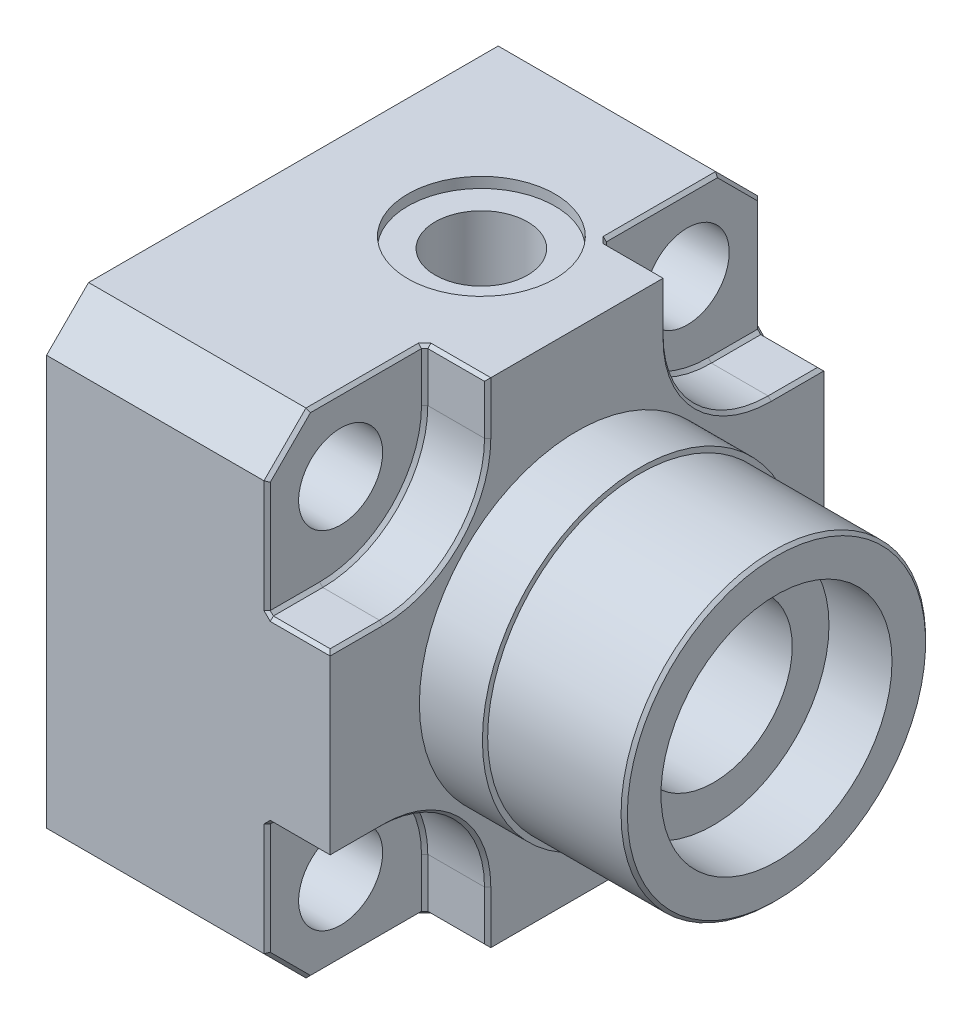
ISO-10303-21;
HEADER;
FILE_DESCRIPTION(('STEP AP214'),'2;1');
FILE_NAME('part.step','',(''),(''),'','','');
FILE_SCHEMA(('AUTOMOTIVE_DESIGN { 1 0 10303 214 1 1 1 1 }'));
ENDSEC;
DATA;
#1=APPLICATION_CONTEXT('core data for automotive mechanical design processes');
#2=APPLICATION_PROTOCOL_DEFINITION('international standard','automotive_design',2000,#1);
#3=PRODUCT_CONTEXT('',#1,'mechanical');
#4=PRODUCT('Part','Part','',(#3));
#5=PRODUCT_RELATED_PRODUCT_CATEGORY('part','',(#4));
#6=PRODUCT_DEFINITION_FORMATION('','',#4);
#7=PRODUCT_DEFINITION_CONTEXT('part definition',#1,'design');
#8=PRODUCT_DEFINITION('design','',#6,#7);
#9=PRODUCT_DEFINITION_SHAPE('','',#8);
#10=(LENGTH_UNIT() NAMED_UNIT(*) SI_UNIT(.MILLI.,.METRE.));
#11=(NAMED_UNIT(*) PLANE_ANGLE_UNIT() SI_UNIT($,.RADIAN.));
#12=(NAMED_UNIT(*) SI_UNIT($,.STERADIAN.) SOLID_ANGLE_UNIT());
#13=UNCERTAINTY_MEASURE_WITH_UNIT(LENGTH_MEASURE(1.E-05),#10,'distance_accuracy_value','');
#14=(GEOMETRIC_REPRESENTATION_CONTEXT(3) GLOBAL_UNCERTAINTY_ASSIGNED_CONTEXT((#13)) GLOBAL_UNIT_ASSIGNED_CONTEXT((#10,
#11,#12)) REPRESENTATION_CONTEXT('',''));
#15=CARTESIAN_POINT('',(0.,0.,0.));
#16=DIRECTION('',(0.,0.,1.));
#17=DIRECTION('',(1.,0.,0.));
#18=AXIS2_PLACEMENT_3D('',#15,#16,#17);
#19=CARTESIAN_POINT('',(46.,23.5,-23.5));
#20=DIRECTION('',(-1.,0.,0.));
#21=DIRECTION('',(0.,0.,1.));
#22=AXIS2_PLACEMENT_3D('',#19,#20,#21);
#23=CYLINDRICAL_SURFACE('',#22,7.5);
#24=CARTESIAN_POINT('',(14.8965587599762,30.8692276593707,-22.1055525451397));
#25=CARTESIAN_POINT('',(14.7735789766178,30.8692280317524,-22.1055528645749));
#26=CARTESIAN_POINT('',(14.6505922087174,30.8702097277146,-22.1107123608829));
#27=CARTESIAN_POINT('',(14.4054671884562,30.8740630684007,-22.1313137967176));
#28=CARTESIAN_POINT('',(14.2833293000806,30.8769354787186,-22.1467599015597));
#29=CARTESIAN_POINT('',(14.0406508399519,30.8843542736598,-22.1878461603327));
#30=CARTESIAN_POINT('',(13.9201128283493,30.888903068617,-22.2135009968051));
#31=CARTESIAN_POINT('',(13.6816210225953,30.8993176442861,-22.2748206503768));
#32=CARTESIAN_POINT('',(13.5636682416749,30.9051839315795,-22.3104893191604));
#33=CARTESIAN_POINT('',(13.3314191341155,30.9177423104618,-22.3914990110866));
#34=CARTESIAN_POINT('',(13.2171165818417,30.9244328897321,-22.436822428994));
#35=CARTESIAN_POINT('',(12.9926775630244,30.9380746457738,-22.5368829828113));
#36=CARTESIAN_POINT('',(12.8825425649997,30.945025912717,-22.5916233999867));
#37=CARTESIAN_POINT('',(12.6672556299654,30.958528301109,-22.7101210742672));
#38=CARTESIAN_POINT('',(12.5621020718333,30.9650795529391,-22.7738753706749));
#39=CARTESIAN_POINT('',(12.3574556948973,30.977068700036,-22.9099918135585));
#40=CARTESIAN_POINT('',(12.2579627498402,30.9825066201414,-22.9823537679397));
#41=CARTESIAN_POINT('',(12.0645474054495,30.991550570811,-23.1358233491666));
#42=CARTESIAN_POINT('',(11.9706768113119,30.9951413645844,-23.216997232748));
#43=CARTESIAN_POINT('',(11.7901267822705,30.9996301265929,-23.3869877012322));
#44=CARTESIAN_POINT('',(11.7034443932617,31.0005292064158,-23.4758011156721));
#45=CARTESIAN_POINT('',(11.5378957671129,30.9988522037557,-23.6604241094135));
#46=CARTESIAN_POINT('',(11.4590300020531,30.9962759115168,-23.7562341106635));
#47=CARTESIAN_POINT('',(11.3097913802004,30.9869003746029,-23.9539971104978));
#48=CARTESIAN_POINT('',(11.2394142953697,30.9801032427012,-24.0559470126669));
#49=CARTESIAN_POINT('',(11.1108691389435,30.9620598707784,-24.2600269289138));
#50=CARTESIAN_POINT('',(11.0522747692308,30.9510451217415,-24.3619089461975));
#51=CARTESIAN_POINT('',(10.9436726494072,30.9240939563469,-24.569473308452));
#52=CARTESIAN_POINT('',(10.8936610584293,30.908159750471,-24.675153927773));
#53=CARTESIAN_POINT('',(10.8024914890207,30.8709942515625,-24.8893356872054));
#54=CARTESIAN_POINT('',(10.7613314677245,30.8497641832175,-24.9978361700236));
#55=CARTESIAN_POINT('',(10.6879974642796,30.8017616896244,-25.2166295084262));
#56=CARTESIAN_POINT('',(10.6558231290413,30.7749894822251,-25.3269222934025));
#57=CARTESIAN_POINT('',(10.6022241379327,30.717703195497,-25.5411408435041));
#58=CARTESIAN_POINT('',(10.5802426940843,30.6875388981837,-25.6450216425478));
#59=CARTESIAN_POINT('',(10.5439980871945,30.6222910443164,-25.8526185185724));
#60=CARTESIAN_POINT('',(10.5297374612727,30.5872058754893,-25.9563345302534));
#61=CARTESIAN_POINT('',(10.5087057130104,30.5122564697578,-26.1627632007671));
#62=CARTESIAN_POINT('',(10.5019327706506,30.4723933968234,-26.2654760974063));
#63=CARTESIAN_POINT('',(10.4955259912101,30.388088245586,-26.46924697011));
#64=CARTESIAN_POINT('',(10.4958948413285,30.3436444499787,-26.5703043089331));
#65=CARTESIAN_POINT('',(10.5074452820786,30.1999442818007,-26.8783612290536));
#66=CARTESIAN_POINT('',(10.5298955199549,30.0934165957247,-27.0816678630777));
#67=CARTESIAN_POINT('',(10.5998945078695,29.8644608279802,-27.4743504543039));
#68=CARTESIAN_POINT('',(10.647454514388,29.7420256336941,-27.6637201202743));
#69=CARTESIAN_POINT('',(10.7490987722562,29.5159816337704,-27.9817546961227));
#70=CARTESIAN_POINT('',(10.7986969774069,29.4151548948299,-28.1138898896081));
#71=CARTESIAN_POINT('',(10.9081007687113,29.2072317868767,-28.3687325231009));
#72=CARTESIAN_POINT('',(10.9679104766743,29.1001328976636,-28.4914361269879));
#73=CARTESIAN_POINT('',(11.0964159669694,28.8804624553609,-28.7274936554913));
#74=CARTESIAN_POINT('',(11.1651333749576,28.7678780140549,-28.8408236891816));
#75=CARTESIAN_POINT('',(11.310076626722,28.5383884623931,-29.0578400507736));
#76=CARTESIAN_POINT('',(11.3863023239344,28.4214834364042,-29.1615265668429));
#77=CARTESIAN_POINT('',(11.5757281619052,28.1385424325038,-29.3974276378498));
#78=CARTESIAN_POINT('',(11.6918900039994,27.9708720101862,-29.5253159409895));
#79=CARTESIAN_POINT('',(11.9344240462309,27.6304812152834,-29.7635702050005));
#80=CARTESIAN_POINT('',(12.0608014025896,27.4577583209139,-29.8739272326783));
#81=CARTESIAN_POINT('',(12.3220637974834,27.1091751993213,-30.0775791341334));
#82=CARTESIAN_POINT('',(12.456938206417,26.9333190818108,-30.1708947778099));
#83=CARTESIAN_POINT('',(12.7344994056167,26.5800397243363,-30.3411797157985));
#84=CARTESIAN_POINT('',(12.8771821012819,26.4026173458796,-30.4181574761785));
#85=CARTESIAN_POINT('',(13.1215035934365,26.1080796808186,-30.5330535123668));
#86=CARTESIAN_POINT('',(13.2208158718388,25.990741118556,-30.5754032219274));
#87=CARTESIAN_POINT('',(13.4238707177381,25.7575917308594,-30.6532065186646));
#88=CARTESIAN_POINT('',(13.5276134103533,25.6417809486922,-30.6886599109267));
#89=CARTESIAN_POINT('',(13.7255359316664,25.4307056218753,-30.7479315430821));
#90=CARTESIAN_POINT('',(13.8188714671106,25.3349286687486,-30.7726945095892));
#91=CARTESIAN_POINT('',(13.9641374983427,25.1958861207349,-30.8059056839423));
#92=CARTESIAN_POINT('',(14.0134143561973,25.1503276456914,-30.8163169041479));
#93=CARTESIAN_POINT('',(14.1143175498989,25.0615998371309,-30.8357656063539));
#94=CARTESIAN_POINT('',(14.1659425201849,25.0184291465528,-30.8448038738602));
#95=CARTESIAN_POINT('',(14.2658321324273,24.9409557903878,-30.8603675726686));
#96=CARTESIAN_POINT('',(14.3137264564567,24.9062159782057,-30.8670654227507));
#97=CARTESIAN_POINT('',(14.4127776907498,24.8412958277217,-30.8791604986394));
#98=CARTESIAN_POINT('',(14.4639349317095,24.811115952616,-30.8845575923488));
#99=CARTESIAN_POINT('',(14.5603823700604,24.7630997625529,-30.8929062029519));
#100=CARTESIAN_POINT('',(14.6050087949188,24.7440129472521,-30.8961253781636));
#101=CARTESIAN_POINT('',(14.6967736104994,24.7131413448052,-30.9012525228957));
#102=CARTESIAN_POINT('',(14.7439037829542,24.7013340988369,-30.9031645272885));
#103=CARTESIAN_POINT('',(14.8320904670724,24.6883141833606,-30.9052648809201));
#104=CARTESIAN_POINT('',(14.872931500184,24.6857234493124,-30.9056776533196));
#105=CARTESIAN_POINT('',(14.954422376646,24.6876999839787,-30.9053608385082));
#106=CARTESIAN_POINT('',(14.9950722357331,24.6922666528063,-30.9046313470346));
#107=CARTESIAN_POINT('',(15.0860060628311,24.7099289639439,-30.9017679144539));
#108=CARTESIAN_POINT('',(15.1358803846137,24.7250175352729,-30.8993041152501));
#109=CARTESIAN_POINT('',(15.2326596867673,24.7626911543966,-30.8929676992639));
#110=CARTESIAN_POINT('',(15.2795522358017,24.7853054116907,-30.8890895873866));
#111=CARTESIAN_POINT('',(15.3864738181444,24.8442460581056,-30.8786297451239));
#112=CARTESIAN_POINT('',(15.4453108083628,24.8825964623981,-30.8715768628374));
#113=CARTESIAN_POINT('',(15.55912029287,24.9644212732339,-30.8557613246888));
#114=CARTESIAN_POINT('',(15.6140830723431,25.0079078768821,-30.846994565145));
#115=CARTESIAN_POINT('',(15.7215051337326,25.0982561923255,-30.827873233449));
#116=CARTESIAN_POINT('',(15.7739442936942,25.1451393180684,-30.8175080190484));
#117=CARTESIAN_POINT('',(15.8765994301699,25.2408163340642,-30.7953392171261));
#118=CARTESIAN_POINT('',(15.926817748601,25.2896081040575,-30.7835371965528));
#119=CARTESIAN_POINT('',(16.0626267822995,25.4254965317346,-30.7491652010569));
#120=CARTESIAN_POINT('',(16.1465345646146,25.5139075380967,-30.7251517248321));
#121=CARTESIAN_POINT('',(16.3109215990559,25.6926796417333,-30.6729253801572));
#122=CARTESIAN_POINT('',(16.391399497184,25.7830414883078,-30.6447108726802));
#123=CARTESIAN_POINT('',(16.5497667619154,25.9648525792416,-30.584045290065));
#124=CARTESIAN_POINT('',(16.6276522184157,26.0563032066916,-30.551588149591));
#125=CARTESIAN_POINT('',(16.7810939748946,26.239560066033,-30.482435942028));
#126=CARTESIAN_POINT('',(16.8566500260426,26.3313663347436,-30.4457404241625));
#127=CARTESIAN_POINT('',(17.0797249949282,26.6062227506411,-30.329412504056));
#128=CARTESIAN_POINT('',(17.224067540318,26.789196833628,-30.2433785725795));
#129=CARTESIAN_POINT('',(17.5040107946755,27.1524404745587,-30.0537516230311));
#130=CARTESIAN_POINT('',(17.6396190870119,27.3327122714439,-29.9501741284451));
#131=CARTESIAN_POINT('',(17.874502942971,27.6528215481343,-29.7475845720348));
#132=CARTESIAN_POINT('',(17.9755723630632,27.7934499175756,-29.6519008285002));
#133=CARTESIAN_POINT('',(18.1705061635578,28.0710622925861,-29.4485298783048));
#134=CARTESIAN_POINT('',(18.2643692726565,28.2080456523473,-29.3408405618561));
#135=CARTESIAN_POINT('',(18.4434443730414,28.4770946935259,-29.1133314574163));
#136=CARTESIAN_POINT('',(18.5286707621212,28.6091683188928,-28.9935325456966));
#137=CARTESIAN_POINT('',(18.6890341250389,28.8674269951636,-28.7415012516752));
#138=CARTESIAN_POINT('',(18.7641706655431,28.9936117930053,-28.6092683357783));
#139=CARTESIAN_POINT('',(18.9336780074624,29.2941521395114,-28.269658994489));
#140=CARTESIAN_POINT('',(19.0214552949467,29.4645864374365,-28.0552758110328));
#141=CARTESIAN_POINT('',(19.1286147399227,29.7047890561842,-27.7154368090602));
#142=CARTESIAN_POINT('',(19.160247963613,29.7822739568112,-27.5991271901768));
#143=CARTESIAN_POINT('',(19.2143702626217,29.9314907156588,-27.3607841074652));
#144=CARTESIAN_POINT('',(19.2368608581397,30.0032235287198,-27.2387515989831));
#145=CARTESIAN_POINT('',(19.2687306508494,30.1287050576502,-27.0105941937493));
#146=CARTESIAN_POINT('',(19.2796763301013,30.1834521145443,-26.9052344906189));
#147=CARTESIAN_POINT('',(19.2939252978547,30.2880567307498,-26.6916169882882));
#148=CARTESIAN_POINT('',(19.297230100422,30.3379152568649,-26.5833597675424));
#149=CARTESIAN_POINT('',(19.2956613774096,30.4323761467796,-26.3646713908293));
#150=CARTESIAN_POINT('',(19.2907909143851,30.4769804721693,-26.2542410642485));
#151=CARTESIAN_POINT('',(19.2724221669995,30.5606698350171,-26.0320027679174));
#152=CARTESIAN_POINT('',(19.2589237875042,30.5997548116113,-25.9201947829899));
#153=CARTESIAN_POINT('',(19.222875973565,30.6723908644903,-25.6956321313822));
#154=CARTESIAN_POINT('',(19.2002838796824,30.7059147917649,-25.5828754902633));
#155=CARTESIAN_POINT('',(19.1458557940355,30.7671438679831,-25.3580093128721));
#156=CARTESIAN_POINT('',(19.1140197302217,30.7948489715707,-25.2458997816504));
#157=CARTESIAN_POINT('',(19.0410790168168,30.8445297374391,-25.0234412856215));
#158=CARTESIAN_POINT('',(18.9999744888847,30.866505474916,-24.9130922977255));
#159=CARTESIAN_POINT('',(18.9086381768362,30.904970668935,-24.6952582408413));
#160=CARTESIAN_POINT('',(18.8584068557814,30.9214604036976,-24.5877730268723));
#161=CARTESIAN_POINT('',(18.7534034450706,30.9482483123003,-24.3849995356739));
#162=CARTESIAN_POINT('',(18.6992970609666,30.9589308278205,-24.2894160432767));
#163=CARTESIAN_POINT('',(18.5838859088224,30.9763688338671,-24.1022822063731));
#164=CARTESIAN_POINT('',(18.522578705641,30.9831229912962,-24.0107332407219));
#165=CARTESIAN_POINT('',(18.3931866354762,30.993162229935,-23.8324043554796));
#166=CARTESIAN_POINT('',(18.3251041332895,30.9964485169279,-23.7456227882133));
#167=CARTESIAN_POINT('',(18.1825771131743,31.0000736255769,-23.5773689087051));
#168=CARTESIAN_POINT('',(18.1081302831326,31.0004113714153,-23.4958985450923));
#169=CARTESIAN_POINT('',(17.8704073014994,30.9977493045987,-23.254660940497));
#170=CARTESIAN_POINT('',(17.6973274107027,30.990791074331,-23.1044043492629));
#171=CARTESIAN_POINT('',(17.3300618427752,30.9714987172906,-22.8326354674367));
#172=CARTESIAN_POINT('',(17.1358612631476,30.9591607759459,-22.7111436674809));
#173=CARTESIAN_POINT('',(16.82525916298,30.9396662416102,-22.5489017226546));
#174=CARTESIAN_POINT('',(16.7146058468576,30.9327640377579,-22.4968555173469));
#175=CARTESIAN_POINT('',(16.489344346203,30.9193673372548,-22.4021462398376));
#176=CARTESIAN_POINT('',(16.3747374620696,30.9128727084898,-22.3594801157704));
#177=CARTESIAN_POINT('',(16.1424902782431,30.9008449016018,-22.2838759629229));
#178=CARTESIAN_POINT('',(16.0248543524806,30.8953104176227,-22.2509246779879));
#179=CARTESIAN_POINT('',(15.7872382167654,30.8856325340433,-22.194916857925));
#180=CARTESIAN_POINT('',(15.6672589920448,30.8814885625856,-22.1718562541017));
#181=CARTESIAN_POINT('',(15.4390038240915,30.875268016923,-22.1377645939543));
#182=CARTESIAN_POINT('',(15.3308870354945,30.8730145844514,-22.1256918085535));
#183=CARTESIAN_POINT('',(15.1140349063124,30.8699942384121,-22.1095856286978));
#184=CARTESIAN_POINT('',(15.0052995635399,30.8692273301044,-22.1055522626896));
#185=CARTESIAN_POINT('',(14.8965587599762,30.8692276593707,-22.1055525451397));
#186=B_SPLINE_CURVE_WITH_KNOTS('',3,(#24,#25,#26,#27,#28,#29,#30,#31,#32,#33,#34,#35,#36,#37,
#38,#39,#40,#41,#42,#43,#44,#45,#46,#47,#48,#49,#50,#51,#52,#53,#54,#55,#56,#57,#58,#59,#60,#61,
#62,#63,#64,#65,#66,#67,#68,#69,#70,#71,#72,#73,#74,#75,#76,#77,#78,#79,#80,#81,#82,#83,#84,#85,
#86,#87,#88,#89,#90,#91,#92,#93,#94,#95,#96,#97,#98,#99,#100,#101,#102,#103,#104,#105,#106,#107,
#108,#109,#110,#111,#112,#113,#114,#115,#116,#117,#118,#119,#120,#121,#122,#123,#124,#125,#126,
#127,#128,#129,#130,#131,#132,#133,#134,#135,#136,#137,#138,#139,#140,#141,#142,#143,#144,#145,
#146,#147,#148,#149,#150,#151,#152,#153,#154,#155,#156,#157,#158,#159,#160,#161,#162,#163,#164,
#165,#166,#167,#168,#169,#170,#171,#172,#173,#174,#175,#176,#177,#178,#179,#180,#181,#182,#183,
#184,#185),.UNSPECIFIED.,.T.,.F.,(4,2,2,2,2,2,2,2,2,2,2,2,2,2,2,2,2,2,2,2,2,2,2,2,2,2,2,2,2,2,2,
2,2,2,2,2,2,2,2,2,2,2,2,2,2,2,2,2,2,2,2,2,2,2,2,2,2,2,2,2,2,2,2,2,2,2,2,2,2,2,2,2,2,2,2,2,2,2,2,
2,4),(0.,0.3688397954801,0.737829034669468,1.1073508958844,1.47701508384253,1.84601088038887,
2.21513551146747,2.58413918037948,2.95313461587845,3.32512692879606,3.69696560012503,
4.06882671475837,4.44050184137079,4.79417104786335,5.14768156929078,5.50111041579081,
5.85452537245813,6.18529007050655,6.51616339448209,6.84695627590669,7.17787362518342,
7.86687935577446,8.55619422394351,9.0758699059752,9.59575584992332,10.1169284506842,
10.6380908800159,11.3592962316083,12.080867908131,12.8015541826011,13.5218660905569,
14.0000355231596,14.4782184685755,14.8859202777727,15.0895964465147,15.2931556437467,
15.4716203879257,15.6501032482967,15.7955897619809,15.9406251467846,16.0627686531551,
16.1849019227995,16.340476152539,16.4966613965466,16.7078702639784,16.9195911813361,
17.1327879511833,17.3457542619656,17.7182554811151,18.0909024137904,18.4640880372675,
18.8373133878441,19.5817886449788,20.3256085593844,20.9186956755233,21.5118871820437,
22.1040729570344,22.6962841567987,23.5554033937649,23.9848665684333,24.4142583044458,
24.7716248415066,25.1289205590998,25.4860824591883,25.8432482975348,26.2021095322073,
26.5609735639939,26.9198328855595,27.2786740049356,27.6093542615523,27.9401466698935,
28.2708240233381,28.6016220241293,29.2864182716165,29.9717008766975,30.3387692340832,
30.7057179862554,31.0721636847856,31.4384584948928,31.7645917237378,32.0907261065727),.UNSPECIFIED.);
#187=CARTESIAN_POINT('',(14.8965587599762,30.8692276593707,-22.1055525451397));
#188=VERTEX_POINT('',#187);
#189=EDGE_CURVE('E622',#188,#188,#186,.T.);
#190=ORIENTED_EDGE('',*,*,#189,.F.);
#191=EDGE_LOOP('',(#190));
#192=FACE_BOUND('',#191,.T.);
#193=CARTESIAN_POINT('',(-6.99999999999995,23.5,-23.5));
#194=DIRECTION('',(-1.,0.,0.));
#195=DIRECTION('',(0.,0.,1.));
#196=AXIS2_PLACEMENT_3D('',#193,#194,#195);
#197=CIRCLE('',#196,7.5);
#198=CARTESIAN_POINT('',(-6.99999999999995,23.5,-16.));
#199=VERTEX_POINT('',#198);
#200=EDGE_CURVE('E615',#199,#199,#197,.T.);
#201=ORIENTED_EDGE('',*,*,#200,.T.);
#202=EDGE_LOOP('',(#201));
#203=FACE_BOUND('',#202,.T.);
#204=CARTESIAN_POINT('',(40.,23.5,-23.5));
#205=DIRECTION('',(1.,0.,0.));
#206=DIRECTION('',(0.,0.,-1.));
#207=AXIS2_PLACEMENT_3D('',#204,#205,#206);
#208=CIRCLE('',#207,7.5);
#209=CARTESIAN_POINT('',(40.,23.5,-31.));
#210=VERTEX_POINT('',#209);
#211=EDGE_CURVE('E44',#210,#210,#208,.F.);
#212=ORIENTED_EDGE('',*,*,#211,.F.);
#213=EDGE_LOOP('',(#212));
#214=FACE_BOUND('',#213,.T.);
#215=ADVANCED_FACE('F40',(#192,#203,#214),#23,.F.);
#216=CARTESIAN_POINT('',(27.,47.,0.));
#217=DIRECTION('',(0.,-1.,0.));
#218=DIRECTION('',(0.,0.,-1.));
#219=AXIS2_PLACEMENT_3D('',#216,#217,#218);
#220=PLANE('',#219);
#221=CARTESIAN_POINT('',(14.8965587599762,47.,-26.5055525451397));
#222=DIRECTION('',(0.,1.,0.));
#223=DIRECTION('',(0.,0.,1.));
#224=AXIS2_PLACEMENT_3D('',#221,#222,#223);
#225=CIRCLE('',#224,7.);
#226=CARTESIAN_POINT('',(14.8965587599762,47.,-19.5055525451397));
#227=VERTEX_POINT('',#226);
#228=EDGE_CURVE('E668',#227,#227,#225,.T.);
#229=ORIENTED_EDGE('',*,*,#228,.F.);
#230=EDGE_LOOP('',(#229));
#231=FACE_BOUND('',#230,.T.);
#232=DIRECTION('',(0.,0.,1.));
#233=VECTOR('',#232,1.);
#234=CARTESIAN_POINT('',(27.,47.,0.));
#235=LINE('',#234,#233);
#236=CARTESIAN_POINT('',(27.,47.,-31.6999999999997));
#237=VERTEX_POINT('',#236);
#238=CARTESIAN_POINT('',(27.,47.,-15.3));
#239=VERTEX_POINT('',#238);
#240=EDGE_CURVE('E695',#237,#239,#235,.T.);
#241=ORIENTED_EDGE('',*,*,#240,.F.);
#242=DIRECTION('',(-1.,0.,0.));
#243=VECTOR('',#242,1.);
#244=CARTESIAN_POINT('',(27.,47.,-31.6999999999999));
#245=LINE('',#244,#243);
#246=CARTESIAN_POINT('',(21.3,47.,-31.6999999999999));
#247=VERTEX_POINT('',#246);
#248=EDGE_CURVE('E398',#237,#247,#245,.T.);
#249=ORIENTED_EDGE('',*,*,#248,.T.);
#250=DIRECTION('',(0.707106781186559,0.,0.707106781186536));
#251=VECTOR('',#250,1.);
#252=CARTESIAN_POINT('',(21.3,47.,-31.6999999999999));
#253=LINE('',#252,#251);
#254=CARTESIAN_POINT('',(21.,47.0000000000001,-31.9999999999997));
#255=VERTEX_POINT('',#254);
#256=EDGE_CURVE('E391',#255,#247,#253,.T.);
#257=ORIENTED_EDGE('',*,*,#256,.F.);
#258=DIRECTION('',(0.707106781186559,0.,0.707106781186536));
#259=VECTOR('',#258,1.);
#260=CARTESIAN_POINT('',(21.3,47.,-31.6999999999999));
#261=LINE('',#260,#259);
#262=CARTESIAN_POINT('',(20.7000000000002,47.,-32.2999999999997));
#263=VERTEX_POINT('',#262);
#264=EDGE_CURVE('E395',#263,#255,#261,.T.);
#265=ORIENTED_EDGE('',*,*,#264,.F.);
#266=DIRECTION('',(0.,0.,-1.));
#267=VECTOR('',#266,1.);
#268=CARTESIAN_POINT('',(20.7000000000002,47.,-42.9999999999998));
#269=LINE('',#268,#267);
#270=CARTESIAN_POINT('',(20.7000000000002,47.,-43.));
#271=VERTEX_POINT('',#270);
#272=EDGE_CURVE('E408',#263,#271,#269,.T.);
#273=ORIENTED_EDGE('',*,*,#272,.T.);
#274=DIRECTION('',(-1.,0.,0.));
#275=VECTOR('',#274,1.);
#276=CARTESIAN_POINT('',(27.0000000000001,47.,-43.));
#277=LINE('',#276,#275);
#278=CARTESIAN_POINT('',(0.,47.,-43.));
#279=VERTEX_POINT('',#278);
#280=EDGE_CURVE('E734',#271,#279,#277,.T.);
#281=ORIENTED_EDGE('',*,*,#280,.T.);
#282=DIRECTION('',(0.,0.,1.));
#283=VECTOR('',#282,1.);
#284=CARTESIAN_POINT('',(0.,47.,0.));
#285=LINE('',#284,#283);
#286=CARTESIAN_POINT('',(0.,47.,-3.99999999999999));
#287=VERTEX_POINT('',#286);
#288=EDGE_CURVE('E689',#279,#287,#285,.T.);
#289=ORIENTED_EDGE('',*,*,#288,.T.);
#290=DIRECTION('',(1.,0.,0.));
#291=VECTOR('',#290,1.);
#292=CARTESIAN_POINT('',(27.,47.,-3.99999999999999));
#293=LINE('',#292,#291);
#294=CARTESIAN_POINT('',(20.7,47.,-3.99999999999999));
#295=VERTEX_POINT('',#294);
#296=EDGE_CURVE('E730',#287,#295,#293,.T.);
#297=ORIENTED_EDGE('',*,*,#296,.T.);
#298=DIRECTION('',(0.,0.,-1.));
#299=VECTOR('',#298,1.);
#300=CARTESIAN_POINT('',(20.7,47.,-15.));
#301=LINE('',#300,#299);
#302=CARTESIAN_POINT('',(20.7,47.,-14.7));
#303=VERTEX_POINT('',#302);
#304=EDGE_CURVE('E782',#295,#303,#301,.T.);
#305=ORIENTED_EDGE('',*,*,#304,.T.);
#306=DIRECTION('',(-0.707106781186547,0.,0.707106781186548));
#307=VECTOR('',#306,1.);
#308=CARTESIAN_POINT('',(20.7,47.,-14.7));
#309=LINE('',#308,#307);
#310=CARTESIAN_POINT('',(21.,47.,-15.));
#311=VERTEX_POINT('',#310);
#312=EDGE_CURVE('E776',#311,#303,#309,.T.);
#313=ORIENTED_EDGE('',*,*,#312,.F.);
#314=DIRECTION('',(-0.707106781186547,0.,0.707106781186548));
#315=VECTOR('',#314,1.);
#316=CARTESIAN_POINT('',(20.7,47.,-14.7));
#317=LINE('',#316,#315);
#318=CARTESIAN_POINT('',(21.3,47.,-15.3));
#319=VERTEX_POINT('',#318);
#320=EDGE_CURVE('E779',#319,#311,#317,.T.);
#321=ORIENTED_EDGE('',*,*,#320,.F.);
#322=DIRECTION('',(1.,0.,0.));
#323=VECTOR('',#322,1.);
#324=CARTESIAN_POINT('',(27.,47.,-15.3));
#325=LINE('',#324,#323);
#326=EDGE_CURVE('E784',#319,#239,#325,.T.);
#327=ORIENTED_EDGE('',*,*,#326,.T.);
#328=EDGE_LOOP('',(#241,#249,#257,#265,#273,#281,#289,#297,#305,#313,#321,#327));
#329=FACE_BOUND('',#328,.T.);
#330=ADVANCED_FACE('F394',(#231,#329),#220,.F.);
#331=CARTESIAN_POINT('',(27.,0.,-47.));
#332=DIRECTION('',(0.,0.,1.));
#333=DIRECTION('',(1.,0.,0.));
#334=AXIS2_PLACEMENT_3D('',#331,#332,#333);
#335=PLANE('',#334);
#336=DIRECTION('',(-0.707106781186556,0.707106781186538,0.));
#337=VECTOR('',#336,1.);
#338=CARTESIAN_POINT('',(20.7000000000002,32.3000000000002,-47.));
#339=LINE('',#338,#337);
#340=CARTESIAN_POINT('',(21.3,31.7000000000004,-47.));
#341=VERTEX_POINT('',#340);
#342=CARTESIAN_POINT('',(21.,32.0000000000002,-46.9999999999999));
#343=VERTEX_POINT('',#342);
#344=EDGE_CURVE('E960',#341,#343,#339,.T.);
#345=ORIENTED_EDGE('',*,*,#344,.F.);
#346=DIRECTION('',(1.,0.,0.));
#347=VECTOR('',#346,1.);
#348=CARTESIAN_POINT('',(27.,31.7000000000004,-47.));
#349=LINE('',#348,#347);
#350=CARTESIAN_POINT('',(27.,31.7000000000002,-47.));
#351=VERTEX_POINT('',#350);
#352=EDGE_CURVE('E965',#341,#351,#349,.T.);
#353=ORIENTED_EDGE('',*,*,#352,.T.);
#354=DIRECTION('',(0.,1.,0.));
#355=VECTOR('',#354,1.);
#356=CARTESIAN_POINT('',(27.,0.,-47.));
#357=LINE('',#356,#355);
#358=CARTESIAN_POINT('',(27.,15.3000000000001,-47.));
#359=VERTEX_POINT('',#358);
#360=EDGE_CURVE('E692',#359,#351,#357,.T.);
#361=ORIENTED_EDGE('',*,*,#360,.F.);
#362=DIRECTION('',(-1.,0.,0.));
#363=VECTOR('',#362,1.);
#364=CARTESIAN_POINT('',(27.,15.3000000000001,-47.));
#365=LINE('',#364,#363);
#366=CARTESIAN_POINT('',(21.3,15.3000000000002,-47.));
#367=VERTEX_POINT('',#366);
#368=EDGE_CURVE('E955',#359,#367,#365,.T.);
#369=ORIENTED_EDGE('',*,*,#368,.T.);
#370=DIRECTION('',(0.707106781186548,0.707106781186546,0.));
#371=VECTOR('',#370,1.);
#372=CARTESIAN_POINT('',(21.3,15.3000000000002,-47.));
#373=LINE('',#372,#371);
#374=CARTESIAN_POINT('',(21.,15.0000000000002,-47.0000000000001));
#375=VERTEX_POINT('',#374);
#376=EDGE_CURVE('E952',#375,#367,#373,.T.);
#377=ORIENTED_EDGE('',*,*,#376,.F.);
#378=DIRECTION('',(0.707106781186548,0.707106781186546,0.));
#379=VECTOR('',#378,1.);
#380=CARTESIAN_POINT('',(21.3,15.3000000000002,-47.));
#381=LINE('',#380,#379);
#382=CARTESIAN_POINT('',(20.7,14.7000000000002,-47.));
#383=VERTEX_POINT('',#382);
#384=EDGE_CURVE('E949',#383,#375,#381,.T.);
#385=ORIENTED_EDGE('',*,*,#384,.F.);
#386=DIRECTION('',(0.,-1.,0.));
#387=VECTOR('',#386,1.);
#388=CARTESIAN_POINT('',(20.7,4.00000000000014,-47.));
#389=LINE('',#388,#387);
#390=CARTESIAN_POINT('',(20.7,4.,-47.));
#391=VERTEX_POINT('',#390);
#392=EDGE_CURVE('E908',#383,#391,#389,.T.);
#393=ORIENTED_EDGE('',*,*,#392,.T.);
#394=DIRECTION('',(-1.,0.,0.));
#395=VECTOR('',#394,1.);
#396=CARTESIAN_POINT('',(27.,3.99999999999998,-47.));
#397=LINE('',#396,#395);
#398=CARTESIAN_POINT('',(0.,3.99999999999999,-47.));
#399=VERTEX_POINT('',#398);
#400=EDGE_CURVE('E710',#391,#399,#397,.T.);
#401=ORIENTED_EDGE('',*,*,#400,.T.);
#402=DIRECTION('',(0.,1.,0.));
#403=VECTOR('',#402,1.);
#404=CARTESIAN_POINT('',(0.,0.,-47.));
#405=LINE('',#404,#403);
#406=CARTESIAN_POINT('',(0.,43.,-47.));
#407=VERTEX_POINT('',#406);
#408=EDGE_CURVE('E703',#399,#407,#405,.T.);
#409=ORIENTED_EDGE('',*,*,#408,.T.);
#410=DIRECTION('',(1.,0.,0.));
#411=VECTOR('',#410,1.);
#412=CARTESIAN_POINT('',(27.0000000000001,43.,-47.));
#413=LINE('',#412,#411);
#414=CARTESIAN_POINT('',(20.7000000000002,43.,-47.));
#415=VERTEX_POINT('',#414);
#416=EDGE_CURVE('E697',#407,#415,#413,.T.);
#417=ORIENTED_EDGE('',*,*,#416,.T.);
#418=DIRECTION('',(0.,-1.,0.));
#419=VECTOR('',#418,1.);
#420=CARTESIAN_POINT('',(20.7000000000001,32.0000000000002,-47.));
#421=LINE('',#420,#419);
#422=CARTESIAN_POINT('',(20.7000000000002,32.3000000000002,-47.));
#423=VERTEX_POINT('',#422);
#424=EDGE_CURVE('E963',#415,#423,#421,.T.);
#425=ORIENTED_EDGE('',*,*,#424,.T.);
#426=DIRECTION('',(-0.707106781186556,0.707106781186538,0.));
#427=VECTOR('',#426,1.);
#428=CARTESIAN_POINT('',(20.7000000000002,32.3000000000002,-47.));
#429=LINE('',#428,#427);
#430=EDGE_CURVE('E957',#343,#423,#429,.T.);
#431=ORIENTED_EDGE('',*,*,#430,.F.);
#432=EDGE_LOOP('',(#345,#353,#361,#369,#377,#385,#393,#401,#409,#417,#425,#431));
#433=FACE_BOUND('',#432,.T.);
#434=ADVANCED_FACE('F1130',(#433),#335,.F.);
#435=CARTESIAN_POINT('',(27.,0.,0.));
#436=DIRECTION('',(0.,1.,0.));
#437=DIRECTION('',(0.,0.,1.));
#438=AXIS2_PLACEMENT_3D('',#435,#436,#437);
#439=PLANE('',#438);
#440=DIRECTION('',(-0.707106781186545,0.,-0.70710678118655));
#441=VECTOR('',#440,1.);
#442=CARTESIAN_POINT('',(20.7,0.,-32.3000000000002));
#443=LINE('',#442,#441);
#444=CARTESIAN_POINT('',(21.3,0.,-31.7000000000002));
#445=VERTEX_POINT('',#444);
#446=CARTESIAN_POINT('',(21.,0.,-32.0000000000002));
#447=VERTEX_POINT('',#446);
#448=EDGE_CURVE('E467',#445,#447,#443,.T.);
#449=ORIENTED_EDGE('',*,*,#448,.F.);
#450=DIRECTION('',(1.,0.,0.));
#451=VECTOR('',#450,1.);
#452=CARTESIAN_POINT('',(27.,0.,-31.7000000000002));
#453=LINE('',#452,#451);
#454=CARTESIAN_POINT('',(27.,0.,-31.7000000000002));
#455=VERTEX_POINT('',#454);
#456=EDGE_CURVE('E472',#445,#455,#453,.T.);
#457=ORIENTED_EDGE('',*,*,#456,.T.);
#458=DIRECTION('',(0.,0.,-1.));
#459=VECTOR('',#458,1.);
#460=CARTESIAN_POINT('',(27.,0.,0.));
#461=LINE('',#460,#459);
#462=CARTESIAN_POINT('',(27.,0.,-15.3000000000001));
#463=VERTEX_POINT('',#462);
#464=EDGE_CURVE('E688',#463,#455,#461,.T.);
#465=ORIENTED_EDGE('',*,*,#464,.F.);
#466=DIRECTION('',(-1.,0.,0.));
#467=VECTOR('',#466,1.);
#468=CARTESIAN_POINT('',(27.,0.,-15.3000000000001));
#469=LINE('',#468,#467);
#470=CARTESIAN_POINT('',(21.3,0.,-15.3000000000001));
#471=VERTEX_POINT('',#470);
#472=EDGE_CURVE('E904',#463,#471,#469,.T.);
#473=ORIENTED_EDGE('',*,*,#472,.T.);
#474=DIRECTION('',(0.707106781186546,0.,-0.707106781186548));
#475=VECTOR('',#474,1.);
#476=CARTESIAN_POINT('',(21.3,0.,-15.3000000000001));
#477=LINE('',#476,#475);
#478=CARTESIAN_POINT('',(21.,0.,-15.0000000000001));
#479=VERTEX_POINT('',#478);
#480=EDGE_CURVE('E901',#479,#471,#477,.T.);
#481=ORIENTED_EDGE('',*,*,#480,.F.);
#482=DIRECTION('',(0.707106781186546,0.,-0.707106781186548));
#483=VECTOR('',#482,1.);
#484=CARTESIAN_POINT('',(21.3,0.,-15.3000000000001));
#485=LINE('',#484,#483);
#486=CARTESIAN_POINT('',(20.6999999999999,0.,-14.7000000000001));
#487=VERTEX_POINT('',#486);
#488=EDGE_CURVE('E898',#487,#479,#485,.T.);
#489=ORIENTED_EDGE('',*,*,#488,.F.);
#490=DIRECTION('',(0.,0.,1.));
#491=VECTOR('',#490,1.);
#492=CARTESIAN_POINT('',(20.6999999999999,0.,-4.00000000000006));
#493=LINE('',#492,#491);
#494=CARTESIAN_POINT('',(20.6999999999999,0.,-4.));
#495=VERTEX_POINT('',#494);
#496=EDGE_CURVE('E896',#487,#495,#493,.T.);
#497=ORIENTED_EDGE('',*,*,#496,.T.);
#498=DIRECTION('',(-1.,0.,0.));
#499=VECTOR('',#498,1.);
#500=CARTESIAN_POINT('',(27.,0.,-4.));
#501=LINE('',#500,#499);
#502=CARTESIAN_POINT('',(0.,0.,-4.));
#503=VERTEX_POINT('',#502);
#504=EDGE_CURVE('E720',#495,#503,#501,.T.);
#505=ORIENTED_EDGE('',*,*,#504,.T.);
#506=DIRECTION('',(0.,0.,-1.));
#507=VECTOR('',#506,1.);
#508=CARTESIAN_POINT('',(0.,0.,0.));
#509=LINE('',#508,#507);
#510=CARTESIAN_POINT('',(0.,0.,-43.));
#511=VERTEX_POINT('',#510);
#512=EDGE_CURVE('E700',#503,#511,#509,.T.);
#513=ORIENTED_EDGE('',*,*,#512,.T.);
#514=DIRECTION('',(1.,0.,0.));
#515=VECTOR('',#514,1.);
#516=CARTESIAN_POINT('',(27.,0.,-43.));
#517=LINE('',#516,#515);
#518=CARTESIAN_POINT('',(20.7,0.,-43.));
#519=VERTEX_POINT('',#518);
#520=EDGE_CURVE('E722',#511,#519,#517,.T.);
#521=ORIENTED_EDGE('',*,*,#520,.T.);
#522=DIRECTION('',(0.,0.,1.));
#523=VECTOR('',#522,1.);
#524=CARTESIAN_POINT('',(20.7,0.,-32.0000000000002));
#525=LINE('',#524,#523);
#526=CARTESIAN_POINT('',(20.7,0.,-32.3000000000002));
#527=VERTEX_POINT('',#526);
#528=EDGE_CURVE('E470',#519,#527,#525,.T.);
#529=ORIENTED_EDGE('',*,*,#528,.T.);
#530=DIRECTION('',(-0.707106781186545,0.,-0.70710678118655));
#531=VECTOR('',#530,1.);
#532=CARTESIAN_POINT('',(20.7,0.,-32.3000000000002));
#533=LINE('',#532,#531);
#534=EDGE_CURVE('E464',#447,#527,#533,.T.);
#535=ORIENTED_EDGE('',*,*,#534,.F.);
#536=EDGE_LOOP('',(#449,#457,#465,#473,#481,#489,#497,#505,#513,#521,#529,#535));
#537=FACE_BOUND('',#536,.T.);
#538=ADVANCED_FACE('F1212',(#537),#439,.F.);
#539=CARTESIAN_POINT('',(27.0000000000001,47.,-43.));
#540=DIRECTION('',(0.,-0.707106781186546,0.707106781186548));
#541=DIRECTION('',(0.,-0.707106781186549,-0.707106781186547));
#542=AXIS2_PLACEMENT_3D('',#539,#540,#541);
#543=PLANE('',#542);
#544=ORIENTED_EDGE('',*,*,#280,.F.);
#545=DIRECTION('',(0.,0.707106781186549,0.707106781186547));
#546=VECTOR('',#545,1.);
#547=CARTESIAN_POINT('',(20.7000000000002,47.,-43.));
#548=LINE('',#547,#546);
#549=EDGE_CURVE('E428',#271,#415,#548,.F.);
#550=ORIENTED_EDGE('',*,*,#549,.T.);
#551=ORIENTED_EDGE('',*,*,#416,.F.);
#552=DIRECTION('',(0.,0.707106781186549,0.707106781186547));
#553=VECTOR('',#552,1.);
#554=CARTESIAN_POINT('',(0.,68.4999999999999,-21.5));
#555=LINE('',#554,#553);
#556=EDGE_CURVE('E714',#279,#407,#555,.F.);
#557=ORIENTED_EDGE('',*,*,#556,.F.);
#558=EDGE_LOOP('',(#544,#550,#551,#557));
#559=FACE_BOUND('',#558,.T.);
#560=ADVANCED_FACE('F1136',(#559),#543,.F.);
#561=CARTESIAN_POINT('',(27.,3.99999999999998,-47.));
#562=DIRECTION('',(0.,0.707106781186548,0.707106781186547));
#563=DIRECTION('',(0.,-0.707106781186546,0.707106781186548));
#564=AXIS2_PLACEMENT_3D('',#561,#562,#563);
#565=PLANE('',#564);
#566=ORIENTED_EDGE('',*,*,#400,.F.);
#567=DIRECTION('',(0.,0.707106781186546,-0.707106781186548));
#568=VECTOR('',#567,1.);
#569=CARTESIAN_POINT('',(20.7,4.,-47.));
#570=LINE('',#569,#568);
#571=EDGE_CURVE('E11',#391,#519,#570,.F.);
#572=ORIENTED_EDGE('',*,*,#571,.T.);
#573=ORIENTED_EDGE('',*,*,#520,.F.);
#574=DIRECTION('',(0.,0.707106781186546,-0.707106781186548));
#575=VECTOR('',#574,1.);
#576=CARTESIAN_POINT('',(0.,1.99999999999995,-45.));
#577=LINE('',#576,#575);
#578=EDGE_CURVE('E718',#399,#511,#577,.F.);
#579=ORIENTED_EDGE('',*,*,#578,.F.);
#580=EDGE_LOOP('',(#566,#572,#573,#579));
#581=FACE_BOUND('',#580,.T.);
#582=ADVANCED_FACE('F1218',(#581),#565,.F.);
#583=CARTESIAN_POINT('',(27.,0.,-4.));
#584=DIRECTION('',(0.,0.707106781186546,-0.707106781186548));
#585=DIRECTION('',(0.,0.707106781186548,0.707106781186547));
#586=AXIS2_PLACEMENT_3D('',#583,#584,#585);
#587=PLANE('',#586);
#588=ORIENTED_EDGE('',*,*,#504,.F.);
#589=DIRECTION('',(0.,-0.707106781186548,-0.707106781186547));
#590=VECTOR('',#589,1.);
#591=CARTESIAN_POINT('',(20.6999999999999,0.,-4.));
#592=LINE('',#591,#590);
#593=CARTESIAN_POINT('',(20.6999999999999,4.00000000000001,0.));
#594=VERTEX_POINT('',#593);
#595=EDGE_CURVE('E906',#495,#594,#592,.F.);
#596=ORIENTED_EDGE('',*,*,#595,.T.);
#597=DIRECTION('',(1.,0.,0.));
#598=VECTOR('',#597,1.);
#599=CARTESIAN_POINT('',(27.,4.00000000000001,0.));
#600=LINE('',#599,#598);
#601=CARTESIAN_POINT('',(0.,4.00000000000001,0.));
#602=VERTEX_POINT('',#601);
#603=EDGE_CURVE('E727',#602,#594,#600,.T.);
#604=ORIENTED_EDGE('',*,*,#603,.F.);
#605=DIRECTION('',(0.,-0.707106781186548,-0.707106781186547));
#606=VECTOR('',#605,1.);
#607=CARTESIAN_POINT('',(0.,25.5,21.5));
#608=LINE('',#607,#606);
#609=EDGE_CURVE('E716',#503,#602,#608,.F.);
#610=ORIENTED_EDGE('',*,*,#609,.F.);
#611=EDGE_LOOP('',(#588,#596,#604,#610));
#612=FACE_BOUND('',#611,.T.);
#613=ADVANCED_FACE('F1265',(#612),#587,.F.);
#614=CARTESIAN_POINT('',(27.,0.,0.));
#615=DIRECTION('',(0.,0.,-1.));
#616=DIRECTION('',(-1.,0.,0.));
#617=AXIS2_PLACEMENT_3D('',#614,#615,#616);
#618=PLANE('',#617);
#619=DIRECTION('',(-0.707106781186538,-0.707106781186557,0.));
#620=VECTOR('',#619,1.);
#621=CARTESIAN_POINT('',(20.7,14.6999999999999,0.));
#622=LINE('',#621,#620);
#623=CARTESIAN_POINT('',(21.3,15.3,0.));
#624=VERTEX_POINT('',#623);
#625=CARTESIAN_POINT('',(21.,14.9999999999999,0.));
#626=VERTEX_POINT('',#625);
#627=EDGE_CURVE('E889',#624,#626,#622,.T.);
#628=ORIENTED_EDGE('',*,*,#627,.F.);
#629=DIRECTION('',(1.,0.,0.));
#630=VECTOR('',#629,1.);
#631=CARTESIAN_POINT('',(27.0000000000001,15.3,0.));
#632=LINE('',#631,#630);
#633=CARTESIAN_POINT('',(27.0000000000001,15.3,0.));
#634=VERTEX_POINT('',#633);
#635=EDGE_CURVE('E894',#624,#634,#632,.T.);
#636=ORIENTED_EDGE('',*,*,#635,.T.);
#637=DIRECTION('',(0.,-1.,0.));
#638=VECTOR('',#637,1.);
#639=CARTESIAN_POINT('',(27.,0.,0.));
#640=LINE('',#639,#638);
#641=CARTESIAN_POINT('',(27.,31.7,0.));
#642=VERTEX_POINT('',#641);
#643=EDGE_CURVE('E685',#642,#634,#640,.T.);
#644=ORIENTED_EDGE('',*,*,#643,.F.);
#645=DIRECTION('',(-1.,0.,0.));
#646=VECTOR('',#645,1.);
#647=CARTESIAN_POINT('',(27.,31.7,0.));
#648=LINE('',#647,#646);
#649=CARTESIAN_POINT('',(21.3,31.7,0.));
#650=VERTEX_POINT('',#649);
#651=EDGE_CURVE('E808',#642,#650,#648,.T.);
#652=ORIENTED_EDGE('',*,*,#651,.T.);
#653=DIRECTION('',(0.707106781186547,-0.707106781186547,0.));
#654=VECTOR('',#653,1.);
#655=CARTESIAN_POINT('',(21.3,31.7,0.));
#656=LINE('',#655,#654);
#657=CARTESIAN_POINT('',(21.,32.,0.));
#658=VERTEX_POINT('',#657);
#659=EDGE_CURVE('E805',#658,#650,#656,.T.);
#660=ORIENTED_EDGE('',*,*,#659,.F.);
#661=DIRECTION('',(0.707106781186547,-0.707106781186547,0.));
#662=VECTOR('',#661,1.);
#663=CARTESIAN_POINT('',(21.3,31.7,0.));
#664=LINE('',#663,#662);
#665=CARTESIAN_POINT('',(20.7,32.3,0.));
#666=VERTEX_POINT('',#665);
#667=EDGE_CURVE('E802',#666,#658,#664,.T.);
#668=ORIENTED_EDGE('',*,*,#667,.F.);
#669=DIRECTION('',(0.,1.,0.));
#670=VECTOR('',#669,1.);
#671=CARTESIAN_POINT('',(20.7,43.,0.));
#672=LINE('',#671,#670);
#673=CARTESIAN_POINT('',(20.7,43.,0.));
#674=VERTEX_POINT('',#673);
#675=EDGE_CURVE('E800',#666,#674,#672,.T.);
#676=ORIENTED_EDGE('',*,*,#675,.T.);
#677=DIRECTION('',(-1.,0.,0.));
#678=VECTOR('',#677,1.);
#679=CARTESIAN_POINT('',(27.,43.,0.));
#680=LINE('',#679,#678);
#681=CARTESIAN_POINT('',(0.,43.,0.));
#682=VERTEX_POINT('',#681);
#683=EDGE_CURVE('E725',#674,#682,#680,.T.);
#684=ORIENTED_EDGE('',*,*,#683,.T.);
#685=DIRECTION('',(0.,-1.,0.));
#686=VECTOR('',#685,1.);
#687=CARTESIAN_POINT('',(0.,0.,0.));
#688=LINE('',#687,#686);
#689=EDGE_CURVE('E684',#682,#602,#688,.T.);
#690=ORIENTED_EDGE('',*,*,#689,.T.);
#691=ORIENTED_EDGE('',*,*,#603,.T.);
#692=DIRECTION('',(0.,1.,0.));
#693=VECTOR('',#692,1.);
#694=CARTESIAN_POINT('',(20.7,14.9999999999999,0.));
#695=LINE('',#694,#693);
#696=CARTESIAN_POINT('',(20.7,14.6999999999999,0.));
#697=VERTEX_POINT('',#696);
#698=EDGE_CURVE('E892',#594,#697,#695,.T.);
#699=ORIENTED_EDGE('',*,*,#698,.T.);
#700=DIRECTION('',(-0.707106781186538,-0.707106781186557,0.));
#701=VECTOR('',#700,1.);
#702=CARTESIAN_POINT('',(20.7,14.6999999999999,0.));
#703=LINE('',#702,#701);
#704=EDGE_CURVE('E886',#626,#697,#703,.T.);
#705=ORIENTED_EDGE('',*,*,#704,.F.);
#706=EDGE_LOOP('',(#628,#636,#644,#652,#660,#668,#676,#684,#690,#691,#699,#705));
#707=FACE_BOUND('',#706,.T.);
#708=ADVANCED_FACE('F1262',(#707),#618,.F.);
#709=CARTESIAN_POINT('',(27.,43.,0.));
#710=DIRECTION('',(0.,-0.707106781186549,-0.707106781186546));
#711=DIRECTION('',(0.,0.707106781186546,-0.707106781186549));
#712=AXIS2_PLACEMENT_3D('',#709,#710,#711);
#713=PLANE('',#712);
#714=ORIENTED_EDGE('',*,*,#683,.F.);
#715=DIRECTION('',(0.,-0.707106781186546,0.707106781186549));
#716=VECTOR('',#715,1.);
#717=CARTESIAN_POINT('',(20.7,43.,0.));
#718=LINE('',#717,#716);
#719=EDGE_CURVE('E810',#674,#295,#718,.F.);
#720=ORIENTED_EDGE('',*,*,#719,.T.);
#721=ORIENTED_EDGE('',*,*,#296,.F.);
#722=DIRECTION('',(0.,-0.707106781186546,0.707106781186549));
#723=VECTOR('',#722,1.);
#724=CARTESIAN_POINT('',(0.,45.,-1.99999999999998));
#725=LINE('',#724,#723);
#726=EDGE_CURVE('E712',#682,#287,#725,.F.);
#727=ORIENTED_EDGE('',*,*,#726,.F.);
#728=EDGE_LOOP('',(#714,#720,#721,#727));
#729=FACE_BOUND('',#728,.T.);
#730=ADVANCED_FACE('F1144',(#729),#713,.F.);
#731=CARTESIAN_POINT('',(33.0000000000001,23.5,-23.5));
#732=DIRECTION('',(1.,0.,0.));
#733=DIRECTION('',(0.,0.,-1.));
#734=AXIS2_PLACEMENT_3D('',#731,#732,#733);
#735=PLANE('',#734);
#736=CARTESIAN_POINT('',(33.0000000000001,23.5,-23.5));
#737=DIRECTION('',(1.,0.,0.));
#738=DIRECTION('',(0.,0.,-1.));
#739=AXIS2_PLACEMENT_3D('',#736,#737,#738);
#740=CIRCLE('',#739,15.);
#741=CARTESIAN_POINT('',(33.0000000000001,23.5,-8.49999999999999));
#742=VERTEX_POINT('',#741);
#743=EDGE_CURVE('E677',#742,#742,#740,.T.);
#744=ORIENTED_EDGE('',*,*,#743,.T.);
#745=EDGE_LOOP('',(#744));
#746=FACE_BOUND('',#745,.T.);
#747=CARTESIAN_POINT('',(33.0000000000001,23.5,-23.5));
#748=DIRECTION('',(1.,0.,0.));
#749=DIRECTION('',(0.,0.,-1.));
#750=AXIS2_PLACEMENT_3D('',#747,#748,#749);
#751=CIRCLE('',#750,14.5);
#752=CARTESIAN_POINT('',(33.0000000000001,23.5,-8.99999999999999));
#753=VERTEX_POINT('',#752);
#754=EDGE_CURVE('E629',#753,#753,#751,.T.);
#755=ORIENTED_EDGE('',*,*,#754,.F.);
#756=EDGE_LOOP('',(#755));
#757=FACE_BOUND('',#756,.T.);
#758=ADVANCED_FACE('F1233',(#746,#757),#735,.T.);
#759=CARTESIAN_POINT('',(-6.99999999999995,23.5,-23.5));
#760=DIRECTION('',(1.,0.,0.));
#761=DIRECTION('',(0.,0.,-1.));
#762=AXIS2_PLACEMENT_3D('',#759,#760,#761);
#763=CYLINDRICAL_SURFACE('',#762,16.5);
#764=CARTESIAN_POINT('',(0.,23.5,-23.5));
#765=DIRECTION('',(-1.,0.,0.));
#766=DIRECTION('',(0.,0.,1.));
#767=AXIS2_PLACEMENT_3D('',#764,#765,#766);
#768=CIRCLE('',#767,16.5);
#769=CARTESIAN_POINT('',(0.,23.5,-40.));
#770=VERTEX_POINT('',#769);
#771=EDGE_CURVE('E678',#770,#770,#768,.T.);
#772=CARTESIAN_POINT('',(-2.39222561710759,23.5,-23.5));
#773=DIRECTION('',(-1.,0.,0.));
#774=DIRECTION('',(0.,0.,1.));
#775=AXIS2_PLACEMENT_3D('',#772,#773,#774);
#776=CIRCLE('',#775,16.5);
#777=CARTESIAN_POINT('',(-2.39222561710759,23.5,-40.));
#778=VERTEX_POINT('',#777);
#779=EDGE_CURVE('E681',#778,#778,#776,.T.);
#780=CARTESIAN_POINT('',(0.,23.5,-40.));
#781=CARTESIAN_POINT('',(-0.0249190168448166,23.5,-40.));
#782=CARTESIAN_POINT('',(-0.0498380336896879,23.5,-40.));
#783=CARTESIAN_POINT('',(-0.0996760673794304,23.5,-40.));
#784=CARTESIAN_POINT('',(-0.124595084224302,23.5,-40.));
#785=CARTESIAN_POINT('',(-0.174433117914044,23.5,-40.));
#786=CARTESIAN_POINT('',(-0.199352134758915,23.5,-40.));
#787=CARTESIAN_POINT('',(-0.249190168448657,23.5,-40.));
#788=CARTESIAN_POINT('',(-0.274109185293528,23.5,-40.));
#789=CARTESIAN_POINT('',(-0.323947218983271,23.5,-40.));
#790=CARTESIAN_POINT('',(-0.348866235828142,23.5,-40.));
#791=CARTESIAN_POINT('',(-0.398704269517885,23.5,-40.));
#792=CARTESIAN_POINT('',(-0.423623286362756,23.5,-40.));
#793=CARTESIAN_POINT('',(-0.473461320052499,23.5,-40.));
#794=CARTESIAN_POINT('',(-0.49838033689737,23.5,-40.));
#795=CARTESIAN_POINT('',(-0.548218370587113,23.5,-40.));
#796=CARTESIAN_POINT('',(-0.573137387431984,23.5,-40.));
#797=CARTESIAN_POINT('',(-0.622975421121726,23.5,-40.));
#798=CARTESIAN_POINT('',(-0.647894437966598,23.5,-40.));
#799=CARTESIAN_POINT('',(-0.697732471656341,23.5,-40.));
#800=CARTESIAN_POINT('',(-0.722651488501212,23.5,-40.));
#801=CARTESIAN_POINT('',(-0.772489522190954,23.5,-40.));
#802=CARTESIAN_POINT('',(-0.797408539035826,23.5,-40.));
#803=CARTESIAN_POINT('',(-0.847246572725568,23.5,-40.));
#804=CARTESIAN_POINT('',(-0.872165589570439,23.5,-40.));
#805=CARTESIAN_POINT('',(-0.922003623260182,23.5,-40.));
#806=CARTESIAN_POINT('',(-0.946922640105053,23.5,-40.));
#807=CARTESIAN_POINT('',(-0.996760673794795,23.5,-40.));
#808=CARTESIAN_POINT('',(-1.02167969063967,23.5,-40.));
#809=CARTESIAN_POINT('',(-1.07151772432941,23.5,-40.));
#810=CARTESIAN_POINT('',(-1.09643674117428,23.5,-40.));
#811=CARTESIAN_POINT('',(-1.14627477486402,23.5,-40.));
#812=CARTESIAN_POINT('',(-1.17119379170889,23.5,-40.));
#813=CARTESIAN_POINT('',(-1.22103182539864,23.5,-40.));
#814=CARTESIAN_POINT('',(-1.24595084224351,23.5,-40.));
#815=CARTESIAN_POINT('',(-1.29578887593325,23.5,-40.));
#816=CARTESIAN_POINT('',(-1.32070789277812,23.5,-40.));
#817=CARTESIAN_POINT('',(-1.37054592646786,23.5,-40.));
#818=CARTESIAN_POINT('',(-1.39546494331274,23.5,-40.));
#819=CARTESIAN_POINT('',(-1.44530297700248,23.5,-40.));
#820=CARTESIAN_POINT('',(-1.47022199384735,23.5,-40.));
#821=CARTESIAN_POINT('',(-1.52006002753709,23.5,-40.));
#822=CARTESIAN_POINT('',(-1.54497904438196,23.5,-40.));
#823=CARTESIAN_POINT('',(-1.59481707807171,23.5,-40.));
#824=CARTESIAN_POINT('',(-1.61973609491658,23.5,-40.));
#825=CARTESIAN_POINT('',(-1.66957412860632,23.5,-40.));
#826=CARTESIAN_POINT('',(-1.69449314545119,23.5,-40.));
#827=CARTESIAN_POINT('',(-1.74433117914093,23.5,-40.));
#828=CARTESIAN_POINT('',(-1.76925019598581,23.5,-40.));
#829=CARTESIAN_POINT('',(-1.81908822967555,23.5,-40.));
#830=CARTESIAN_POINT('',(-1.84400724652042,23.5,-40.));
#831=CARTESIAN_POINT('',(-1.89384528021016,23.5,-40.));
#832=CARTESIAN_POINT('',(-1.91876429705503,23.5,-40.));
#833=CARTESIAN_POINT('',(-1.96860233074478,23.5,-40.));
#834=CARTESIAN_POINT('',(-1.99352134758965,23.5,-40.));
#835=CARTESIAN_POINT('',(-2.04335938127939,23.5,-40.));
#836=CARTESIAN_POINT('',(-2.06827839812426,23.5,-40.));
#837=CARTESIAN_POINT('',(-2.118116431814,23.5,-40.));
#838=CARTESIAN_POINT('',(-2.14303544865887,23.5,-40.));
#839=CARTESIAN_POINT('',(-2.19287348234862,23.5,-40.));
#840=CARTESIAN_POINT('',(-2.21779249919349,23.5,-40.));
#841=CARTESIAN_POINT('',(-2.26763053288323,23.5,-40.));
#842=CARTESIAN_POINT('',(-2.2925495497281,23.5,-40.));
#843=CARTESIAN_POINT('',(-2.34238758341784,23.5,-40.));
#844=CARTESIAN_POINT('',(-2.36730660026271,23.5,-40.));
#845=CARTESIAN_POINT('',(-2.39222561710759,23.5,-40.));
#846=B_SPLINE_CURVE_WITH_KNOTS('',3,(#780,#781,#782,#783,#784,#785,#786,#787,#788,#789,#790,
#791,#792,#793,#794,#795,#796,#797,#798,#799,#800,#801,#802,#803,#804,#805,#806,#807,#808,#809,
#810,#811,#812,#813,#814,#815,#816,#817,#818,#819,#820,#821,#822,#823,#824,#825,#826,#827,#828,
#829,#830,#831,#832,#833,#834,#835,#836,#837,#838,#839,#840,#841,#842,#843,#844,#845),
.UNSPECIFIED.,.F.,.F.,(4,2,2,2,2,2,2,2,2,2,2,2,2,2,2,2,2,2,2,2,2,2,2,2,2,2,2,2,2,2,2,2,4),(0.,
0.0747570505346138,0.149514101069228,0.22427115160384,0.299028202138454,0.373785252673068,
0.448542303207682,0.523299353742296,0.598056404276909,0.672813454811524,0.747570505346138,
0.822327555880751,0.897084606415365,0.971841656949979,1.04659870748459,1.12135575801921,
1.19611280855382,1.27086985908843,1.34562690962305,1.42038396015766,1.49514101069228,
1.56989806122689,1.6446551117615,1.71941216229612,1.79416921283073,1.86892626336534,
1.94368331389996,2.01844036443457,2.09319741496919,2.1679544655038,2.24271151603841,
2.31746856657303,2.39222561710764),.UNSPECIFIED.);
#847=EDGE_CURVE('BSEAM1226',#770,#778,#846,.T.);
#848=ORIENTED_EDGE('',*,*,#771,.T.);
#849=ORIENTED_EDGE('',*,*,#779,.F.);
#850=ORIENTED_EDGE('',*,*,#847,.T.);
#851=ORIENTED_EDGE('',*,*,#847,.F.);
#852=EDGE_LOOP('',(#848,#850,#849,#851));
#853=FACE_BOUND('',#852,.T.);
#854=ADVANCED_FACE('F1226',(#853),#763,.T.);
#855=CARTESIAN_POINT('',(0.,47.,0.));
#856=DIRECTION('',(-1.,0.,0.));
#857=DIRECTION('',(0.,0.,1.));
#858=AXIS2_PLACEMENT_3D('',#855,#856,#857);
#859=PLANE('',#858);
#860=CARTESIAN_POINT('',(0.,40.0000000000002,-39.9999999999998));
#861=DIRECTION('',(-1.,0.,0.));
#862=DIRECTION('',(0.,0.,1.));
#863=AXIS2_PLACEMENT_3D('',#860,#861,#862);
#864=CIRCLE('',#863,4.);
#865=CARTESIAN_POINT('',(0.,44.0000000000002,-39.9999999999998));
#866=VERTEX_POINT('',#865);
#867=EDGE_CURVE('E1491',#866,#866,#864,.T.);
#868=ORIENTED_EDGE('',*,*,#867,.F.);
#869=EDGE_LOOP('',(#868));
#870=FACE_BOUND('',#869,.T.);
#871=CARTESIAN_POINT('',(0.,7.00000000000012,-40.0000000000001));
#872=DIRECTION('',(-1.,0.,0.));
#873=DIRECTION('',(0.,0.,1.));
#874=AXIS2_PLACEMENT_3D('',#871,#872,#873);
#875=CIRCLE('',#874,4.);
#876=CARTESIAN_POINT('',(0.,7.00000000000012,-44.0000000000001));
#877=VERTEX_POINT('',#876);
#878=EDGE_CURVE('E1497',#877,#877,#875,.T.);
#879=ORIENTED_EDGE('',*,*,#878,.F.);
#880=EDGE_LOOP('',(#879));
#881=FACE_BOUND('',#880,.T.);
#882=CARTESIAN_POINT('',(0.,6.99999999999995,-7.00000000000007));
#883=DIRECTION('',(-1.,0.,0.));
#884=DIRECTION('',(0.,0.,1.));
#885=AXIS2_PLACEMENT_3D('',#882,#883,#884);
#886=CIRCLE('',#885,4.);
#887=CARTESIAN_POINT('',(0.,6.99999999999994,-11.0000000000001));
#888=VERTEX_POINT('',#887);
#889=EDGE_CURVE('E993',#888,#888,#886,.T.);
#890=ORIENTED_EDGE('',*,*,#889,.F.);
#891=EDGE_LOOP('',(#890));
#892=FACE_BOUND('',#891,.T.);
#893=CARTESIAN_POINT('',(0.,40.,-6.99999999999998));
#894=DIRECTION('',(-1.,0.,0.));
#895=DIRECTION('',(0.,0.,1.));
#896=AXIS2_PLACEMENT_3D('',#893,#894,#895);
#897=CIRCLE('',#896,4.);
#898=CARTESIAN_POINT('',(0.,40.,-11.));
#899=VERTEX_POINT('',#898);
#900=EDGE_CURVE('E608',#899,#899,#897,.T.);
#901=ORIENTED_EDGE('',*,*,#900,.F.);
#902=EDGE_LOOP('',(#901));
#903=FACE_BOUND('',#902,.T.);
#904=ORIENTED_EDGE('',*,*,#408,.F.);
#905=ORIENTED_EDGE('',*,*,#578,.T.);
#906=ORIENTED_EDGE('',*,*,#512,.F.);
#907=ORIENTED_EDGE('',*,*,#609,.T.);
#908=ORIENTED_EDGE('',*,*,#689,.F.);
#909=ORIENTED_EDGE('',*,*,#726,.T.);
#910=ORIENTED_EDGE('',*,*,#288,.F.);
#911=ORIENTED_EDGE('',*,*,#556,.T.);
#912=EDGE_LOOP('',(#904,#905,#906,#907,#908,#909,#910,#911));
#913=FACE_BOUND('',#912,.T.);
#914=ORIENTED_EDGE('',*,*,#771,.F.);
#915=EDGE_LOOP('',(#914));
#916=FACE_BOUND('',#915,.T.);
#917=ADVANCED_FACE('F1223',(#870,#881,#892,#903,#913,#916),#859,.T.);
#918=CARTESIAN_POINT('',(27.,47.,0.));
#919=DIRECTION('',(-1.,0.,0.));
#920=DIRECTION('',(0.,0.,1.));
#921=AXIS2_PLACEMENT_3D('',#918,#919,#920);
#922=PLANE('',#921);
#923=CARTESIAN_POINT('',(27.0000000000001,42.0000000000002,-41.9999999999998));
#924=DIRECTION('',(-1.,0.,0.));
#925=DIRECTION('',(0.,0.,1.));
#926=AXIS2_PLACEMENT_3D('',#923,#924,#925);
#927=CIRCLE('',#926,10.3);
#928=CARTESIAN_POINT('',(27.0000000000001,31.7000000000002,-41.9999999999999));
#929=VERTEX_POINT('',#928);
#930=CARTESIAN_POINT('',(27.0000000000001,42.0000000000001,-31.6999999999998));
#931=VERTEX_POINT('',#930);
#932=EDGE_CURVE('E437',#929,#931,#927,.T.);
#933=ORIENTED_EDGE('',*,*,#932,.T.);
#934=DIRECTION('',(0.,1.,0.));
#935=VECTOR('',#934,1.);
#936=CARTESIAN_POINT('',(27.,47.0000000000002,-31.6999999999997));
#937=LINE('',#936,#935);
#938=EDGE_CURVE('E441',#931,#237,#937,.T.);
#939=ORIENTED_EDGE('',*,*,#938,.T.);
#940=ORIENTED_EDGE('',*,*,#240,.T.);
#941=DIRECTION('',(0.,-1.,0.));
#942=VECTOR('',#941,1.);
#943=CARTESIAN_POINT('',(27.,47.,-15.3));
#944=LINE('',#943,#942);
#945=CARTESIAN_POINT('',(27.,42.,-15.3));
#946=VERTEX_POINT('',#945);
#947=EDGE_CURVE('E761',#239,#946,#944,.T.);
#948=ORIENTED_EDGE('',*,*,#947,.T.);
#949=CARTESIAN_POINT('',(27.,42.,-4.99999999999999));
#950=DIRECTION('',(-1.,0.,0.));
#951=DIRECTION('',(0.,0.,1.));
#952=AXIS2_PLACEMENT_3D('',#949,#950,#951);
#953=CIRCLE('',#952,10.3);
#954=CARTESIAN_POINT('',(27.,31.7,-4.99999999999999));
#955=VERTEX_POINT('',#954);
#956=EDGE_CURVE('E759',#946,#955,#953,.T.);
#957=ORIENTED_EDGE('',*,*,#956,.T.);
#958=DIRECTION('',(0.,0.,1.));
#959=VECTOR('',#958,1.);
#960=CARTESIAN_POINT('',(27.,31.7,0.));
#961=LINE('',#960,#959);
#962=EDGE_CURVE('E763',#955,#642,#961,.T.);
#963=ORIENTED_EDGE('',*,*,#962,.T.);
#964=ORIENTED_EDGE('',*,*,#643,.T.);
#965=DIRECTION('',(0.,0.,-1.));
#966=VECTOR('',#965,1.);
#967=CARTESIAN_POINT('',(27.0000000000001,15.2999999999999,-1.15359111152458E-13));
#968=LINE('',#967,#966);
#969=CARTESIAN_POINT('',(27.0000000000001,15.2999999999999,-5.00000000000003));
#970=VERTEX_POINT('',#969);
#971=EDGE_CURVE('E858',#634,#970,#968,.T.);
#972=ORIENTED_EDGE('',*,*,#971,.T.);
#973=CARTESIAN_POINT('',(27.,4.99999999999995,-5.00000000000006));
#974=DIRECTION('',(-1.,0.,0.));
#975=DIRECTION('',(0.,0.,1.));
#976=AXIS2_PLACEMENT_3D('',#973,#974,#975);
#977=CIRCLE('',#976,10.3);
#978=CARTESIAN_POINT('',(27.,4.99999999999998,-15.3000000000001));
#979=VERTEX_POINT('',#978);
#980=EDGE_CURVE('E856',#970,#979,#977,.T.);
#981=ORIENTED_EDGE('',*,*,#980,.T.);
#982=DIRECTION('',(0.,-1.,0.));
#983=VECTOR('',#982,1.);
#984=CARTESIAN_POINT('',(27.,47.,-15.3));
#985=LINE('',#984,#983);
#986=EDGE_CURVE('E860',#979,#463,#985,.T.);
#987=ORIENTED_EDGE('',*,*,#986,.T.);
#988=ORIENTED_EDGE('',*,*,#464,.T.);
#989=DIRECTION('',(0.,1.,0.));
#990=VECTOR('',#989,1.);
#991=CARTESIAN_POINT('',(27.,47.0000000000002,-31.6999999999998));
#992=LINE('',#991,#990);
#993=CARTESIAN_POINT('',(27.,5.00000000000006,-31.7000000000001));
#994=VERTEX_POINT('',#993);
#995=EDGE_CURVE('E430',#455,#994,#992,.T.);
#996=ORIENTED_EDGE('',*,*,#995,.T.);
#997=CARTESIAN_POINT('',(27.,5.00000000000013,-42.0000000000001));
#998=DIRECTION('',(-1.,0.,0.));
#999=DIRECTION('',(0.,0.,1.));
#1000=AXIS2_PLACEMENT_3D('',#997,#998,#999);
#1001=CIRCLE('',#1000,10.3);
#1002=CARTESIAN_POINT('',(27.,15.3000000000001,-42.0000000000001));
#1003=VERTEX_POINT('',#1002);
#1004=EDGE_CURVE('E432',#994,#1003,#1001,.T.);
#1005=ORIENTED_EDGE('',*,*,#1004,.T.);
#1006=DIRECTION('',(0.,0.,-1.));
#1007=VECTOR('',#1006,1.);
#1008=CARTESIAN_POINT('',(27.0000000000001,15.2999999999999,-1.70870262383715E-13));
#1009=LINE('',#1008,#1007);
#1010=EDGE_CURVE('E434',#1003,#359,#1009,.T.);
#1011=ORIENTED_EDGE('',*,*,#1010,.T.);
#1012=ORIENTED_EDGE('',*,*,#360,.T.);
#1013=DIRECTION('',(0.,0.,1.));
#1014=VECTOR('',#1013,1.);
#1015=CARTESIAN_POINT('',(27.,31.6999999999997,-1.53523027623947E-13));
#1016=LINE('',#1015,#1014);
#1017=EDGE_CURVE('E439',#351,#929,#1016,.T.);
#1018=ORIENTED_EDGE('',*,*,#1017,.T.);
#1019=EDGE_LOOP('',(#933,#939,#940,#948,#957,#963,#964,#972,#981,#987,#988,#996,#1005,#1011,
#1012,#1018));
#1020=FACE_BOUND('',#1019,.T.);
#1021=CARTESIAN_POINT('',(27.0000000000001,23.5,-23.5));
#1022=DIRECTION('',(-1.,0.,0.));
#1023=DIRECTION('',(0.,0.,1.));
#1024=AXIS2_PLACEMENT_3D('',#1021,#1022,#1023);
#1025=CIRCLE('',#1024,15.);
#1026=CARTESIAN_POINT('',(27.0000000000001,23.5,-8.49999999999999));
#1027=VERTEX_POINT('',#1026);
#1028=EDGE_CURVE('E736',#1027,#1027,#1025,.F.);
#1029=ORIENTED_EDGE('',*,*,#1028,.F.);
#1030=EDGE_LOOP('',(#1029));
#1031=FACE_BOUND('',#1030,.T.);
#1032=ADVANCED_FACE('F1190',(#1020,#1031),#922,.F.);
#1033=CARTESIAN_POINT('',(33.0000000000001,23.5,-23.5));
#1034=DIRECTION('',(-1.,0.,0.));
#1035=DIRECTION('',(0.,0.,1.));
#1036=AXIS2_PLACEMENT_3D('',#1033,#1034,#1035);
#1037=CYLINDRICAL_SURFACE('',#1036,15.);
#1038=CARTESIAN_POINT('',(33.0000000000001,23.5,-8.49999999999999));
#1039=CARTESIAN_POINT('',(32.9375000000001,23.5,-8.49999999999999));
#1040=CARTESIAN_POINT('',(32.8750000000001,23.5,-8.49999999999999));
#1041=CARTESIAN_POINT('',(32.7500000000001,23.5,-8.49999999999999));
#1042=CARTESIAN_POINT('',(32.6875000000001,23.5,-8.49999999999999));
#1043=CARTESIAN_POINT('',(32.5625000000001,23.5,-8.49999999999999));
#1044=CARTESIAN_POINT('',(32.5000000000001,23.5,-8.49999999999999));
#1045=CARTESIAN_POINT('',(32.3750000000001,23.5,-8.49999999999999));
#1046=CARTESIAN_POINT('',(32.3125000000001,23.5,-8.49999999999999));
#1047=CARTESIAN_POINT('',(32.1875000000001,23.5,-8.49999999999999));
#1048=CARTESIAN_POINT('',(32.1250000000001,23.5,-8.49999999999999));
#1049=CARTESIAN_POINT('',(32.0000000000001,23.5,-8.49999999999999));
#1050=CARTESIAN_POINT('',(31.9375000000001,23.5,-8.49999999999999));
#1051=CARTESIAN_POINT('',(31.8125000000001,23.5,-8.49999999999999));
#1052=CARTESIAN_POINT('',(31.7500000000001,23.5,-8.49999999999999));
#1053=CARTESIAN_POINT('',(31.6250000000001,23.5,-8.49999999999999));
#1054=CARTESIAN_POINT('',(31.5625000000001,23.5,-8.49999999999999));
#1055=CARTESIAN_POINT('',(31.4375000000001,23.5,-8.49999999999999));
#1056=CARTESIAN_POINT('',(31.3750000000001,23.5,-8.49999999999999));
#1057=CARTESIAN_POINT('',(31.2500000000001,23.5,-8.49999999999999));
#1058=CARTESIAN_POINT('',(31.1875000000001,23.5,-8.49999999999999));
#1059=CARTESIAN_POINT('',(31.0625000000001,23.5,-8.49999999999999));
#1060=CARTESIAN_POINT('',(31.0000000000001,23.5,-8.49999999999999));
#1061=CARTESIAN_POINT('',(30.8750000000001,23.5,-8.49999999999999));
#1062=CARTESIAN_POINT('',(30.8125000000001,23.5,-8.49999999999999));
#1063=CARTESIAN_POINT('',(30.6875000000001,23.5,-8.49999999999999));
#1064=CARTESIAN_POINT('',(30.6250000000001,23.5,-8.49999999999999));
#1065=CARTESIAN_POINT('',(30.5000000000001,23.5,-8.49999999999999));
#1066=CARTESIAN_POINT('',(30.4375000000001,23.5,-8.49999999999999));
#1067=CARTESIAN_POINT('',(30.3125000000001,23.5,-8.49999999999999));
#1068=CARTESIAN_POINT('',(30.2500000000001,23.5,-8.49999999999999));
#1069=CARTESIAN_POINT('',(30.1250000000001,23.5,-8.49999999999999));
#1070=CARTESIAN_POINT('',(30.0625000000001,23.5,-8.49999999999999));
#1071=CARTESIAN_POINT('',(29.9375000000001,23.5,-8.49999999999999));
#1072=CARTESIAN_POINT('',(29.8750000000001,23.5,-8.49999999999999));
#1073=CARTESIAN_POINT('',(29.7500000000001,23.5,-8.49999999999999));
#1074=CARTESIAN_POINT('',(29.6875000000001,23.5,-8.49999999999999));
#1075=CARTESIAN_POINT('',(29.5625000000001,23.5,-8.49999999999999));
#1076=CARTESIAN_POINT('',(29.5000000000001,23.5,-8.49999999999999));
#1077=CARTESIAN_POINT('',(29.3750000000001,23.5,-8.49999999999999));
#1078=CARTESIAN_POINT('',(29.3125000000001,23.5,-8.49999999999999));
#1079=CARTESIAN_POINT('',(29.1875000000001,23.5,-8.49999999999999));
#1080=CARTESIAN_POINT('',(29.1250000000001,23.5,-8.49999999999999));
#1081=CARTESIAN_POINT('',(29.0000000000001,23.5,-8.49999999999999));
#1082=CARTESIAN_POINT('',(28.9375000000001,23.5,-8.49999999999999));
#1083=CARTESIAN_POINT('',(28.8125000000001,23.5,-8.49999999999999));
#1084=CARTESIAN_POINT('',(28.7500000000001,23.5,-8.49999999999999));
#1085=CARTESIAN_POINT('',(28.6250000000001,23.5,-8.49999999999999));
#1086=CARTESIAN_POINT('',(28.5625000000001,23.5,-8.49999999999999));
#1087=CARTESIAN_POINT('',(28.4375000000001,23.5,-8.49999999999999));
#1088=CARTESIAN_POINT('',(28.3750000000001,23.5,-8.49999999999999));
#1089=CARTESIAN_POINT('',(28.2500000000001,23.5,-8.49999999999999));
#1090=CARTESIAN_POINT('',(28.1875000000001,23.5,-8.49999999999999));
#1091=CARTESIAN_POINT('',(28.0625000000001,23.5,-8.49999999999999));
#1092=CARTESIAN_POINT('',(28.0000000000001,23.5,-8.49999999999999));
#1093=CARTESIAN_POINT('',(27.8750000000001,23.5,-8.49999999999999));
#1094=CARTESIAN_POINT('',(27.8125000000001,23.5,-8.49999999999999));
#1095=CARTESIAN_POINT('',(27.6875000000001,23.5,-8.49999999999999));
#1096=CARTESIAN_POINT('',(27.6250000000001,23.5,-8.49999999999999));
#1097=CARTESIAN_POINT('',(27.5000000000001,23.5,-8.49999999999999));
#1098=CARTESIAN_POINT('',(27.4375000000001,23.5,-8.49999999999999));
#1099=CARTESIAN_POINT('',(27.3125000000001,23.5,-8.49999999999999));
#1100=CARTESIAN_POINT('',(27.2500000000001,23.5,-8.49999999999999));
#1101=CARTESIAN_POINT('',(27.1250000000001,23.5,-8.49999999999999));
#1102=CARTESIAN_POINT('',(27.0625000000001,23.5,-8.49999999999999));
#1103=CARTESIAN_POINT('',(27.0000000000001,23.5,-8.49999999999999));
#1104=B_SPLINE_CURVE_WITH_KNOTS('',3,(#1038,#1039,#1040,#1041,#1042,#1043,#1044,#1045,#1046,
#1047,#1048,#1049,#1050,#1051,#1052,#1053,#1054,#1055,#1056,#1057,#1058,#1059,#1060,#1061,#1062,
#1063,#1064,#1065,#1066,#1067,#1068,#1069,#1070,#1071,#1072,#1073,#1074,#1075,#1076,#1077,#1078,
#1079,#1080,#1081,#1082,#1083,#1084,#1085,#1086,#1087,#1088,#1089,#1090,#1091,#1092,#1093,#1094,
#1095,#1096,#1097,#1098,#1099,#1100,#1101,#1102,#1103),.UNSPECIFIED.,.F.,.F.,(4,2,2,2,2,2,2,2,2,
2,2,2,2,2,2,2,2,2,2,2,2,2,2,2,2,2,2,2,2,2,2,2,4),(0.,0.1875,0.375,0.5625,0.750000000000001,
0.937500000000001,1.125,1.3125,1.5,1.6875,1.875,2.0625,2.25,2.4375,2.625,2.8125,3.,3.1875,3.375,
3.5625,3.75,3.9375,4.125,4.3125,4.5,4.6875,4.875,5.0625,5.25,5.4375,5.625,5.8125,6.),.UNSPECIFIED.);
#1105=EDGE_CURVE('BSEAM1240',#742,#1027,#1104,.T.);
#1106=ORIENTED_EDGE('',*,*,#743,.F.);
#1107=ORIENTED_EDGE('',*,*,#1028,.T.);
#1108=ORIENTED_EDGE('',*,*,#1105,.T.);
#1109=ORIENTED_EDGE('',*,*,#1105,.F.);
#1110=EDGE_LOOP('',(#1106,#1108,#1107,#1109));
#1111=FACE_BOUND('',#1110,.T.);
#1112=ADVANCED_FACE('F1240',(#1111),#1037,.T.);
#1113=CARTESIAN_POINT('',(-3.39154886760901,23.5,-23.5));
#1114=DIRECTION('',(1.,0.,0.));
#1115=DIRECTION('',(0.,0.,-1.));
#1116=AXIS2_PLACEMENT_3D('',#1113,#1114,#1115);
#1117=TOROIDAL_SURFACE('',#1116,16.4632162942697,1.);
#1118=CARTESIAN_POINT('',(-4.39087211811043,23.5,-23.5));
#1119=DIRECTION('',(1.,0.,0.));
#1120=DIRECTION('',(0.,0.,-1.));
#1121=AXIS2_PLACEMENT_3D('',#1118,#1119,#1120);
#1122=CIRCLE('',#1121,16.5);
#1123=CARTESIAN_POINT('',(-4.39087211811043,23.5,-40.));
#1124=VERTEX_POINT('',#1123);
#1125=EDGE_CURVE('E740',#1124,#1124,#1122,.T.);
#1126=ORIENTED_EDGE('',*,*,#1125,.T.);
#1127=EDGE_LOOP('',(#1126));
#1128=FACE_BOUND('',#1127,.T.);
#1129=ORIENTED_EDGE('',*,*,#779,.T.);
#1130=EDGE_LOOP('',(#1129));
#1131=FACE_BOUND('',#1130,.T.);
#1132=ADVANCED_FACE('F1237',(#1128,#1131),#1117,.F.);
#1133=CARTESIAN_POINT('',(-6.99999999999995,23.5,-23.5));
#1134=DIRECTION('',(-1.,0.,0.));
#1135=DIRECTION('',(0.,0.,1.));
#1136=AXIS2_PLACEMENT_3D('',#1133,#1134,#1135);
#1137=PLANE('',#1136);
#1138=ORIENTED_EDGE('',*,*,#200,.F.);
#1139=EDGE_LOOP('',(#1138));
#1140=FACE_BOUND('',#1139,.T.);
#1141=CARTESIAN_POINT('',(-6.99999999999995,23.5,-23.5));
#1142=DIRECTION('',(-1.,0.,0.));
#1143=DIRECTION('',(0.,0.,1.));
#1144=AXIS2_PLACEMENT_3D('',#1141,#1142,#1143);
#1145=CIRCLE('',#1144,16.5);
#1146=CARTESIAN_POINT('',(-6.99999999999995,23.5,-40.));
#1147=VERTEX_POINT('',#1146);
#1148=EDGE_CURVE('E674',#1147,#1147,#1145,.T.);
#1149=ORIENTED_EDGE('',*,*,#1148,.T.);
#1150=EDGE_LOOP('',(#1149));
#1151=FACE_BOUND('',#1150,.T.);
#1152=ADVANCED_FACE('F1239',(#1140,#1151),#1137,.T.);
#1153=CARTESIAN_POINT('',(-6.99999999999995,23.5,-40.));
#1154=CARTESIAN_POINT('',(-6.9728215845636,23.5,-40.));
#1155=CARTESIAN_POINT('',(-6.94564316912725,23.5,-40.));
#1156=CARTESIAN_POINT('',(-6.89128633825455,23.5,-40.));
#1157=CARTESIAN_POINT('',(-6.8641079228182,23.5,-40.));
#1158=CARTESIAN_POINT('',(-6.80975109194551,23.5,-40.));
#1159=CARTESIAN_POINT('',(-6.78257267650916,23.5,-40.));
#1160=CARTESIAN_POINT('',(-6.72821584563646,23.5,-40.));
#1161=CARTESIAN_POINT('',(-6.70103743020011,23.5,-40.));
#1162=CARTESIAN_POINT('',(-6.64668059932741,23.5,-40.));
#1163=CARTESIAN_POINT('',(-6.61950218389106,23.5,-40.));
#1164=CARTESIAN_POINT('',(-6.56514535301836,23.5,-40.));
#1165=CARTESIAN_POINT('',(-6.53796693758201,23.5,-40.));
#1166=CARTESIAN_POINT('',(-6.48361010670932,23.5,-40.));
#1167=CARTESIAN_POINT('',(-6.45643169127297,23.5,-40.));
#1168=CARTESIAN_POINT('',(-6.40207486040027,23.5,-40.));
#1169=CARTESIAN_POINT('',(-6.37489644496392,23.5,-40.));
#1170=CARTESIAN_POINT('',(-6.32053961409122,23.5,-40.));
#1171=CARTESIAN_POINT('',(-6.29336119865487,23.5,-40.));
#1172=CARTESIAN_POINT('',(-6.23900436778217,23.5,-40.));
#1173=CARTESIAN_POINT('',(-6.21182595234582,23.5,-40.));
#1174=CARTESIAN_POINT('',(-6.15746912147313,23.5,-40.));
#1175=CARTESIAN_POINT('',(-6.13029070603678,23.5,-40.));
#1176=CARTESIAN_POINT('',(-6.07593387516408,23.5,-40.));
#1177=CARTESIAN_POINT('',(-6.04875545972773,23.5,-40.));
#1178=CARTESIAN_POINT('',(-5.99439862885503,23.5,-40.));
#1179=CARTESIAN_POINT('',(-5.96722021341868,23.5,-40.));
#1180=CARTESIAN_POINT('',(-5.91286338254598,23.5,-40.));
#1181=CARTESIAN_POINT('',(-5.88568496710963,23.5,-40.));
#1182=CARTESIAN_POINT('',(-5.83132813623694,23.5,-40.));
#1183=CARTESIAN_POINT('',(-5.80414972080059,23.5,-40.));
#1184=CARTESIAN_POINT('',(-5.74979288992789,23.5,-40.));
#1185=CARTESIAN_POINT('',(-5.72261447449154,23.5,-40.));
#1186=CARTESIAN_POINT('',(-5.66825764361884,23.5,-40.));
#1187=CARTESIAN_POINT('',(-5.64107922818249,23.5,-40.));
#1188=CARTESIAN_POINT('',(-5.58672239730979,23.5,-40.));
#1189=CARTESIAN_POINT('',(-5.55954398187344,23.5,-40.));
#1190=CARTESIAN_POINT('',(-5.50518715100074,23.5,-40.));
#1191=CARTESIAN_POINT('',(-5.4780087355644,23.5,-40.));
#1192=CARTESIAN_POINT('',(-5.4236519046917,23.5,-40.));
#1193=CARTESIAN_POINT('',(-5.39647348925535,23.5,-40.));
#1194=CARTESIAN_POINT('',(-5.34211665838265,23.5,-40.));
#1195=CARTESIAN_POINT('',(-5.3149382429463,23.5,-40.));
#1196=CARTESIAN_POINT('',(-5.2605814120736,23.5,-40.));
#1197=CARTESIAN_POINT('',(-5.23340299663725,23.5,-40.));
#1198=CARTESIAN_POINT('',(-5.17904616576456,23.5,-40.));
#1199=CARTESIAN_POINT('',(-5.15186775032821,23.5,-40.));
#1200=CARTESIAN_POINT('',(-5.09751091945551,23.5,-40.));
#1201=CARTESIAN_POINT('',(-5.07033250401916,23.5,-40.));
#1202=CARTESIAN_POINT('',(-5.01597567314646,23.5,-40.));
#1203=CARTESIAN_POINT('',(-4.98879725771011,23.5,-40.));
#1204=CARTESIAN_POINT('',(-4.93444042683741,23.5,-40.));
#1205=CARTESIAN_POINT('',(-4.90726201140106,23.5,-40.));
#1206=CARTESIAN_POINT('',(-4.85290518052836,23.5,-40.));
#1207=CARTESIAN_POINT('',(-4.82572676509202,23.5,-40.));
#1208=CARTESIAN_POINT('',(-4.77136993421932,23.5,-40.));
#1209=CARTESIAN_POINT('',(-4.74419151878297,23.5,-40.));
#1210=CARTESIAN_POINT('',(-4.68983468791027,23.5,-40.));
#1211=CARTESIAN_POINT('',(-4.66265627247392,23.5,-40.));
#1212=CARTESIAN_POINT('',(-4.60829944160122,23.5,-40.));
#1213=CARTESIAN_POINT('',(-4.58112102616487,23.5,-40.));
#1214=CARTESIAN_POINT('',(-4.52676419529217,23.5,-40.));
#1215=CARTESIAN_POINT('',(-4.49958577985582,23.5,-40.));
#1216=CARTESIAN_POINT('',(-4.44522894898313,23.5,-40.));
#1217=CARTESIAN_POINT('',(-4.41805053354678,23.5,-40.));
#1218=CARTESIAN_POINT('',(-4.39087211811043,23.5,-40.));
#1219=B_SPLINE_CURVE_WITH_KNOTS('',3,(#1153,#1154,#1155,#1156,#1157,#1158,#1159,#1160,#1161,
#1162,#1163,#1164,#1165,#1166,#1167,#1168,#1169,#1170,#1171,#1172,#1173,#1174,#1175,#1176,#1177,
#1178,#1179,#1180,#1181,#1182,#1183,#1184,#1185,#1186,#1187,#1188,#1189,#1190,#1191,#1192,#1193,
#1194,#1195,#1196,#1197,#1198,#1199,#1200,#1201,#1202,#1203,#1204,#1205,#1206,#1207,#1208,#1209,
#1210,#1211,#1212,#1213,#1214,#1215,#1216,#1217,#1218),.UNSPECIFIED.,.F.,.F.,(4,2,2,2,2,2,2,2,2,
2,2,2,2,2,2,2,2,2,2,2,2,2,2,2,2,2,2,2,2,2,2,2,4),(0.,0.0815352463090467,0.163070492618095,
0.244605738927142,0.32614098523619,0.407676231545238,0.489211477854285,0.570746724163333,
0.652281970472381,0.733817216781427,0.815352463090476,0.896887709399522,0.978422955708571,
1.05995820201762,1.14149344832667,1.22302869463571,1.30456394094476,1.38609918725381,
1.46763443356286,1.5491696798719,1.63070492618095,1.71224017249,1.79377541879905,
1.87531066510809,1.95684591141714,2.03838115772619,2.11991640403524,2.20145165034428,
2.28298689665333,2.36452214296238,2.44605738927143,2.52759263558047,2.60912788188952),.UNSPECIFIED.);
#1220=EDGE_CURVE('BSEAM654',#1147,#1124,#1219,.T.);
#1221=ORIENTED_EDGE('',*,*,#1148,.F.);
#1222=ORIENTED_EDGE('',*,*,#1125,.F.);
#1223=ORIENTED_EDGE('',*,*,#1220,.T.);
#1224=ORIENTED_EDGE('',*,*,#1220,.F.);
#1225=EDGE_LOOP('',(#1221,#1223,#1222,#1224));
#1226=FACE_BOUND('',#1225,.T.);
#1227=ADVANCED_FACE('F654',(#1226),#763,.T.);
#1228=CARTESIAN_POINT('',(14.8965587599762,46.,-26.5055525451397));
#1229=DIRECTION('',(0.,1.,0.));
#1230=DIRECTION('',(0.,0.,1.));
#1231=AXIS2_PLACEMENT_3D('',#1228,#1229,#1230);
#1232=PLANE('',#1231);
#1233=CARTESIAN_POINT('',(14.8965587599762,46.,-26.5055525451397));
#1234=DIRECTION('',(0.,1.,0.));
#1235=DIRECTION('',(0.,0.,1.));
#1236=AXIS2_PLACEMENT_3D('',#1233,#1234,#1235);
#1237=CIRCLE('',#1236,7.);
#1238=CARTESIAN_POINT('',(14.8965587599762,46.,-19.5055525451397));
#1239=VERTEX_POINT('',#1238);
#1240=EDGE_CURVE('E665',#1239,#1239,#1237,.T.);
#1241=ORIENTED_EDGE('',*,*,#1240,.T.);
#1242=EDGE_LOOP('',(#1241));
#1243=FACE_BOUND('',#1242,.T.);
#1244=CARTESIAN_POINT('',(14.8965587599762,46.,-26.5055525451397));
#1245=DIRECTION('',(0.,1.,0.));
#1246=DIRECTION('',(0.,0.,1.));
#1247=AXIS2_PLACEMENT_3D('',#1244,#1245,#1246);
#1248=CIRCLE('',#1247,4.39999999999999);
#1249=CARTESIAN_POINT('',(14.8965587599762,46.,-22.1055525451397));
#1250=VERTEX_POINT('',#1249);
#1251=EDGE_CURVE('E671',#1250,#1250,#1248,.F.);
#1252=ORIENTED_EDGE('',*,*,#1251,.T.);
#1253=EDGE_LOOP('',(#1252));
#1254=FACE_BOUND('',#1253,.T.);
#1255=ADVANCED_FACE('F651',(#1243,#1254),#1232,.T.);
#1256=CARTESIAN_POINT('',(14.8965587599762,46.,-26.5055525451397));
#1257=DIRECTION('',(0.,1.,0.));
#1258=DIRECTION('',(0.,0.,1.));
#1259=AXIS2_PLACEMENT_3D('',#1256,#1257,#1258);
#1260=CYLINDRICAL_SURFACE('',#1259,7.);
#1261=CARTESIAN_POINT('',(14.8965587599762,46.,-19.5055525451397));
#1262=CARTESIAN_POINT('',(14.8965587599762,46.0104166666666,-19.5055525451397));
#1263=CARTESIAN_POINT('',(14.8965587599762,46.0208333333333,-19.5055525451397));
#1264=CARTESIAN_POINT('',(14.8965587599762,46.0416666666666,-19.5055525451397));
#1265=CARTESIAN_POINT('',(14.8965587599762,46.0520833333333,-19.5055525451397));
#1266=CARTESIAN_POINT('',(14.8965587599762,46.0729166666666,-19.5055525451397));
#1267=CARTESIAN_POINT('',(14.8965587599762,46.0833333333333,-19.5055525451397));
#1268=CARTESIAN_POINT('',(14.8965587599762,46.1041666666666,-19.5055525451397));
#1269=CARTESIAN_POINT('',(14.8965587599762,46.1145833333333,-19.5055525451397));
#1270=CARTESIAN_POINT('',(14.8965587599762,46.1354166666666,-19.5055525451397));
#1271=CARTESIAN_POINT('',(14.8965587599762,46.1458333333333,-19.5055525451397));
#1272=CARTESIAN_POINT('',(14.8965587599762,46.1666666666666,-19.5055525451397));
#1273=CARTESIAN_POINT('',(14.8965587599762,46.1770833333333,-19.5055525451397));
#1274=CARTESIAN_POINT('',(14.8965587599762,46.1979166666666,-19.5055525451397));
#1275=CARTESIAN_POINT('',(14.8965587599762,46.2083333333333,-19.5055525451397));
#1276=CARTESIAN_POINT('',(14.8965587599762,46.2291666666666,-19.5055525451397));
#1277=CARTESIAN_POINT('',(14.8965587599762,46.2395833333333,-19.5055525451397));
#1278=CARTESIAN_POINT('',(14.8965587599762,46.2604166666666,-19.5055525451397));
#1279=CARTESIAN_POINT('',(14.8965587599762,46.2708333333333,-19.5055525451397));
#1280=CARTESIAN_POINT('',(14.8965587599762,46.2916666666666,-19.5055525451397));
#1281=CARTESIAN_POINT('',(14.8965587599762,46.3020833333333,-19.5055525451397));
#1282=CARTESIAN_POINT('',(14.8965587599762,46.3229166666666,-19.5055525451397));
#1283=CARTESIAN_POINT('',(14.8965587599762,46.3333333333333,-19.5055525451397));
#1284=CARTESIAN_POINT('',(14.8965587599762,46.3541666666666,-19.5055525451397));
#1285=CARTESIAN_POINT('',(14.8965587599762,46.3645833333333,-19.5055525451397));
#1286=CARTESIAN_POINT('',(14.8965587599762,46.3854166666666,-19.5055525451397));
#1287=CARTESIAN_POINT('',(14.8965587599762,46.3958333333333,-19.5055525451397));
#1288=CARTESIAN_POINT('',(14.8965587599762,46.4166666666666,-19.5055525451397));
#1289=CARTESIAN_POINT('',(14.8965587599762,46.4270833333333,-19.5055525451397));
#1290=CARTESIAN_POINT('',(14.8965587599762,46.4479166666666,-19.5055525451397));
#1291=CARTESIAN_POINT('',(14.8965587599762,46.4583333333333,-19.5055525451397));
#1292=CARTESIAN_POINT('',(14.8965587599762,46.4791666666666,-19.5055525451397));
#1293=CARTESIAN_POINT('',(14.8965587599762,46.4895833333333,-19.5055525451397));
#1294=CARTESIAN_POINT('',(14.8965587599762,46.5104166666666,-19.5055525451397));
#1295=CARTESIAN_POINT('',(14.8965587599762,46.5208333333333,-19.5055525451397));
#1296=CARTESIAN_POINT('',(14.8965587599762,46.5416666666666,-19.5055525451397));
#1297=CARTESIAN_POINT('',(14.8965587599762,46.5520833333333,-19.5055525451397));
#1298=CARTESIAN_POINT('',(14.8965587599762,46.5729166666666,-19.5055525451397));
#1299=CARTESIAN_POINT('',(14.8965587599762,46.5833333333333,-19.5055525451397));
#1300=CARTESIAN_POINT('',(14.8965587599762,46.6041666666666,-19.5055525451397));
#1301=CARTESIAN_POINT('',(14.8965587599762,46.6145833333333,-19.5055525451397));
#1302=CARTESIAN_POINT('',(14.8965587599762,46.6354166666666,-19.5055525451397));
#1303=CARTESIAN_POINT('',(14.8965587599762,46.6458333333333,-19.5055525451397));
#1304=CARTESIAN_POINT('',(14.8965587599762,46.6666666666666,-19.5055525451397));
#1305=CARTESIAN_POINT('',(14.8965587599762,46.6770833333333,-19.5055525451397));
#1306=CARTESIAN_POINT('',(14.8965587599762,46.6979166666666,-19.5055525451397));
#1307=CARTESIAN_POINT('',(14.8965587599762,46.7083333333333,-19.5055525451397));
#1308=CARTESIAN_POINT('',(14.8965587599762,46.7291666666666,-19.5055525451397));
#1309=CARTESIAN_POINT('',(14.8965587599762,46.7395833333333,-19.5055525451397));
#1310=CARTESIAN_POINT('',(14.8965587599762,46.7604166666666,-19.5055525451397));
#1311=CARTESIAN_POINT('',(14.8965587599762,46.7708333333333,-19.5055525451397));
#1312=CARTESIAN_POINT('',(14.8965587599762,46.7916666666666,-19.5055525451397));
#1313=CARTESIAN_POINT('',(14.8965587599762,46.8020833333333,-19.5055525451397));
#1314=CARTESIAN_POINT('',(14.8965587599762,46.8229166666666,-19.5055525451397));
#1315=CARTESIAN_POINT('',(14.8965587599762,46.8333333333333,-19.5055525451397));
#1316=CARTESIAN_POINT('',(14.8965587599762,46.8541666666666,-19.5055525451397));
#1317=CARTESIAN_POINT('',(14.8965587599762,46.8645833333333,-19.5055525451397));
#1318=CARTESIAN_POINT('',(14.8965587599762,46.8854166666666,-19.5055525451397));
#1319=CARTESIAN_POINT('',(14.8965587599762,46.8958333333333,-19.5055525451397));
#1320=CARTESIAN_POINT('',(14.8965587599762,46.9166666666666,-19.5055525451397));
#1321=CARTESIAN_POINT('',(14.8965587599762,46.9270833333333,-19.5055525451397));
#1322=CARTESIAN_POINT('',(14.8965587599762,46.9479166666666,-19.5055525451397));
#1323=CARTESIAN_POINT('',(14.8965587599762,46.9583333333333,-19.5055525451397));
#1324=CARTESIAN_POINT('',(14.8965587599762,46.9791666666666,-19.5055525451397));
#1325=CARTESIAN_POINT('',(14.8965587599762,46.9895833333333,-19.5055525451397));
#1326=CARTESIAN_POINT('',(14.8965587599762,47.,-19.5055525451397));
#1327=B_SPLINE_CURVE_WITH_KNOTS('',3,(#1261,#1262,#1263,#1264,#1265,#1266,#1267,#1268,#1269,
#1270,#1271,#1272,#1273,#1274,#1275,#1276,#1277,#1278,#1279,#1280,#1281,#1282,#1283,#1284,#1285,
#1286,#1287,#1288,#1289,#1290,#1291,#1292,#1293,#1294,#1295,#1296,#1297,#1298,#1299,#1300,#1301,
#1302,#1303,#1304,#1305,#1306,#1307,#1308,#1309,#1310,#1311,#1312,#1313,#1314,#1315,#1316,#1317,
#1318,#1319,#1320,#1321,#1322,#1323,#1324,#1325,#1326),.UNSPECIFIED.,.F.,.F.,(4,2,2,2,2,2,2,2,2,
2,2,2,2,2,2,2,2,2,2,2,2,2,2,2,2,2,2,2,2,2,2,2,4),(0.,0.0312500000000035,0.0625000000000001,
0.0937500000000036,0.125000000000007,0.156250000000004,0.1875,0.218750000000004,
0.250000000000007,0.281250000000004,0.3125,0.343750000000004,0.375000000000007,
0.406250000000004,0.4375,0.468750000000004,0.500000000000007,0.531250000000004,0.5625,
0.593750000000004,0.625000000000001,0.656250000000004,0.687500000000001,0.718750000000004,
0.750000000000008,0.781250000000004,0.812500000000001,0.843750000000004,0.875000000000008,
0.906250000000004,0.937500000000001,0.968750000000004,1.00000000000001),.UNSPECIFIED.);
#1328=EDGE_CURVE('BSEAM653',#1239,#227,#1327,.T.);
#1329=ORIENTED_EDGE('',*,*,#1240,.F.);
#1330=ORIENTED_EDGE('',*,*,#228,.T.);
#1331=ORIENTED_EDGE('',*,*,#1328,.T.);
#1332=ORIENTED_EDGE('',*,*,#1328,.F.);
#1333=EDGE_LOOP('',(#1329,#1331,#1330,#1332));
#1334=FACE_BOUND('',#1333,.T.);
#1335=ADVANCED_FACE('F653',(#1334),#1260,.F.);
#1336=CARTESIAN_POINT('',(14.8965587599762,47.,-26.5055525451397));
#1337=DIRECTION('',(0.,1.,0.));
#1338=DIRECTION('',(0.,0.,1.));
#1339=AXIS2_PLACEMENT_3D('',#1336,#1337,#1338);
#1340=CYLINDRICAL_SURFACE('',#1339,4.39999999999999);
#1341=ORIENTED_EDGE('',*,*,#189,.T.);
#1342=EDGE_LOOP('',(#1341));
#1343=FACE_BOUND('',#1342,.T.);
#1344=ORIENTED_EDGE('',*,*,#1251,.F.);
#1345=EDGE_LOOP('',(#1344));
#1346=FACE_BOUND('',#1345,.T.);
#1347=ADVANCED_FACE('F631',(#1343,#1346),#1340,.F.);
#1348=CARTESIAN_POINT('',(46.,23.5,-23.5));
#1349=DIRECTION('',(-0.999999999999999,0.,0.));
#1350=DIRECTION('',(0.,0.,1.));
#1351=AXIS2_PLACEMENT_3D('',#1348,#1349,#1350);
#1352=CYLINDRICAL_SURFACE('',#1351,14.5);
#1353=CARTESIAN_POINT('',(45.7000000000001,23.5,-23.5));
#1354=DIRECTION('',(0.999999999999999,0.,0.));
#1355=DIRECTION('',(0.,0.,-1.));
#1356=AXIS2_PLACEMENT_3D('',#1353,#1354,#1355);
#1357=CIRCLE('',#1356,14.5);
#1358=CARTESIAN_POINT('',(45.7000000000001,23.5,-8.99999999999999));
#1359=VERTEX_POINT('',#1358);
#1360=EDGE_CURVE('E749',#1359,#1359,#1357,.F.);
#1361=CARTESIAN_POINT('',(45.7000000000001,23.5,-8.99999999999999));
#1362=CARTESIAN_POINT('',(45.5677083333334,23.5,-8.99999999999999));
#1363=CARTESIAN_POINT('',(45.4354166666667,23.5,-8.99999999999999));
#1364=CARTESIAN_POINT('',(45.1708333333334,23.5,-8.99999999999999));
#1365=CARTESIAN_POINT('',(45.0385416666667,23.5,-8.99999999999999));
#1366=CARTESIAN_POINT('',(44.7739583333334,23.5,-8.99999999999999));
#1367=CARTESIAN_POINT('',(44.6416666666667,23.5,-8.99999999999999));
#1368=CARTESIAN_POINT('',(44.3770833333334,23.5,-8.99999999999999));
#1369=CARTESIAN_POINT('',(44.2447916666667,23.5,-8.99999999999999));
#1370=CARTESIAN_POINT('',(43.9802083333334,23.5,-8.99999999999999));
#1371=CARTESIAN_POINT('',(43.8479166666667,23.5,-8.99999999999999));
#1372=CARTESIAN_POINT('',(43.5833333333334,23.5,-8.99999999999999));
#1373=CARTESIAN_POINT('',(43.4510416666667,23.5,-8.99999999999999));
#1374=CARTESIAN_POINT('',(43.1864583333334,23.5,-8.99999999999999));
#1375=CARTESIAN_POINT('',(43.0541666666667,23.5,-8.99999999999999));
#1376=CARTESIAN_POINT('',(42.7895833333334,23.5,-8.99999999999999));
#1377=CARTESIAN_POINT('',(42.6572916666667,23.5,-8.99999999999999));
#1378=CARTESIAN_POINT('',(42.3927083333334,23.5,-8.99999999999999));
#1379=CARTESIAN_POINT('',(42.2604166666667,23.5,-8.99999999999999));
#1380=CARTESIAN_POINT('',(41.9958333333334,23.5,-8.99999999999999));
#1381=CARTESIAN_POINT('',(41.8635416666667,23.5,-8.99999999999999));
#1382=CARTESIAN_POINT('',(41.5989583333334,23.5,-8.99999999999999));
#1383=CARTESIAN_POINT('',(41.4666666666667,23.5,-8.99999999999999));
#1384=CARTESIAN_POINT('',(41.2020833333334,23.5,-8.99999999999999));
#1385=CARTESIAN_POINT('',(41.0697916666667,23.5,-8.99999999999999));
#1386=CARTESIAN_POINT('',(40.8052083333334,23.5,-8.99999999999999));
#1387=CARTESIAN_POINT('',(40.6729166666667,23.5,-8.99999999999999));
#1388=CARTESIAN_POINT('',(40.4083333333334,23.5,-8.99999999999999));
#1389=CARTESIAN_POINT('',(40.2760416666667,23.5,-8.99999999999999));
#1390=CARTESIAN_POINT('',(40.0114583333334,23.5,-8.99999999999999));
#1391=CARTESIAN_POINT('',(39.8791666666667,23.5,-8.99999999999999));
#1392=CARTESIAN_POINT('',(39.6145833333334,23.5,-8.99999999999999));
#1393=CARTESIAN_POINT('',(39.4822916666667,23.5,-8.99999999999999));
#1394=CARTESIAN_POINT('',(39.2177083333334,23.5,-8.99999999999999));
#1395=CARTESIAN_POINT('',(39.0854166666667,23.5,-8.99999999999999));
#1396=CARTESIAN_POINT('',(38.8208333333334,23.5,-8.99999999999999));
#1397=CARTESIAN_POINT('',(38.6885416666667,23.5,-8.99999999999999));
#1398=CARTESIAN_POINT('',(38.4239583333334,23.5,-8.99999999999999));
#1399=CARTESIAN_POINT('',(38.2916666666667,23.5,-8.99999999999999));
#1400=CARTESIAN_POINT('',(38.0270833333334,23.5,-8.99999999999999));
#1401=CARTESIAN_POINT('',(37.8947916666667,23.5,-8.99999999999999));
#1402=CARTESIAN_POINT('',(37.6302083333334,23.5,-8.99999999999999));
#1403=CARTESIAN_POINT('',(37.4979166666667,23.5,-8.99999999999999));
#1404=CARTESIAN_POINT('',(37.2333333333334,23.5,-8.99999999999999));
#1405=CARTESIAN_POINT('',(37.1010416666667,23.5,-8.99999999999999));
#1406=CARTESIAN_POINT('',(36.8364583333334,23.5,-8.99999999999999));
#1407=CARTESIAN_POINT('',(36.7041666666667,23.5,-8.99999999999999));
#1408=CARTESIAN_POINT('',(36.4395833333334,23.5,-8.99999999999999));
#1409=CARTESIAN_POINT('',(36.3072916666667,23.5,-8.99999999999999));
#1410=CARTESIAN_POINT('',(36.0427083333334,23.5,-8.99999999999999));
#1411=CARTESIAN_POINT('',(35.9104166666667,23.5,-8.99999999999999));
#1412=CARTESIAN_POINT('',(35.6458333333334,23.5,-8.99999999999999));
#1413=CARTESIAN_POINT('',(35.5135416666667,23.5,-8.99999999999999));
#1414=CARTESIAN_POINT('',(35.2489583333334,23.5,-8.99999999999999));
#1415=CARTESIAN_POINT('',(35.1166666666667,23.5,-8.99999999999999));
#1416=CARTESIAN_POINT('',(34.8520833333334,23.5,-8.99999999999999));
#1417=CARTESIAN_POINT('',(34.7197916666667,23.5,-8.99999999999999));
#1418=CARTESIAN_POINT('',(34.4552083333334,23.5,-8.99999999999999));
#1419=CARTESIAN_POINT('',(34.3229166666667,23.5,-8.99999999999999));
#1420=CARTESIAN_POINT('',(34.0583333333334,23.5,-8.99999999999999));
#1421=CARTESIAN_POINT('',(33.9260416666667,23.5,-8.99999999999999));
#1422=CARTESIAN_POINT('',(33.6614583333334,23.5,-8.99999999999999));
#1423=CARTESIAN_POINT('',(33.5291666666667,23.5,-8.99999999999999));
#1424=CARTESIAN_POINT('',(33.2645833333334,23.5,-8.99999999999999));
#1425=CARTESIAN_POINT('',(33.1322916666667,23.5,-8.99999999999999));
#1426=CARTESIAN_POINT('',(33.0000000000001,23.5,-8.99999999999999));
#1427=B_SPLINE_CURVE_WITH_KNOTS('',3,(#1361,#1362,#1363,#1364,#1365,#1366,#1367,#1368,#1369,
#1370,#1371,#1372,#1373,#1374,#1375,#1376,#1377,#1378,#1379,#1380,#1381,#1382,#1383,#1384,#1385,
#1386,#1387,#1388,#1389,#1390,#1391,#1392,#1393,#1394,#1395,#1396,#1397,#1398,#1399,#1400,#1401,
#1402,#1403,#1404,#1405,#1406,#1407,#1408,#1409,#1410,#1411,#1412,#1413,#1414,#1415,#1416,#1417,
#1418,#1419,#1420,#1421,#1422,#1423,#1424,#1425,#1426),.UNSPECIFIED.,.F.,.F.,(4,2,2,2,2,2,2,2,2,
2,2,2,2,2,2,2,2,2,2,2,2,2,2,2,2,2,2,2,2,2,2,2,4),(0.,0.396875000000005,0.793750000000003,
1.19062500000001,1.58750000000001,1.984375,2.38125000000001,2.77812500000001,3.175,
3.57187500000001,3.96875000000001,4.36562500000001,4.76250000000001,5.15937500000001,
5.55625000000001,5.95312500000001,6.35000000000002,6.74687500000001,7.14375000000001,
7.54062500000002,7.93750000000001,8.33437500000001,8.73125000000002,9.12812500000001,
9.52500000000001,9.92187500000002,10.31875,10.715625,11.1125,11.509375,11.90625,12.303125,12.7),.UNSPECIFIED.);
#1428=EDGE_CURVE('BSEAM646',#1359,#753,#1427,.T.);
#1429=ORIENTED_EDGE('',*,*,#1360,.T.);
#1430=ORIENTED_EDGE('',*,*,#754,.T.);
#1431=ORIENTED_EDGE('',*,*,#1428,.T.);
#1432=ORIENTED_EDGE('',*,*,#1428,.F.);
#1433=EDGE_LOOP('',(#1429,#1431,#1430,#1432));
#1434=FACE_BOUND('',#1433,.T.);
#1435=ADVANCED_FACE('F646',(#1434),#1352,.T.);
#1436=CARTESIAN_POINT('',(46.,23.5,-23.5));
#1437=DIRECTION('',(1.,0.,0.));
#1438=DIRECTION('',(0.,0.,-1.));
#1439=AXIS2_PLACEMENT_3D('',#1436,#1437,#1438);
#1440=PLANE('',#1439);
#1441=CARTESIAN_POINT('',(46.,23.5,-23.5));
#1442=DIRECTION('',(1.,0.,0.));
#1443=DIRECTION('',(0.,0.,-1.));
#1444=AXIS2_PLACEMENT_3D('',#1441,#1442,#1443);
#1445=CIRCLE('',#1444,11.);
#1446=CARTESIAN_POINT('',(46.,23.5,-34.5));
#1447=VERTEX_POINT('',#1446);
#1448=EDGE_CURVE('E1484',#1447,#1447,#1445,.T.);
#1449=ORIENTED_EDGE('',*,*,#1448,.F.);
#1450=EDGE_LOOP('',(#1449));
#1451=FACE_BOUND('',#1450,.T.);
#1452=CARTESIAN_POINT('',(46.,23.5,-23.5));
#1453=DIRECTION('',(1.,0.,0.));
#1454=DIRECTION('',(0.,0.,-1.));
#1455=AXIS2_PLACEMENT_3D('',#1452,#1453,#1454);
#1456=CIRCLE('',#1455,14.2);
#1457=CARTESIAN_POINT('',(46.,23.5,-9.29999999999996));
#1458=VERTEX_POINT('',#1457);
#1459=EDGE_CURVE('E739',#1458,#1458,#1456,.T.);
#1460=ORIENTED_EDGE('',*,*,#1459,.T.);
#1461=EDGE_LOOP('',(#1460));
#1462=FACE_BOUND('',#1461,.T.);
#1463=ADVANCED_FACE('F642',(#1451,#1462),#1440,.T.);
#1464=CARTESIAN_POINT('',(46.,23.5,-23.5));
#1465=DIRECTION('',(-0.999999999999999,0.,0.));
#1466=DIRECTION('',(0.,0.,1.));
#1467=AXIS2_PLACEMENT_3D('',#1464,#1465,#1466);
#1468=CONICAL_SURFACE('',#1467,14.2,0.78539816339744);
#1469=CARTESIAN_POINT('',(45.7000000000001,23.5,-9.));
#1470=CARTESIAN_POINT('',(45.7031250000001,23.5,-9.003125));
#1471=CARTESIAN_POINT('',(45.7062500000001,23.5,-9.00625));
#1472=CARTESIAN_POINT('',(45.7125000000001,23.5,-9.0125));
#1473=CARTESIAN_POINT('',(45.7156250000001,23.5,-9.015625));
#1474=CARTESIAN_POINT('',(45.7218750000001,23.5,-9.02187499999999));
#1475=CARTESIAN_POINT('',(45.7250000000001,23.5,-9.025));
#1476=CARTESIAN_POINT('',(45.7312500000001,23.5,-9.03124999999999));
#1477=CARTESIAN_POINT('',(45.7343750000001,23.5,-9.03437499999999));
#1478=CARTESIAN_POINT('',(45.7406250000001,23.5,-9.04062499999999));
#1479=CARTESIAN_POINT('',(45.7437500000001,23.5,-9.04374999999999));
#1480=CARTESIAN_POINT('',(45.7500000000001,23.5,-9.04999999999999));
#1481=CARTESIAN_POINT('',(45.7531250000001,23.5,-9.05312499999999));
#1482=CARTESIAN_POINT('',(45.7593750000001,23.5,-9.05937499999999));
#1483=CARTESIAN_POINT('',(45.7625000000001,23.5,-9.06249999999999));
#1484=CARTESIAN_POINT('',(45.7687500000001,23.5,-9.06874999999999));
#1485=CARTESIAN_POINT('',(45.7718750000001,23.5,-9.07187499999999));
#1486=CARTESIAN_POINT('',(45.7781250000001,23.5,-9.07812499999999));
#1487=CARTESIAN_POINT('',(45.7812500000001,23.5,-9.08124999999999));
#1488=CARTESIAN_POINT('',(45.7875000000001,23.5,-9.08749999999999));
#1489=CARTESIAN_POINT('',(45.7906250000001,23.5,-9.09062499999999));
#1490=CARTESIAN_POINT('',(45.7968750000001,23.5,-9.09687499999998));
#1491=CARTESIAN_POINT('',(45.8000000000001,23.5,-9.09999999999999));
#1492=CARTESIAN_POINT('',(45.8062500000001,23.5,-9.10624999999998));
#1493=CARTESIAN_POINT('',(45.8093750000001,23.5,-9.10937499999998));
#1494=CARTESIAN_POINT('',(45.8156250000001,23.5,-9.11562499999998));
#1495=CARTESIAN_POINT('',(45.8187500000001,23.5,-9.11874999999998));
#1496=CARTESIAN_POINT('',(45.8250000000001,23.5,-9.12499999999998));
#1497=CARTESIAN_POINT('',(45.8281250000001,23.5,-9.12812499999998));
#1498=CARTESIAN_POINT('',(45.8343750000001,23.5,-9.13437499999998));
#1499=CARTESIAN_POINT('',(45.8375000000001,23.5,-9.13749999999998));
#1500=CARTESIAN_POINT('',(45.8437500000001,23.5,-9.14374999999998));
#1501=CARTESIAN_POINT('',(45.8468750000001,23.5,-9.14687499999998));
#1502=CARTESIAN_POINT('',(45.8531250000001,23.5,-9.15312499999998));
#1503=CARTESIAN_POINT('',(45.8562500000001,23.5,-9.15624999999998));
#1504=CARTESIAN_POINT('',(45.8625000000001,23.5,-9.16249999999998));
#1505=CARTESIAN_POINT('',(45.8656250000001,23.5,-9.16562499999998));
#1506=CARTESIAN_POINT('',(45.8718750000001,23.5,-9.17187499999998));
#1507=CARTESIAN_POINT('',(45.8750000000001,23.5,-9.17499999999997));
#1508=CARTESIAN_POINT('',(45.8812500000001,23.5,-9.18124999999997));
#1509=CARTESIAN_POINT('',(45.8843750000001,23.5,-9.18437499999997));
#1510=CARTESIAN_POINT('',(45.8906250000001,23.5,-9.19062499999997));
#1511=CARTESIAN_POINT('',(45.8937500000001,23.5,-9.19374999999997));
#1512=CARTESIAN_POINT('',(45.9000000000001,23.5,-9.19999999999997));
#1513=CARTESIAN_POINT('',(45.9031250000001,23.5,-9.20312499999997));
#1514=CARTESIAN_POINT('',(45.9093750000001,23.5,-9.20937499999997));
#1515=CARTESIAN_POINT('',(45.9125000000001,23.5,-9.21249999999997));
#1516=CARTESIAN_POINT('',(45.9187500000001,23.5,-9.21874999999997));
#1517=CARTESIAN_POINT('',(45.9218750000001,23.5,-9.22187499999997));
#1518=CARTESIAN_POINT('',(45.9281250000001,23.5,-9.22812499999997));
#1519=CARTESIAN_POINT('',(45.9312500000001,23.5,-9.23124999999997));
#1520=CARTESIAN_POINT('',(45.9375000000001,23.5,-9.23749999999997));
#1521=CARTESIAN_POINT('',(45.9406250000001,23.5,-9.24062499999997));
#1522=CARTESIAN_POINT('',(45.9468750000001,23.5,-9.24687499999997));
#1523=CARTESIAN_POINT('',(45.9500000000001,23.5,-9.24999999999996));
#1524=CARTESIAN_POINT('',(45.9562500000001,23.5,-9.25624999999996));
#1525=CARTESIAN_POINT('',(45.9593750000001,23.5,-9.25937499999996));
#1526=CARTESIAN_POINT('',(45.9656250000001,23.5,-9.26562499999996));
#1527=CARTESIAN_POINT('',(45.96875,23.5,-9.26874999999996));
#1528=CARTESIAN_POINT('',(45.9750000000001,23.5,-9.27499999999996));
#1529=CARTESIAN_POINT('',(45.978125,23.5,-9.27812499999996));
#1530=CARTESIAN_POINT('',(45.984375,23.5,-9.28437499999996));
#1531=CARTESIAN_POINT('',(45.9875,23.5,-9.28749999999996));
#1532=CARTESIAN_POINT('',(45.99375,23.5,-9.29374999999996));
#1533=CARTESIAN_POINT('',(45.996875,23.5,-9.29687499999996));
#1534=CARTESIAN_POINT('',(46.,23.5,-9.29999999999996));
#1535=B_SPLINE_CURVE_WITH_KNOTS('',3,(#1469,#1470,#1471,#1472,#1473,#1474,#1475,#1476,#1477,
#1478,#1479,#1480,#1481,#1482,#1483,#1484,#1485,#1486,#1487,#1488,#1489,#1490,#1491,#1492,#1493,
#1494,#1495,#1496,#1497,#1498,#1499,#1500,#1501,#1502,#1503,#1504,#1505,#1506,#1507,#1508,#1509,
#1510,#1511,#1512,#1513,#1514,#1515,#1516,#1517,#1518,#1519,#1520,#1521,#1522,#1523,#1524,#1525,
#1526,#1527,#1528,#1529,#1530,#1531,#1532,#1533,#1534),.UNSPECIFIED.,.F.,.F.,(4,2,2,2,2,2,2,2,2,
2,2,2,2,2,2,2,2,2,2,2,2,2,2,2,2,2,2,2,2,2,2,2,4),(0.,0.0132582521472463,0.0265165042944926,
0.0397747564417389,0.0530330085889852,0.0662912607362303,0.0795495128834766,0.0928077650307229,
0.106066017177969,0.119324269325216,0.132582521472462,0.145840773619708,0.159099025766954,
0.172357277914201,0.185615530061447,0.198873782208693,0.212132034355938,0.225390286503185,
0.238648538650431,0.251906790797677,0.265165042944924,0.27842329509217,0.291681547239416,
0.304939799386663,0.318198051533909,0.331456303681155,0.344714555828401,0.357972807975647,
0.371231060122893,0.384489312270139,0.397747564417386,0.411005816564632,0.424264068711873),.UNSPECIFIED.);
#1536=EDGE_CURVE('BSEAM645',#1359,#1458,#1535,.T.);
#1537=ORIENTED_EDGE('',*,*,#1360,.F.);
#1538=ORIENTED_EDGE('',*,*,#1459,.F.);
#1539=ORIENTED_EDGE('',*,*,#1536,.T.);
#1540=ORIENTED_EDGE('',*,*,#1536,.F.);
#1541=EDGE_LOOP('',(#1537,#1539,#1538,#1540));
#1542=FACE_BOUND('',#1541,.T.);
#1543=ADVANCED_FACE('F645',(#1542),#1468,.T.);
#1544=CARTESIAN_POINT('',(21.,47.,-15.));
#1545=DIRECTION('',(0.,0.,-1.));
#1546=DIRECTION('',(0.,1.,0.));
#1547=AXIS2_PLACEMENT_3D('',#1544,#1545,#1546);
#1548=PLANE('',#1547);
#1549=DIRECTION('',(1.,0.,0.));
#1550=VECTOR('',#1549,1.);
#1551=CARTESIAN_POINT('',(21.,42.,-15.));
#1552=LINE('',#1551,#1550);
#1553=CARTESIAN_POINT('',(21.3,42.,-15.));
#1554=VERTEX_POINT('',#1553);
#1555=CARTESIAN_POINT('',(26.7,42.,-15.));
#1556=VERTEX_POINT('',#1555);
#1557=EDGE_CURVE('E612',#1554,#1556,#1552,.T.);
#1558=ORIENTED_EDGE('',*,*,#1557,.T.);
#1559=DIRECTION('',(0.,1.,0.));
#1560=VECTOR('',#1559,1.);
#1561=CARTESIAN_POINT('',(26.7,47.,-15.));
#1562=LINE('',#1561,#1560);
#1563=CARTESIAN_POINT('',(26.7,46.7,-15.));
#1564=VERTEX_POINT('',#1563);
#1565=EDGE_CURVE('E770',#1556,#1564,#1562,.T.);
#1566=ORIENTED_EDGE('',*,*,#1565,.T.);
#1567=DIRECTION('',(-1.,0.,0.));
#1568=VECTOR('',#1567,1.);
#1569=CARTESIAN_POINT('',(21.,46.7,-15.));
#1570=LINE('',#1569,#1568);
#1571=CARTESIAN_POINT('',(21.3,46.7,-15.));
#1572=VERTEX_POINT('',#1571);
#1573=EDGE_CURVE('E768',#1564,#1572,#1570,.T.);
#1574=ORIENTED_EDGE('',*,*,#1573,.T.);
#1575=DIRECTION('',(0.,-1.,0.));
#1576=VECTOR('',#1575,1.);
#1577=CARTESIAN_POINT('',(21.3,47.,-15.));
#1578=LINE('',#1577,#1576);
#1579=EDGE_CURVE('E766',#1572,#1554,#1578,.T.);
#1580=ORIENTED_EDGE('',*,*,#1579,.T.);
#1581=EDGE_LOOP('',(#1558,#1566,#1574,#1580));
#1582=FACE_BOUND('',#1581,.T.);
#1583=ADVANCED_FACE('F1278',(#1582),#1548,.F.);
#1584=CARTESIAN_POINT('',(21.,42.,-4.99999999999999));
#1585=DIRECTION('',(1.,0.,0.));
#1586=DIRECTION('',(0.,0.,-1.));
#1587=AXIS2_PLACEMENT_3D('',#1584,#1585,#1586);
#1588=CYLINDRICAL_SURFACE('',#1587,10.);
#1589=DIRECTION('',(1.,0.,0.));
#1590=VECTOR('',#1589,1.);
#1591=CARTESIAN_POINT('',(21.,32.,-4.99999999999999));
#1592=LINE('',#1591,#1590);
#1593=CARTESIAN_POINT('',(21.3,32.,-4.99999999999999));
#1594=VERTEX_POINT('',#1593);
#1595=CARTESIAN_POINT('',(26.7,32.,-4.99999999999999));
#1596=VERTEX_POINT('',#1595);
#1597=EDGE_CURVE('E616',#1594,#1596,#1592,.T.);
#1598=ORIENTED_EDGE('',*,*,#1597,.T.);
#1599=CARTESIAN_POINT('',(26.7,42.,-4.99999999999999));
#1600=DIRECTION('',(-1.,0.,0.));
#1601=DIRECTION('',(0.,0.,1.));
#1602=AXIS2_PLACEMENT_3D('',#1599,#1600,#1601);
#1603=CIRCLE('',#1602,10.);
#1604=EDGE_CURVE('E774',#1596,#1556,#1603,.F.);
#1605=ORIENTED_EDGE('',*,*,#1604,.T.);
#1606=ORIENTED_EDGE('',*,*,#1557,.F.);
#1607=CARTESIAN_POINT('',(21.3,42.,-4.99999999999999));
#1608=DIRECTION('',(1.,0.,0.));
#1609=DIRECTION('',(0.,0.,-1.));
#1610=AXIS2_PLACEMENT_3D('',#1607,#1608,#1609);
#1611=CIRCLE('',#1610,10.);
#1612=EDGE_CURVE('E772',#1554,#1594,#1611,.F.);
#1613=ORIENTED_EDGE('',*,*,#1612,.T.);
#1614=EDGE_LOOP('',(#1598,#1605,#1606,#1613));
#1615=FACE_BOUND('',#1614,.T.);
#1616=ADVANCED_FACE('F1413',(#1615),#1588,.F.);
#1617=CARTESIAN_POINT('',(21.,32.,0.));
#1618=DIRECTION('',(0.,-1.,0.));
#1619=DIRECTION('',(0.,0.,-1.));
#1620=AXIS2_PLACEMENT_3D('',#1617,#1618,#1619);
#1621=PLANE('',#1620);
#1622=DIRECTION('',(1.,0.,0.));
#1623=VECTOR('',#1622,1.);
#1624=CARTESIAN_POINT('',(21.,32.,-0.299999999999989));
#1625=LINE('',#1624,#1623);
#1626=CARTESIAN_POINT('',(21.3,32.,-0.299999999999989));
#1627=VERTEX_POINT('',#1626);
#1628=CARTESIAN_POINT('',(26.7,32.,-0.299999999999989));
#1629=VERTEX_POINT('',#1628);
#1630=EDGE_CURVE('E754',#1627,#1629,#1625,.T.);
#1631=ORIENTED_EDGE('',*,*,#1630,.T.);
#1632=DIRECTION('',(0.,0.,-1.));
#1633=VECTOR('',#1632,1.);
#1634=CARTESIAN_POINT('',(26.7,32.,0.));
#1635=LINE('',#1634,#1633);
#1636=EDGE_CURVE('E756',#1629,#1596,#1635,.T.);
#1637=ORIENTED_EDGE('',*,*,#1636,.T.);
#1638=ORIENTED_EDGE('',*,*,#1597,.F.);
#1639=DIRECTION('',(0.,0.,1.));
#1640=VECTOR('',#1639,1.);
#1641=CARTESIAN_POINT('',(21.3,32.,0.));
#1642=LINE('',#1641,#1640);
#1643=EDGE_CURVE('E752',#1594,#1627,#1642,.T.);
#1644=ORIENTED_EDGE('',*,*,#1643,.T.);
#1645=EDGE_LOOP('',(#1631,#1637,#1638,#1644));
#1646=FACE_BOUND('',#1645,.T.);
#1647=ADVANCED_FACE('F640',(#1646),#1621,.F.);
#1648=CARTESIAN_POINT('',(21.,42.,-4.99999999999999));
#1649=DIRECTION('',(1.,0.,0.));
#1650=DIRECTION('',(0.,0.,-1.));
#1651=AXIS2_PLACEMENT_3D('',#1648,#1649,#1650);
#1652=PLANE('',#1651);
#1653=CARTESIAN_POINT('',(21.,40.,-6.99999999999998));
#1654=DIRECTION('',(1.,0.,0.));
#1655=DIRECTION('',(0.,0.,-1.));
#1656=AXIS2_PLACEMENT_3D('',#1653,#1654,#1655);
#1657=CIRCLE('',#1656,4.);
#1658=CARTESIAN_POINT('',(21.,40.,-11.));
#1659=VERTEX_POINT('',#1658);
#1660=EDGE_CURVE('E603',#1659,#1659,#1657,.T.);
#1661=ORIENTED_EDGE('',*,*,#1660,.F.);
#1662=EDGE_LOOP('',(#1661));
#1663=FACE_BOUND('',#1662,.T.);
#1664=CARTESIAN_POINT('',(21.,42.,-4.99999999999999));
#1665=DIRECTION('',(1.,0.,0.));
#1666=DIRECTION('',(0.,0.,-1.));
#1667=AXIS2_PLACEMENT_3D('',#1664,#1665,#1666);
#1668=CIRCLE('',#1667,9.7);
#1669=CARTESIAN_POINT('',(21.,32.3,-4.99999999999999));
#1670=VERTEX_POINT('',#1669);
#1671=CARTESIAN_POINT('',(21.,42.,-14.7));
#1672=VERTEX_POINT('',#1671);
#1673=EDGE_CURVE('E795',#1670,#1672,#1668,.T.);
#1674=ORIENTED_EDGE('',*,*,#1673,.T.);
#1675=DIRECTION('',(0.,1.,0.));
#1676=VECTOR('',#1675,1.);
#1677=CARTESIAN_POINT('',(21.,42.,-14.7));
#1678=LINE('',#1677,#1676);
#1679=CARTESIAN_POINT('',(21.,46.7,-14.7));
#1680=VERTEX_POINT('',#1679);
#1681=EDGE_CURVE('E797',#1672,#1680,#1678,.T.);
#1682=ORIENTED_EDGE('',*,*,#1681,.T.);
#1683=DIRECTION('',(0.,0.,1.));
#1684=VECTOR('',#1683,1.);
#1685=CARTESIAN_POINT('',(21.,46.7,-3.99999999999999));
#1686=LINE('',#1685,#1684);
#1687=CARTESIAN_POINT('',(21.,46.7,-4.12426406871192));
#1688=VERTEX_POINT('',#1687);
#1689=EDGE_CURVE('E787',#1680,#1688,#1686,.T.);
#1690=ORIENTED_EDGE('',*,*,#1689,.T.);
#1691=DIRECTION('',(0.,-0.707106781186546,0.707106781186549));
#1692=VECTOR('',#1691,1.);
#1693=CARTESIAN_POINT('',(21.,44.787867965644,-2.21213203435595));
#1694=LINE('',#1693,#1692);
#1695=CARTESIAN_POINT('',(21.,42.8757359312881,-0.299999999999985));
#1696=VERTEX_POINT('',#1695);
#1697=EDGE_CURVE('E789',#1688,#1696,#1694,.T.);
#1698=ORIENTED_EDGE('',*,*,#1697,.T.);
#1699=DIRECTION('',(0.,-1.,0.));
#1700=VECTOR('',#1699,1.);
#1701=CARTESIAN_POINT('',(21.,32.,-0.299999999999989));
#1702=LINE('',#1701,#1700);
#1703=CARTESIAN_POINT('',(21.,32.3,-0.299999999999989));
#1704=VERTEX_POINT('',#1703);
#1705=EDGE_CURVE('E791',#1696,#1704,#1702,.T.);
#1706=ORIENTED_EDGE('',*,*,#1705,.T.);
#1707=DIRECTION('',(0.,0.,-1.));
#1708=VECTOR('',#1707,1.);
#1709=CARTESIAN_POINT('',(21.,32.3,-4.99999999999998));
#1710=LINE('',#1709,#1708);
#1711=EDGE_CURVE('E793',#1704,#1670,#1710,.T.);
#1712=ORIENTED_EDGE('',*,*,#1711,.T.);
#1713=EDGE_LOOP('',(#1674,#1682,#1690,#1698,#1706,#1712));
#1714=FACE_BOUND('',#1713,.T.);
#1715=ADVANCED_FACE('F1159',(#1663,#1714),#1652,.T.);
#1716=CARTESIAN_POINT('',(21.,42.,-14.7));
#1717=DIRECTION('',(-0.707106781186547,0.,-0.707106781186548));
#1718=DIRECTION('',(-0.707106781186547,0.,0.707106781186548));
#1719=AXIS2_PLACEMENT_3D('',#1716,#1717,#1718);
#1720=PLANE('',#1719);
#1721=DIRECTION('',(0.707106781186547,0.,-0.707106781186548));
#1722=VECTOR('',#1721,1.);
#1723=CARTESIAN_POINT('',(21.,46.7,-14.7));
#1724=LINE('',#1723,#1722);
#1725=EDGE_CURVE('E842',#1680,#1572,#1724,.T.);
#1726=ORIENTED_EDGE('',*,*,#1725,.F.);
#1727=ORIENTED_EDGE('',*,*,#1681,.F.);
#1728=DIRECTION('',(-0.707106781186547,0.,0.707106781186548));
#1729=VECTOR('',#1728,1.);
#1730=CARTESIAN_POINT('',(21.3,42.,-15.));
#1731=LINE('',#1730,#1729);
#1732=EDGE_CURVE('E845',#1554,#1672,#1731,.T.);
#1733=ORIENTED_EDGE('',*,*,#1732,.F.);
#1734=ORIENTED_EDGE('',*,*,#1579,.F.);
#1735=EDGE_LOOP('',(#1726,#1727,#1733,#1734));
#1736=FACE_BOUND('',#1735,.T.);
#1737=ADVANCED_FACE('F1174',(#1736),#1720,.F.);
#1738=CARTESIAN_POINT('',(21.,46.7,-4.99999999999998));
#1739=DIRECTION('',(0.707106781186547,0.707106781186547,0.));
#1740=DIRECTION('',(-0.707106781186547,0.707106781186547,0.));
#1741=AXIS2_PLACEMENT_3D('',#1738,#1739,#1740);
#1742=PLANE('',#1741);
#1743=DIRECTION('',(0.707106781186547,-0.707106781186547,0.));
#1744=VECTOR('',#1743,1.);
#1745=CARTESIAN_POINT('',(20.7,47.,-14.7));
#1746=LINE('',#1745,#1744);
#1747=EDGE_CURVE('E840',#303,#1680,#1746,.T.);
#1748=ORIENTED_EDGE('',*,*,#1747,.F.);
#1749=ORIENTED_EDGE('',*,*,#304,.F.);
#1750=DIRECTION('',(0.678598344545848,-0.678598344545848,-0.281084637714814));
#1751=VECTOR('',#1750,1.);
#1752=CARTESIAN_POINT('',(21.1670409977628,46.5329590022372,-4.19345471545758));
#1753=LINE('',#1752,#1751);
#1754=EDGE_CURVE('E619',#1688,#295,#1753,.F.);
#1755=ORIENTED_EDGE('',*,*,#1754,.F.);
#1756=ORIENTED_EDGE('',*,*,#1689,.F.);
#1757=EDGE_LOOP('',(#1748,#1749,#1755,#1756));
#1758=FACE_BOUND('',#1757,.T.);
#1759=ADVANCED_FACE('F1181',(#1758),#1742,.T.);
#1760=CARTESIAN_POINT('',(20.7,43.,0.));
#1761=DIRECTION('',(0.707106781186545,0.500000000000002,0.500000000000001));
#1762=DIRECTION('',(-0.577350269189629,0.816496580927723,0.));
#1763=AXIS2_PLACEMENT_3D('',#1760,#1761,#1762);
#1764=PLANE('',#1763);
#1765=ORIENTED_EDGE('',*,*,#1754,.T.);
#1766=ORIENTED_EDGE('',*,*,#719,.F.);
#1767=DIRECTION('',(0.678598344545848,-0.281084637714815,-0.678598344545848));
#1768=VECTOR('',#1767,1.);
#1769=CARTESIAN_POINT('',(20.7,43.,0.));
#1770=LINE('',#1769,#1768);
#1771=EDGE_CURVE('E837',#1696,#674,#1770,.F.);
#1772=ORIENTED_EDGE('',*,*,#1771,.F.);
#1773=ORIENTED_EDGE('',*,*,#1697,.F.);
#1774=EDGE_LOOP('',(#1765,#1766,#1772,#1773));
#1775=FACE_BOUND('',#1774,.T.);
#1776=ADVANCED_FACE('F1149',(#1775),#1764,.T.);
#1777=CARTESIAN_POINT('',(21.,42.,-4.99999999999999));
#1778=DIRECTION('',(1.,0.,0.));
#1779=DIRECTION('',(0.,0.,-1.));
#1780=AXIS2_PLACEMENT_3D('',#1777,#1778,#1779);
#1781=CONICAL_SURFACE('',#1780,9.7,0.785398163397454);
#1782=ORIENTED_EDGE('',*,*,#1732,.T.);
#1783=ORIENTED_EDGE('',*,*,#1673,.F.);
#1784=DIRECTION('',(-0.707106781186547,0.707106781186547,0.));
#1785=VECTOR('',#1784,1.);
#1786=CARTESIAN_POINT('',(21.3,32.,-4.99999999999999));
#1787=LINE('',#1786,#1785);
#1788=EDGE_CURVE('E834',#1594,#1670,#1787,.T.);
#1789=ORIENTED_EDGE('',*,*,#1788,.F.);
#1790=ORIENTED_EDGE('',*,*,#1612,.F.);
#1791=EDGE_LOOP('',(#1782,#1783,#1789,#1790));
#1792=FACE_BOUND('',#1791,.T.);
#1793=ADVANCED_FACE('F1169',(#1792),#1781,.F.);
#1794=CARTESIAN_POINT('',(21.,46.7,-14.7));
#1795=DIRECTION('',(0.577350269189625,0.577350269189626,0.577350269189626));
#1796=DIRECTION('',(0.707106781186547,0.,-0.707106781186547));
#1797=AXIS2_PLACEMENT_3D('',#1794,#1795,#1796);
#1798=PLANE('',#1797);
#1799=ORIENTED_EDGE('',*,*,#1747,.T.);
#1800=ORIENTED_EDGE('',*,*,#1725,.T.);
#1801=DIRECTION('',(0.,0.707106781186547,-0.707106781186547));
#1802=VECTOR('',#1801,1.);
#1803=CARTESIAN_POINT('',(21.3,46.7,-15.));
#1804=LINE('',#1803,#1802);
#1805=EDGE_CURVE('E831',#319,#1572,#1804,.F.);
#1806=ORIENTED_EDGE('',*,*,#1805,.F.);
#1807=ORIENTED_EDGE('',*,*,#320,.T.);
#1808=ORIENTED_EDGE('',*,*,#312,.T.);
#1809=EDGE_LOOP('',(#1799,#1800,#1806,#1807,#1808));
#1810=FACE_BOUND('',#1809,.T.);
#1811=ADVANCED_FACE('F1182',(#1810),#1798,.T.);
#1812=CARTESIAN_POINT('',(21.,42.,-0.299999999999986));
#1813=DIRECTION('',(0.707106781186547,0.,0.707106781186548));
#1814=DIRECTION('',(0.707106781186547,0.,-0.707106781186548));
#1815=AXIS2_PLACEMENT_3D('',#1812,#1813,#1814);
#1816=PLANE('',#1815);
#1817=ORIENTED_EDGE('',*,*,#1771,.T.);
#1818=ORIENTED_EDGE('',*,*,#675,.F.);
#1819=DIRECTION('',(-0.707106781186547,0.,0.707106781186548));
#1820=VECTOR('',#1819,1.);
#1821=CARTESIAN_POINT('',(21.,32.3,-0.299999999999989));
#1822=LINE('',#1821,#1820);
#1823=EDGE_CURVE('E828',#1704,#666,#1822,.T.);
#1824=ORIENTED_EDGE('',*,*,#1823,.F.);
#1825=ORIENTED_EDGE('',*,*,#1705,.F.);
#1826=EDGE_LOOP('',(#1817,#1818,#1824,#1825));
#1827=FACE_BOUND('',#1826,.T.);
#1828=ADVANCED_FACE('F1155',(#1827),#1816,.T.);
#1829=CARTESIAN_POINT('',(21.,32.3,-4.99999999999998));
#1830=DIRECTION('',(-0.707106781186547,-0.707106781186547,0.));
#1831=DIRECTION('',(0.707106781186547,-0.707106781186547,0.));
#1832=AXIS2_PLACEMENT_3D('',#1829,#1830,#1831);
#1833=PLANE('',#1832);
#1834=ORIENTED_EDGE('',*,*,#1788,.T.);
#1835=ORIENTED_EDGE('',*,*,#1711,.F.);
#1836=DIRECTION('',(-0.707106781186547,0.707106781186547,0.));
#1837=VECTOR('',#1836,1.);
#1838=CARTESIAN_POINT('',(21.3,32.,-0.299999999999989));
#1839=LINE('',#1838,#1837);
#1840=EDGE_CURVE('E825',#1627,#1704,#1839,.T.);
#1841=ORIENTED_EDGE('',*,*,#1840,.F.);
#1842=ORIENTED_EDGE('',*,*,#1643,.F.);
#1843=EDGE_LOOP('',(#1834,#1835,#1841,#1842));
#1844=FACE_BOUND('',#1843,.T.);
#1845=ADVANCED_FACE('F1163',(#1844),#1833,.F.);
#1846=CARTESIAN_POINT('',(27.,47.,-15.3));
#1847=DIRECTION('',(0.,-0.707106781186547,-0.707106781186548));
#1848=DIRECTION('',(0.,0.707106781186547,-0.707106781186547));
#1849=AXIS2_PLACEMENT_3D('',#1846,#1847,#1848);
#1850=PLANE('',#1849);
#1851=ORIENTED_EDGE('',*,*,#1805,.T.);
#1852=ORIENTED_EDGE('',*,*,#1573,.F.);
#1853=DIRECTION('',(0.577350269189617,0.57735026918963,-0.57735026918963));
#1854=VECTOR('',#1853,1.);
#1855=CARTESIAN_POINT('',(27.,47.,-15.3));
#1856=LINE('',#1855,#1854);
#1857=EDGE_CURVE('E822',#239,#1564,#1856,.F.);
#1858=ORIENTED_EDGE('',*,*,#1857,.F.);
#1859=ORIENTED_EDGE('',*,*,#326,.F.);
#1860=EDGE_LOOP('',(#1851,#1852,#1858,#1859));
#1861=FACE_BOUND('',#1860,.T.);
#1862=ADVANCED_FACE('F1187',(#1861),#1850,.F.);
#1863=CARTESIAN_POINT('',(21.3,32.,-0.299999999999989));
#1864=DIRECTION('',(0.577350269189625,0.577350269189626,0.577350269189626));
#1865=DIRECTION('',(0.707106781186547,0.,-0.707106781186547));
#1866=AXIS2_PLACEMENT_3D('',#1863,#1864,#1865);
#1867=PLANE('',#1866);
#1868=ORIENTED_EDGE('',*,*,#667,.T.);
#1869=ORIENTED_EDGE('',*,*,#659,.T.);
#1870=DIRECTION('',(0.,0.707106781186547,-0.707106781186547));
#1871=VECTOR('',#1870,1.);
#1872=CARTESIAN_POINT('',(21.3,31.7,0.));
#1873=LINE('',#1872,#1871);
#1874=EDGE_CURVE('E819',#1627,#650,#1873,.F.);
#1875=ORIENTED_EDGE('',*,*,#1874,.F.);
#1876=ORIENTED_EDGE('',*,*,#1840,.T.);
#1877=ORIENTED_EDGE('',*,*,#1823,.T.);
#1878=EDGE_LOOP('',(#1868,#1869,#1875,#1876,#1877));
#1879=FACE_BOUND('',#1878,.T.);
#1880=ADVANCED_FACE('F1296',(#1879),#1867,.T.);
#1881=CARTESIAN_POINT('',(26.7,47.,-15.));
#1882=DIRECTION('',(-0.707106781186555,0.,-0.707106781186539));
#1883=DIRECTION('',(-0.707106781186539,0.,0.707106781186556));
#1884=AXIS2_PLACEMENT_3D('',#1881,#1882,#1883);
#1885=PLANE('',#1884);
#1886=ORIENTED_EDGE('',*,*,#1857,.T.);
#1887=ORIENTED_EDGE('',*,*,#1565,.F.);
#1888=DIRECTION('',(-0.707106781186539,0.,0.707106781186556));
#1889=VECTOR('',#1888,1.);
#1890=CARTESIAN_POINT('',(27.,42.,-15.3));
#1891=LINE('',#1890,#1889);
#1892=EDGE_CURVE('E816',#946,#1556,#1891,.T.);
#1893=ORIENTED_EDGE('',*,*,#1892,.F.);
#1894=ORIENTED_EDGE('',*,*,#947,.F.);
#1895=EDGE_LOOP('',(#1886,#1887,#1893,#1894));
#1896=FACE_BOUND('',#1895,.T.);
#1897=ADVANCED_FACE('F1292',(#1896),#1885,.F.);
#1898=CARTESIAN_POINT('',(21.,32.,-0.299999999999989));
#1899=DIRECTION('',(0.,-0.707106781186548,-0.707106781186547));
#1900=DIRECTION('',(0.,0.707106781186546,-0.707106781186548));
#1901=AXIS2_PLACEMENT_3D('',#1898,#1899,#1900);
#1902=PLANE('',#1901);
#1903=ORIENTED_EDGE('',*,*,#1874,.T.);
#1904=ORIENTED_EDGE('',*,*,#651,.F.);
#1905=DIRECTION('',(-0.577350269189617,0.577350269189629,-0.57735026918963));
#1906=VECTOR('',#1905,1.);
#1907=CARTESIAN_POINT('',(24.8000000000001,33.9,-2.19999999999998));
#1908=LINE('',#1907,#1906);
#1909=EDGE_CURVE('E814',#1629,#642,#1908,.F.);
#1910=ORIENTED_EDGE('',*,*,#1909,.F.);
#1911=ORIENTED_EDGE('',*,*,#1630,.F.);
#1912=EDGE_LOOP('',(#1903,#1904,#1910,#1911));
#1913=FACE_BOUND('',#1912,.T.);
#1914=ADVANCED_FACE('F1288',(#1913),#1902,.F.);
#1915=CARTESIAN_POINT('',(26.7,42.,-4.99999999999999));
#1916=DIRECTION('',(1.,0.,0.));
#1917=DIRECTION('',(0.,0.,-1.));
#1918=AXIS2_PLACEMENT_3D('',#1915,#1916,#1917);
#1919=CONICAL_SURFACE('',#1918,10.,0.785398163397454);
#1920=ORIENTED_EDGE('',*,*,#1892,.T.);
#1921=ORIENTED_EDGE('',*,*,#1604,.F.);
#1922=DIRECTION('',(-0.707106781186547,0.707106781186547,0.));
#1923=VECTOR('',#1922,1.);
#1924=CARTESIAN_POINT('',(27.,31.7,-4.99999999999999));
#1925=LINE('',#1924,#1923);
#1926=EDGE_CURVE('E611',#955,#1596,#1925,.T.);
#1927=ORIENTED_EDGE('',*,*,#1926,.F.);
#1928=ORIENTED_EDGE('',*,*,#956,.F.);
#1929=EDGE_LOOP('',(#1920,#1921,#1927,#1928));
#1930=FACE_BOUND('',#1929,.T.);
#1931=ADVANCED_FACE('F1284',(#1930),#1919,.F.);
#1932=CARTESIAN_POINT('',(26.7,32.,0.));
#1933=DIRECTION('',(-0.707106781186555,-0.707106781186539,0.));
#1934=DIRECTION('',(0.707106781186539,-0.707106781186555,0.));
#1935=AXIS2_PLACEMENT_3D('',#1932,#1933,#1934);
#1936=PLANE('',#1935);
#1937=ORIENTED_EDGE('',*,*,#1909,.T.);
#1938=ORIENTED_EDGE('',*,*,#962,.F.);
#1939=ORIENTED_EDGE('',*,*,#1926,.T.);
#1940=ORIENTED_EDGE('',*,*,#1636,.F.);
#1941=EDGE_LOOP('',(#1937,#1938,#1939,#1940));
#1942=FACE_BOUND('',#1941,.T.);
#1943=ADVANCED_FACE('F1280',(#1942),#1936,.F.);
#1944=CARTESIAN_POINT('',(-6.99999999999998,40.,-6.99999999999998));
#1945=DIRECTION('',(0.999999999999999,0.,0.));
#1946=DIRECTION('',(0.,0.,-1.));
#1947=AXIS2_PLACEMENT_3D('',#1944,#1945,#1946);
#1948=CYLINDRICAL_SURFACE('',#1947,4.);
#1949=CARTESIAN_POINT('',(0.,40.,-11.));
#1950=CARTESIAN_POINT('',(0.21875,40.,-11.));
#1951=CARTESIAN_POINT('',(0.437499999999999,40.,-11.));
#1952=CARTESIAN_POINT('',(0.874999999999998,40.,-11.));
#1953=CARTESIAN_POINT('',(1.09375,40.,-11.));
#1954=CARTESIAN_POINT('',(1.53125,40.,-11.));
#1955=CARTESIAN_POINT('',(1.75,40.,-11.));
#1956=CARTESIAN_POINT('',(2.1875,40.,-11.));
#1957=CARTESIAN_POINT('',(2.40625,40.,-11.));
#1958=CARTESIAN_POINT('',(2.84375,40.,-11.));
#1959=CARTESIAN_POINT('',(3.0625,40.,-11.));
#1960=CARTESIAN_POINT('',(3.5,40.,-11.));
#1961=CARTESIAN_POINT('',(3.71875,40.,-11.));
#1962=CARTESIAN_POINT('',(4.15625,40.,-11.));
#1963=CARTESIAN_POINT('',(4.375,40.,-11.));
#1964=CARTESIAN_POINT('',(4.8125,40.,-11.));
#1965=CARTESIAN_POINT('',(5.03125,40.,-11.));
#1966=CARTESIAN_POINT('',(5.46875,40.,-11.));
#1967=CARTESIAN_POINT('',(5.6875,40.,-11.));
#1968=CARTESIAN_POINT('',(6.125,40.,-11.));
#1969=CARTESIAN_POINT('',(6.34375,40.,-11.));
#1970=CARTESIAN_POINT('',(6.78125,40.,-11.));
#1971=CARTESIAN_POINT('',(6.99999999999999,40.,-11.));
#1972=CARTESIAN_POINT('',(7.43749999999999,40.,-11.));
#1973=CARTESIAN_POINT('',(7.65624999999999,40.,-11.));
#1974=CARTESIAN_POINT('',(8.09374999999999,40.,-11.));
#1975=CARTESIAN_POINT('',(8.31249999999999,40.,-11.));
#1976=CARTESIAN_POINT('',(8.75,40.,-11.));
#1977=CARTESIAN_POINT('',(8.96874999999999,40.,-11.));
#1978=CARTESIAN_POINT('',(9.40624999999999,40.,-11.));
#1979=CARTESIAN_POINT('',(9.62499999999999,40.,-11.));
#1980=CARTESIAN_POINT('',(10.0625,40.,-11.));
#1981=CARTESIAN_POINT('',(10.28125,40.,-11.));
#1982=CARTESIAN_POINT('',(10.71875,40.,-11.));
#1983=CARTESIAN_POINT('',(10.9375,40.,-11.));
#1984=CARTESIAN_POINT('',(11.375,40.,-11.));
#1985=CARTESIAN_POINT('',(11.59375,40.,-11.));
#1986=CARTESIAN_POINT('',(12.03125,40.,-11.));
#1987=CARTESIAN_POINT('',(12.25,40.,-11.));
#1988=CARTESIAN_POINT('',(12.6875,40.,-11.));
#1989=CARTESIAN_POINT('',(12.90625,40.,-11.));
#1990=CARTESIAN_POINT('',(13.34375,40.,-11.));
#1991=CARTESIAN_POINT('',(13.5625,40.,-11.));
#1992=CARTESIAN_POINT('',(14.,40.,-11.));
#1993=CARTESIAN_POINT('',(14.21875,40.,-11.));
#1994=CARTESIAN_POINT('',(14.65625,40.,-11.));
#1995=CARTESIAN_POINT('',(14.875,40.,-11.));
#1996=CARTESIAN_POINT('',(15.3125,40.,-11.));
#1997=CARTESIAN_POINT('',(15.53125,40.,-11.));
#1998=CARTESIAN_POINT('',(15.96875,40.,-11.));
#1999=CARTESIAN_POINT('',(16.1875,40.,-11.));
#2000=CARTESIAN_POINT('',(16.625,40.,-11.));
#2001=CARTESIAN_POINT('',(16.84375,40.,-11.));
#2002=CARTESIAN_POINT('',(17.28125,40.,-11.));
#2003=CARTESIAN_POINT('',(17.5,40.,-11.));
#2004=CARTESIAN_POINT('',(17.9375,40.,-11.));
#2005=CARTESIAN_POINT('',(18.15625,40.,-11.));
#2006=CARTESIAN_POINT('',(18.59375,40.,-11.));
#2007=CARTESIAN_POINT('',(18.8125,40.,-11.));
#2008=CARTESIAN_POINT('',(19.25,40.,-11.));
#2009=CARTESIAN_POINT('',(19.46875,40.,-11.));
#2010=CARTESIAN_POINT('',(19.90625,40.,-11.));
#2011=CARTESIAN_POINT('',(20.125,40.,-11.));
#2012=CARTESIAN_POINT('',(20.5625,40.,-11.));
#2013=CARTESIAN_POINT('',(20.78125,40.,-11.));
#2014=CARTESIAN_POINT('',(21.,40.,-11.));
#2015=B_SPLINE_CURVE_WITH_KNOTS('',3,(#1949,#1950,#1951,#1952,#1953,#1954,#1955,#1956,#1957,
#1958,#1959,#1960,#1961,#1962,#1963,#1964,#1965,#1966,#1967,#1968,#1969,#1970,#1971,#1972,#1973,
#1974,#1975,#1976,#1977,#1978,#1979,#1980,#1981,#1982,#1983,#1984,#1985,#1986,#1987,#1988,#1989,
#1990,#1991,#1992,#1993,#1994,#1995,#1996,#1997,#1998,#1999,#2000,#2001,#2002,#2003,#2004,#2005,
#2006,#2007,#2008,#2009,#2010,#2011,#2012,#2013,#2014),.UNSPECIFIED.,.F.,.F.,(4,2,2,2,2,2,2,2,2,
2,2,2,2,2,2,2,2,2,2,2,2,2,2,2,2,2,2,2,2,2,2,2,4),(0.,0.656249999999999,1.3125,1.96875,2.625,
3.28125,3.9375,4.59375,5.25,5.90625,6.5625,7.21874999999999,7.87499999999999,8.53124999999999,
9.18749999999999,9.84374999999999,10.5,11.15625,11.8125,12.46875,13.125,13.78125,14.4375,
15.09375,15.75,16.40625,17.0625,17.71875,18.375,19.03125,19.6875,20.34375,21.),.UNSPECIFIED.);
#2016=EDGE_CURVE('BSEAM1283',#899,#1659,#2015,.T.);
#2017=ORIENTED_EDGE('',*,*,#900,.T.);
#2018=ORIENTED_EDGE('',*,*,#1660,.T.);
#2019=ORIENTED_EDGE('',*,*,#2016,.T.);
#2020=ORIENTED_EDGE('',*,*,#2016,.F.);
#2021=EDGE_LOOP('',(#2017,#2019,#2018,#2020));
#2022=FACE_BOUND('',#2021,.T.);
#2023=ADVANCED_FACE('F1283',(#2022),#1948,.F.);
#2024=CARTESIAN_POINT('',(21.,14.9999999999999,0.));
#2025=DIRECTION('',(0.,1.,0.));
#2026=DIRECTION('',(0.,0.,1.));
#2027=AXIS2_PLACEMENT_3D('',#2024,#2025,#2026);
#2028=PLANE('',#2027);
#2029=DIRECTION('',(1.,0.,0.));
#2030=VECTOR('',#2029,1.);
#2031=CARTESIAN_POINT('',(21.,15.,-5.00000000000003));
#2032=LINE('',#2031,#2030);
#2033=CARTESIAN_POINT('',(21.3,15.,-5.00000000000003));
#2034=VERTEX_POINT('',#2033);
#2035=CARTESIAN_POINT('',(26.7000000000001,14.9999999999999,-5.00000000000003));
#2036=VERTEX_POINT('',#2035);
#2037=EDGE_CURVE('E600',#2034,#2036,#2032,.T.);
#2038=ORIENTED_EDGE('',*,*,#2037,.T.);
#2039=DIRECTION('',(0.,0.,1.));
#2040=VECTOR('',#2039,1.);
#2041=CARTESIAN_POINT('',(26.7000000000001,14.9999999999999,0.));
#2042=LINE('',#2041,#2040);
#2043=CARTESIAN_POINT('',(26.7000000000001,14.9999999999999,-0.300000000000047));
#2044=VERTEX_POINT('',#2043);
#2045=EDGE_CURVE('E867',#2036,#2044,#2042,.T.);
#2046=ORIENTED_EDGE('',*,*,#2045,.T.);
#2047=DIRECTION('',(-1.,0.,0.));
#2048=VECTOR('',#2047,1.);
#2049=CARTESIAN_POINT('',(21.,14.9999999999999,-0.300000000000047));
#2050=LINE('',#2049,#2048);
#2051=CARTESIAN_POINT('',(21.3,14.9999999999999,-0.300000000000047));
#2052=VERTEX_POINT('',#2051);
#2053=EDGE_CURVE('E863',#2044,#2052,#2050,.T.);
#2054=ORIENTED_EDGE('',*,*,#2053,.T.);
#2055=DIRECTION('',(0.,0.,-1.));
#2056=VECTOR('',#2055,1.);
#2057=CARTESIAN_POINT('',(21.3,14.9999999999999,0.));
#2058=LINE('',#2057,#2056);
#2059=EDGE_CURVE('E865',#2052,#2034,#2058,.T.);
#2060=ORIENTED_EDGE('',*,*,#2059,.T.);
#2061=EDGE_LOOP('',(#2038,#2046,#2054,#2060));
#2062=FACE_BOUND('',#2061,.T.);
#2063=ADVANCED_FACE('F1427',(#2062),#2028,.F.);
#2064=CARTESIAN_POINT('',(21.,4.99999999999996,-5.00000000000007));
#2065=DIRECTION('',(1.,0.,0.));
#2066=DIRECTION('',(0.,0.,-1.));
#2067=AXIS2_PLACEMENT_3D('',#2064,#2065,#2066);
#2068=CYLINDRICAL_SURFACE('',#2067,10.);
#2069=DIRECTION('',(1.,0.,0.));
#2070=VECTOR('',#2069,1.);
#2071=CARTESIAN_POINT('',(21.,4.99999999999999,-15.0000000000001));
#2072=LINE('',#2071,#2070);
#2073=CARTESIAN_POINT('',(21.3,4.99999999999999,-15.0000000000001));
#2074=VERTEX_POINT('',#2073);
#2075=CARTESIAN_POINT('',(26.7,4.99999999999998,-15.0000000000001));
#2076=VERTEX_POINT('',#2075);
#2077=EDGE_CURVE('E593',#2074,#2076,#2072,.T.);
#2078=ORIENTED_EDGE('',*,*,#2077,.T.);
#2079=CARTESIAN_POINT('',(26.7,4.99999999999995,-5.00000000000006));
#2080=DIRECTION('',(-1.,0.,0.));
#2081=DIRECTION('',(0.,0.,1.));
#2082=AXIS2_PLACEMENT_3D('',#2079,#2080,#2081);
#2083=CIRCLE('',#2082,10.);
#2084=EDGE_CURVE('E871',#2076,#2036,#2083,.F.);
#2085=ORIENTED_EDGE('',*,*,#2084,.T.);
#2086=ORIENTED_EDGE('',*,*,#2037,.F.);
#2087=CARTESIAN_POINT('',(21.3,4.99999999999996,-5.00000000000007));
#2088=DIRECTION('',(1.,0.,0.));
#2089=DIRECTION('',(0.,0.,-1.));
#2090=AXIS2_PLACEMENT_3D('',#2087,#2088,#2089);
#2091=CIRCLE('',#2090,10.);
#2092=EDGE_CURVE('E869',#2034,#2074,#2091,.F.);
#2093=ORIENTED_EDGE('',*,*,#2092,.T.);
#2094=EDGE_LOOP('',(#2078,#2085,#2086,#2093));
#2095=FACE_BOUND('',#2094,.T.);
#2096=ADVANCED_FACE('F1432',(#2095),#2068,.F.);
#2097=CARTESIAN_POINT('',(21.,0.,-15.0000000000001));
#2098=DIRECTION('',(0.,0.,-1.));
#2099=DIRECTION('',(0.,1.,0.));
#2100=AXIS2_PLACEMENT_3D('',#2097,#2098,#2099);
#2101=PLANE('',#2100);
#2102=DIRECTION('',(1.,0.,0.));
#2103=VECTOR('',#2102,1.);
#2104=CARTESIAN_POINT('',(21.,0.300000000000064,-15.0000000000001));
#2105=LINE('',#2104,#2103);
#2106=CARTESIAN_POINT('',(21.3,0.300000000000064,-15.0000000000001));
#2107=VERTEX_POINT('',#2106);
#2108=CARTESIAN_POINT('',(26.7,0.30000000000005,-15.0000000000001));
#2109=VERTEX_POINT('',#2108);
#2110=EDGE_CURVE('E812',#2107,#2109,#2105,.T.);
#2111=ORIENTED_EDGE('',*,*,#2110,.T.);
#2112=DIRECTION('',(0.,1.,0.));
#2113=VECTOR('',#2112,1.);
#2114=CARTESIAN_POINT('',(26.7,0.,-15.0000000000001));
#2115=LINE('',#2114,#2113);
#2116=EDGE_CURVE('E853',#2109,#2076,#2115,.T.);
#2117=ORIENTED_EDGE('',*,*,#2116,.T.);
#2118=ORIENTED_EDGE('',*,*,#2077,.F.);
#2119=DIRECTION('',(0.,-1.,0.));
#2120=VECTOR('',#2119,1.);
#2121=CARTESIAN_POINT('',(21.3,0.,-15.0000000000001));
#2122=LINE('',#2121,#2120);
#2123=EDGE_CURVE('E851',#2074,#2107,#2122,.T.);
#2124=ORIENTED_EDGE('',*,*,#2123,.T.);
#2125=EDGE_LOOP('',(#2111,#2117,#2118,#2124));
#2126=FACE_BOUND('',#2125,.T.);
#2127=ADVANCED_FACE('F1429',(#2126),#2101,.F.);
#2128=CARTESIAN_POINT('',(21.,4.99999999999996,-5.00000000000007));
#2129=DIRECTION('',(1.,0.,0.));
#2130=DIRECTION('',(0.,1.,0.));
#2131=AXIS2_PLACEMENT_3D('',#2128,#2129,#2130);
#2132=PLANE('',#2131);
#2133=DIRECTION('',(0.,1.,0.));
#2134=VECTOR('',#2133,1.);
#2135=CARTESIAN_POINT('',(21.,4.99999999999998,-14.7000000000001));
#2136=LINE('',#2135,#2134);
#2137=CARTESIAN_POINT('',(21.,0.300000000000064,-14.7000000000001));
#2138=VERTEX_POINT('',#2137);
#2139=CARTESIAN_POINT('',(21.,4.99999999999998,-14.7000000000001));
#2140=VERTEX_POINT('',#2139);
#2141=EDGE_CURVE('E881',#2138,#2140,#2136,.T.);
#2142=ORIENTED_EDGE('',*,*,#2141,.T.);
#2143=CARTESIAN_POINT('',(21.,4.99999999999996,-5.00000000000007));
#2144=DIRECTION('',(1.,0.,0.));
#2145=DIRECTION('',(0.,0.,-1.));
#2146=AXIS2_PLACEMENT_3D('',#2143,#2144,#2145);
#2147=CIRCLE('',#2146,9.7);
#2148=CARTESIAN_POINT('',(21.,14.6999999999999,-5.00000000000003));
#2149=VERTEX_POINT('',#2148);
#2150=EDGE_CURVE('E884',#2140,#2149,#2147,.T.);
#2151=ORIENTED_EDGE('',*,*,#2150,.T.);
#2152=DIRECTION('',(0.,0.,1.));
#2153=VECTOR('',#2152,1.);
#2154=CARTESIAN_POINT('',(21.,14.6999999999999,-5.00000000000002));
#2155=LINE('',#2154,#2153);
#2156=CARTESIAN_POINT('',(21.,14.6999999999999,-0.300000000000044));
#2157=VERTEX_POINT('',#2156);
#2158=EDGE_CURVE('E879',#2149,#2157,#2155,.T.);
#2159=ORIENTED_EDGE('',*,*,#2158,.T.);
#2160=DIRECTION('',(0.,-1.,0.));
#2161=VECTOR('',#2160,1.);
#2162=CARTESIAN_POINT('',(21.,4.00000000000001,-0.300000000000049));
#2163=LINE('',#2162,#2161);
#2164=CARTESIAN_POINT('',(21.,4.12426406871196,-0.300000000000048));
#2165=VERTEX_POINT('',#2164);
#2166=EDGE_CURVE('E873',#2157,#2165,#2163,.T.);
#2167=ORIENTED_EDGE('',*,*,#2166,.T.);
#2168=DIRECTION('',(0.,-0.707106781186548,-0.707106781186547));
#2169=VECTOR('',#2168,1.);
#2170=CARTESIAN_POINT('',(21.,2.21213203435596,-2.21213203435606));
#2171=LINE('',#2170,#2169);
#2172=CARTESIAN_POINT('',(21.,0.300000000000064,-4.12426406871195));
#2173=VERTEX_POINT('',#2172);
#2174=EDGE_CURVE('E875',#2165,#2173,#2171,.T.);
#2175=ORIENTED_EDGE('',*,*,#2174,.T.);
#2176=DIRECTION('',(0.,0.,-1.));
#2177=VECTOR('',#2176,1.);
#2178=CARTESIAN_POINT('',(21.,0.300000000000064,-15.0000000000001));
#2179=LINE('',#2178,#2177);
#2180=EDGE_CURVE('E877',#2173,#2138,#2179,.T.);
#2181=ORIENTED_EDGE('',*,*,#2180,.T.);
#2182=EDGE_LOOP('',(#2142,#2151,#2159,#2167,#2175,#2181));
#2183=FACE_BOUND('',#2182,.T.);
#2184=CARTESIAN_POINT('',(21.,6.99999999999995,-7.00000000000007));
#2185=DIRECTION('',(1.,0.,0.));
#2186=DIRECTION('',(0.,1.,0.));
#2187=AXIS2_PLACEMENT_3D('',#2184,#2185,#2186);
#2188=CIRCLE('',#2187,4.);
#2189=CARTESIAN_POINT('',(21.,6.99999999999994,-11.0000000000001));
#2190=VERTEX_POINT('',#2189);
#2191=EDGE_CURVE('E1500',#2190,#2190,#2188,.T.);
#2192=ORIENTED_EDGE('',*,*,#2191,.F.);
#2193=EDGE_LOOP('',(#2192));
#2194=FACE_BOUND('',#2193,.T.);
#2195=ADVANCED_FACE('F1384',(#2183,#2194),#2132,.T.);
#2196=CARTESIAN_POINT('',(21.,0.,-32.0000000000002));
#2197=DIRECTION('',(0.,0.,1.));
#2198=DIRECTION('',(0.,-1.,0.));
#2199=AXIS2_PLACEMENT_3D('',#2196,#2197,#2198);
#2200=PLANE('',#2199);
#2201=DIRECTION('',(1.,0.,0.));
#2202=VECTOR('',#2201,1.);
#2203=CARTESIAN_POINT('',(21.,5.00000000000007,-32.0000000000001));
#2204=LINE('',#2203,#2202);
#2205=CARTESIAN_POINT('',(21.3,5.00000000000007,-32.0000000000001));
#2206=VERTEX_POINT('',#2205);
#2207=CARTESIAN_POINT('',(26.7,5.00000000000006,-32.0000000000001));
#2208=VERTEX_POINT('',#2207);
#2209=EDGE_CURVE('E586',#2206,#2208,#2204,.T.);
#2210=ORIENTED_EDGE('',*,*,#2209,.T.);
#2211=DIRECTION('',(0.,-1.,0.));
#2212=VECTOR('',#2211,1.);
#2213=CARTESIAN_POINT('',(26.7,0.,-32.0000000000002));
#2214=LINE('',#2213,#2212);
#2215=CARTESIAN_POINT('',(26.7,0.299999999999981,-32.0000000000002));
#2216=VERTEX_POINT('',#2215);
#2217=EDGE_CURVE('E462',#2208,#2216,#2214,.T.);
#2218=ORIENTED_EDGE('',*,*,#2217,.T.);
#2219=DIRECTION('',(-1.,0.,0.));
#2220=VECTOR('',#2219,1.);
#2221=CARTESIAN_POINT('',(21.,0.299999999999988,-32.0000000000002));
#2222=LINE('',#2221,#2220);
#2223=CARTESIAN_POINT('',(21.3,0.299999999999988,-32.0000000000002));
#2224=VERTEX_POINT('',#2223);
#2225=EDGE_CURVE('E460',#2216,#2224,#2222,.T.);
#2226=ORIENTED_EDGE('',*,*,#2225,.T.);
#2227=DIRECTION('',(0.,1.,0.));
#2228=VECTOR('',#2227,1.);
#2229=CARTESIAN_POINT('',(21.3,0.,-32.0000000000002));
#2230=LINE('',#2229,#2228);
#2231=EDGE_CURVE('E458',#2224,#2206,#2230,.T.);
#2232=ORIENTED_EDGE('',*,*,#2231,.T.);
#2233=EDGE_LOOP('',(#2210,#2218,#2226,#2232));
#2234=FACE_BOUND('',#2233,.T.);
#2235=ADVANCED_FACE('F1205',(#2234),#2200,.F.);
#2236=CARTESIAN_POINT('',(21.,5.00000000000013,-42.0000000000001));
#2237=DIRECTION('',(1.,0.,0.));
#2238=DIRECTION('',(0.,0.,-1.));
#2239=AXIS2_PLACEMENT_3D('',#2236,#2237,#2238);
#2240=CYLINDRICAL_SURFACE('',#2239,10.);
#2241=DIRECTION('',(1.,0.,0.));
#2242=VECTOR('',#2241,1.);
#2243=CARTESIAN_POINT('',(21.,15.0000000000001,-42.0000000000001));
#2244=LINE('',#2243,#2242);
#2245=CARTESIAN_POINT('',(21.3,15.0000000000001,-42.0000000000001));
#2246=VERTEX_POINT('',#2245);
#2247=CARTESIAN_POINT('',(26.7,15.0000000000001,-42.0000000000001));
#2248=VERTEX_POINT('',#2247);
#2249=EDGE_CURVE('E584',#2246,#2248,#2244,.T.);
#2250=ORIENTED_EDGE('',*,*,#2249,.T.);
#2251=CARTESIAN_POINT('',(26.7,5.00000000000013,-42.0000000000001));
#2252=DIRECTION('',(-1.,0.,0.));
#2253=DIRECTION('',(0.,0.,1.));
#2254=AXIS2_PLACEMENT_3D('',#2251,#2252,#2253);
#2255=CIRCLE('',#2254,10.);
#2256=EDGE_CURVE('E456',#2248,#2208,#2255,.F.);
#2257=ORIENTED_EDGE('',*,*,#2256,.T.);
#2258=ORIENTED_EDGE('',*,*,#2209,.F.);
#2259=CARTESIAN_POINT('',(21.3,5.00000000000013,-42.0000000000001));
#2260=DIRECTION('',(1.,0.,0.));
#2261=DIRECTION('',(0.,0.,-1.));
#2262=AXIS2_PLACEMENT_3D('',#2259,#2260,#2261);
#2263=CIRCLE('',#2262,10.);
#2264=EDGE_CURVE('E454',#2206,#2246,#2263,.F.);
#2265=ORIENTED_EDGE('',*,*,#2264,.T.);
#2266=EDGE_LOOP('',(#2250,#2257,#2258,#2265));
#2267=FACE_BOUND('',#2266,.T.);
#2268=ADVANCED_FACE('F583',(#2267),#2240,.F.);
#2269=CARTESIAN_POINT('',(21.,15.0000000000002,-47.0000000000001));
#2270=DIRECTION('',(0.,1.,0.));
#2271=DIRECTION('',(0.,0.,1.));
#2272=AXIS2_PLACEMENT_3D('',#2269,#2270,#2271);
#2273=PLANE('',#2272);
#2274=DIRECTION('',(1.,0.,0.));
#2275=VECTOR('',#2274,1.);
#2276=CARTESIAN_POINT('',(21.,15.0000000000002,-46.7));
#2277=LINE('',#2276,#2275);
#2278=CARTESIAN_POINT('',(21.3,15.0000000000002,-46.7));
#2279=VERTEX_POINT('',#2278);
#2280=CARTESIAN_POINT('',(26.7,15.0000000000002,-46.7));
#2281=VERTEX_POINT('',#2280);
#2282=EDGE_CURVE('E449',#2279,#2281,#2277,.T.);
#2283=ORIENTED_EDGE('',*,*,#2282,.T.);
#2284=DIRECTION('',(0.,0.,1.));
#2285=VECTOR('',#2284,1.);
#2286=CARTESIAN_POINT('',(26.7,15.0000000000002,-47.0000000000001));
#2287=LINE('',#2286,#2285);
#2288=EDGE_CURVE('E451',#2281,#2248,#2287,.T.);
#2289=ORIENTED_EDGE('',*,*,#2288,.T.);
#2290=ORIENTED_EDGE('',*,*,#2249,.F.);
#2291=DIRECTION('',(0.,0.,-1.));
#2292=VECTOR('',#2291,1.);
#2293=CARTESIAN_POINT('',(21.3,15.0000000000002,-47.0000000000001));
#2294=LINE('',#2293,#2292);
#2295=EDGE_CURVE('E447',#2246,#2279,#2294,.T.);
#2296=ORIENTED_EDGE('',*,*,#2295,.T.);
#2297=EDGE_LOOP('',(#2283,#2289,#2290,#2296));
#2298=FACE_BOUND('',#2297,.T.);
#2299=ADVANCED_FACE('F588',(#2298),#2273,.F.);
#2300=CARTESIAN_POINT('',(21.,5.00000000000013,-42.0000000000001));
#2301=DIRECTION('',(1.,0.,0.));
#2302=DIRECTION('',(0.,0.,1.));
#2303=AXIS2_PLACEMENT_3D('',#2300,#2301,#2302);
#2304=PLANE('',#2303);
#2305=DIRECTION('',(0.,0.,-1.));
#2306=VECTOR('',#2305,1.);
#2307=CARTESIAN_POINT('',(21.,0.299999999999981,-43.));
#2308=LINE('',#2307,#2306);
#2309=CARTESIAN_POINT('',(21.,0.299999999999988,-32.3000000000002));
#2310=VERTEX_POINT('',#2309);
#2311=CARTESIAN_POINT('',(21.,0.299999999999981,-42.875735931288));
#2312=VERTEX_POINT('',#2311);
#2313=EDGE_CURVE('E482',#2310,#2312,#2308,.T.);
#2314=ORIENTED_EDGE('',*,*,#2313,.T.);
#2315=DIRECTION('',(0.,0.707106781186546,-0.707106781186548));
#2316=VECTOR('',#2315,1.);
#2317=CARTESIAN_POINT('',(21.,2.21213203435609,-44.7878679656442));
#2318=LINE('',#2317,#2316);
#2319=CARTESIAN_POINT('',(21.,4.12426406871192,-46.7));
#2320=VERTEX_POINT('',#2319);
#2321=EDGE_CURVE('E49',#2312,#2320,#2318,.T.);
#2322=ORIENTED_EDGE('',*,*,#2321,.T.);
#2323=DIRECTION('',(0.,1.,0.));
#2324=VECTOR('',#2323,1.);
#2325=CARTESIAN_POINT('',(21.,15.0000000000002,-46.7));
#2326=LINE('',#2325,#2324);
#2327=CARTESIAN_POINT('',(21.,14.7000000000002,-46.7));
#2328=VERTEX_POINT('',#2327);
#2329=EDGE_CURVE('E480',#2320,#2328,#2326,.T.);
#2330=ORIENTED_EDGE('',*,*,#2329,.T.);
#2331=DIRECTION('',(0.,0.,1.));
#2332=VECTOR('',#2331,1.);
#2333=CARTESIAN_POINT('',(21.,14.7000000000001,-42.0000000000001));
#2334=LINE('',#2333,#2332);
#2335=CARTESIAN_POINT('',(21.,14.7000000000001,-42.0000000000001));
#2336=VERTEX_POINT('',#2335);
#2337=EDGE_CURVE('E478',#2328,#2336,#2334,.T.);
#2338=ORIENTED_EDGE('',*,*,#2337,.T.);
#2339=CARTESIAN_POINT('',(21.,5.00000000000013,-42.0000000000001));
#2340=DIRECTION('',(1.,0.,0.));
#2341=DIRECTION('',(0.,0.,-1.));
#2342=AXIS2_PLACEMENT_3D('',#2339,#2340,#2341);
#2343=CIRCLE('',#2342,9.69999999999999);
#2344=CARTESIAN_POINT('',(21.,5.00000000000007,-32.3000000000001));
#2345=VERTEX_POINT('',#2344);
#2346=EDGE_CURVE('E474',#2336,#2345,#2343,.T.);
#2347=ORIENTED_EDGE('',*,*,#2346,.T.);
#2348=DIRECTION('',(0.,-1.,0.));
#2349=VECTOR('',#2348,1.);
#2350=CARTESIAN_POINT('',(21.,5.00000000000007,-32.3000000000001));
#2351=LINE('',#2350,#2349);
#2352=EDGE_CURVE('E476',#2345,#2310,#2351,.T.);
#2353=ORIENTED_EDGE('',*,*,#2352,.T.);
#2354=EDGE_LOOP('',(#2314,#2322,#2330,#2338,#2347,#2353));
#2355=FACE_BOUND('',#2354,.T.);
#2356=CARTESIAN_POINT('',(21.,7.00000000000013,-40.0000000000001));
#2357=DIRECTION('',(1.,0.,0.));
#2358=DIRECTION('',(0.,0.,1.));
#2359=AXIS2_PLACEMENT_3D('',#2356,#2357,#2358);
#2360=CIRCLE('',#2359,4.);
#2361=CARTESIAN_POINT('',(21.,7.00000000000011,-44.0000000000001));
#2362=VERTEX_POINT('',#2361);
#2363=EDGE_CURVE('E1494',#2362,#2362,#2360,.T.);
#2364=ORIENTED_EDGE('',*,*,#2363,.F.);
#2365=EDGE_LOOP('',(#2364));
#2366=FACE_BOUND('',#2365,.T.);
#2367=ADVANCED_FACE('F567',(#2355,#2366),#2304,.T.);
#2368=CARTESIAN_POINT('',(21.,32.0000000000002,-46.9999999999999));
#2369=DIRECTION('',(0.,-1.,0.));
#2370=DIRECTION('',(0.,0.,-1.));
#2371=AXIS2_PLACEMENT_3D('',#2368,#2369,#2370);
#2372=PLANE('',#2371);
#2373=DIRECTION('',(1.,0.,0.));
#2374=VECTOR('',#2373,1.);
#2375=CARTESIAN_POINT('',(21.,32.0000000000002,-41.9999999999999));
#2376=LINE('',#2375,#2374);
#2377=CARTESIAN_POINT('',(21.3,32.0000000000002,-41.9999999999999));
#2378=VERTEX_POINT('',#2377);
#2379=CARTESIAN_POINT('',(26.7000000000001,32.0000000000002,-41.9999999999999));
#2380=VERTEX_POINT('',#2379);
#2381=EDGE_CURVE('E591',#2378,#2380,#2376,.T.);
#2382=ORIENTED_EDGE('',*,*,#2381,.T.);
#2383=DIRECTION('',(0.,0.,-1.));
#2384=VECTOR('',#2383,1.);
#2385=CARTESIAN_POINT('',(26.7,32.0000000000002,-46.9999999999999));
#2386=LINE('',#2385,#2384);
#2387=CARTESIAN_POINT('',(26.7,32.0000000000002,-46.7000000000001));
#2388=VERTEX_POINT('',#2387);
#2389=EDGE_CURVE('E973',#2380,#2388,#2386,.T.);
#2390=ORIENTED_EDGE('',*,*,#2389,.T.);
#2391=DIRECTION('',(-1.,0.,0.));
#2392=VECTOR('',#2391,1.);
#2393=CARTESIAN_POINT('',(21.,32.0000000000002,-46.7000000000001));
#2394=LINE('',#2393,#2392);
#2395=CARTESIAN_POINT('',(21.3,32.0000000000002,-46.7000000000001));
#2396=VERTEX_POINT('',#2395);
#2397=EDGE_CURVE('E970',#2388,#2396,#2394,.T.);
#2398=ORIENTED_EDGE('',*,*,#2397,.T.);
#2399=DIRECTION('',(0.,0.,1.));
#2400=VECTOR('',#2399,1.);
#2401=CARTESIAN_POINT('',(21.3,32.0000000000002,-46.9999999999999));
#2402=LINE('',#2401,#2400);
#2403=EDGE_CURVE('E968',#2396,#2378,#2402,.T.);
#2404=ORIENTED_EDGE('',*,*,#2403,.T.);
#2405=EDGE_LOOP('',(#2382,#2390,#2398,#2404));
#2406=FACE_BOUND('',#2405,.T.);
#2407=ADVANCED_FACE('F1007',(#2406),#2372,.F.);
#2408=CARTESIAN_POINT('',(21.,42.0000000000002,-41.9999999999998));
#2409=DIRECTION('',(1.,0.,0.));
#2410=DIRECTION('',(0.,1.,0.));
#2411=AXIS2_PLACEMENT_3D('',#2408,#2409,#2410);
#2412=CYLINDRICAL_SURFACE('',#2411,10.);
#2413=DIRECTION('',(1.,0.,0.));
#2414=VECTOR('',#2413,1.);
#2415=CARTESIAN_POINT('',(21.,42.0000000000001,-31.9999999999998));
#2416=LINE('',#2415,#2414);
#2417=CARTESIAN_POINT('',(21.3,42.0000000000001,-31.9999999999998));
#2418=VERTEX_POINT('',#2417);
#2419=CARTESIAN_POINT('',(26.7,42.0000000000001,-31.9999999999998));
#2420=VERTEX_POINT('',#2419);
#2421=EDGE_CURVE('E596',#2418,#2420,#2416,.T.);
#2422=ORIENTED_EDGE('',*,*,#2421,.T.);
#2423=CARTESIAN_POINT('',(26.7000000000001,42.0000000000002,-41.9999999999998));
#2424=DIRECTION('',(-1.,0.,0.));
#2425=DIRECTION('',(0.,0.,1.));
#2426=AXIS2_PLACEMENT_3D('',#2423,#2424,#2425);
#2427=CIRCLE('',#2426,10.);
#2428=EDGE_CURVE('E445',#2420,#2380,#2427,.F.);
#2429=ORIENTED_EDGE('',*,*,#2428,.T.);
#2430=ORIENTED_EDGE('',*,*,#2381,.F.);
#2431=CARTESIAN_POINT('',(21.3,42.0000000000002,-41.9999999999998));
#2432=DIRECTION('',(1.,0.,0.));
#2433=DIRECTION('',(0.,0.,-1.));
#2434=AXIS2_PLACEMENT_3D('',#2431,#2432,#2433);
#2435=CIRCLE('',#2434,10.);
#2436=EDGE_CURVE('E443',#2378,#2418,#2435,.F.);
#2437=ORIENTED_EDGE('',*,*,#2436,.T.);
#2438=EDGE_LOOP('',(#2422,#2429,#2430,#2437));
#2439=FACE_BOUND('',#2438,.T.);
#2440=ADVANCED_FACE('F989',(#2439),#2412,.F.);
#2441=CARTESIAN_POINT('',(21.,47.0000000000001,-31.9999999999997));
#2442=DIRECTION('',(0.,0.,1.));
#2443=DIRECTION('',(0.,-1.,0.));
#2444=AXIS2_PLACEMENT_3D('',#2441,#2442,#2443);
#2445=PLANE('',#2444);
#2446=DIRECTION('',(1.,0.,0.));
#2447=VECTOR('',#2446,1.);
#2448=CARTESIAN_POINT('',(21.,46.7000000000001,-31.9999999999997));
#2449=LINE('',#2448,#2447);
#2450=CARTESIAN_POINT('',(21.3,46.7000000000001,-31.9999999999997));
#2451=VERTEX_POINT('',#2450);
#2452=CARTESIAN_POINT('',(26.7,46.7000000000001,-31.9999999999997));
#2453=VERTEX_POINT('',#2452);
#2454=EDGE_CURVE('E977',#2451,#2453,#2449,.T.);
#2455=ORIENTED_EDGE('',*,*,#2454,.T.);
#2456=DIRECTION('',(0.,-1.,0.));
#2457=VECTOR('',#2456,1.);
#2458=CARTESIAN_POINT('',(26.7,47.0000000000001,-31.9999999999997));
#2459=LINE('',#2458,#2457);
#2460=EDGE_CURVE('E410',#2453,#2420,#2459,.T.);
#2461=ORIENTED_EDGE('',*,*,#2460,.T.);
#2462=ORIENTED_EDGE('',*,*,#2421,.F.);
#2463=DIRECTION('',(0.,1.,0.));
#2464=VECTOR('',#2463,1.);
#2465=CARTESIAN_POINT('',(21.3,47.0000000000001,-31.9999999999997));
#2466=LINE('',#2465,#2464);
#2467=EDGE_CURVE('E975',#2418,#2451,#2466,.T.);
#2468=ORIENTED_EDGE('',*,*,#2467,.T.);
#2469=EDGE_LOOP('',(#2455,#2461,#2462,#2468));
#2470=FACE_BOUND('',#2469,.T.);
#2471=ADVANCED_FACE('F982',(#2470),#2445,.F.);
#2472=CARTESIAN_POINT('',(21.,42.0000000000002,-41.9999999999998));
#2473=DIRECTION('',(1.,0.,0.));
#2474=DIRECTION('',(0.,-1.,0.));
#2475=AXIS2_PLACEMENT_3D('',#2472,#2473,#2474);
#2476=PLANE('',#2475);
#2477=DIRECTION('',(0.,0.,-1.));
#2478=VECTOR('',#2477,1.);
#2479=CARTESIAN_POINT('',(21.,32.3000000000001,-41.9999999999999));
#2480=LINE('',#2479,#2478);
#2481=CARTESIAN_POINT('',(21.,32.3000000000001,-41.9999999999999));
#2482=VERTEX_POINT('',#2481);
#2483=CARTESIAN_POINT('',(21.,32.3000000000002,-46.7000000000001));
#2484=VERTEX_POINT('',#2483);
#2485=EDGE_CURVE('E417',#2482,#2484,#2480,.T.);
#2486=ORIENTED_EDGE('',*,*,#2485,.T.);
#2487=DIRECTION('',(0.,1.,0.));
#2488=VECTOR('',#2487,1.);
#2489=CARTESIAN_POINT('',(21.,43.,-46.7000000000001));
#2490=LINE('',#2489,#2488);
#2491=CARTESIAN_POINT('',(21.,42.8757359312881,-46.7000000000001));
#2492=VERTEX_POINT('',#2491);
#2493=EDGE_CURVE('E425',#2484,#2492,#2490,.T.);
#2494=ORIENTED_EDGE('',*,*,#2493,.T.);
#2495=DIRECTION('',(0.,0.707106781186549,0.707106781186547));
#2496=VECTOR('',#2495,1.);
#2497=CARTESIAN_POINT('',(21.,44.7878679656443,-44.7878679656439));
#2498=LINE('',#2497,#2496);
#2499=CARTESIAN_POINT('',(21.,46.7000000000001,-42.8757359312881));
#2500=VERTEX_POINT('',#2499);
#2501=EDGE_CURVE('E423',#2492,#2500,#2498,.T.);
#2502=ORIENTED_EDGE('',*,*,#2501,.T.);
#2503=DIRECTION('',(0.,0.,1.));
#2504=VECTOR('',#2503,1.);
#2505=CARTESIAN_POINT('',(21.,46.7000000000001,-31.9999999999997));
#2506=LINE('',#2505,#2504);
#2507=CARTESIAN_POINT('',(21.,46.7000000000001,-32.2999999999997));
#2508=VERTEX_POINT('',#2507);
#2509=EDGE_CURVE('E421',#2500,#2508,#2506,.T.);
#2510=ORIENTED_EDGE('',*,*,#2509,.T.);
#2511=DIRECTION('',(0.,-1.,0.));
#2512=VECTOR('',#2511,1.);
#2513=CARTESIAN_POINT('',(21.,42.0000000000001,-32.2999999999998));
#2514=LINE('',#2513,#2512);
#2515=CARTESIAN_POINT('',(21.,42.0000000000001,-32.2999999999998));
#2516=VERTEX_POINT('',#2515);
#2517=EDGE_CURVE('E419',#2508,#2516,#2514,.T.);
#2518=ORIENTED_EDGE('',*,*,#2517,.T.);
#2519=CARTESIAN_POINT('',(21.,42.0000000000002,-41.9999999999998));
#2520=DIRECTION('',(1.,0.,0.));
#2521=DIRECTION('',(0.,1.,0.));
#2522=AXIS2_PLACEMENT_3D('',#2519,#2520,#2521);
#2523=CIRCLE('',#2522,9.70000000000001);
#2524=EDGE_CURVE('E415',#2516,#2482,#2523,.T.);
#2525=ORIENTED_EDGE('',*,*,#2524,.T.);
#2526=EDGE_LOOP('',(#2486,#2494,#2502,#2510,#2518,#2525));
#2527=FACE_BOUND('',#2526,.T.);
#2528=CARTESIAN_POINT('',(21.,40.0000000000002,-39.9999999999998));
#2529=DIRECTION('',(1.,0.,0.));
#2530=DIRECTION('',(0.,-1.,0.));
#2531=AXIS2_PLACEMENT_3D('',#2528,#2529,#2530);
#2532=CIRCLE('',#2531,4.);
#2533=CARTESIAN_POINT('',(21.,44.0000000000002,-39.9999999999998));
#2534=VERTEX_POINT('',#2533);
#2535=EDGE_CURVE('E947',#2534,#2534,#2532,.T.);
#2536=ORIENTED_EDGE('',*,*,#2535,.F.);
#2537=EDGE_LOOP('',(#2536));
#2538=FACE_BOUND('',#2537,.T.);
#2539=ADVANCED_FACE('F1125',(#2527,#2538),#2476,.T.);
#2540=CARTESIAN_POINT('',(-7.00000000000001,6.99999999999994,-7.00000000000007));
#2541=DIRECTION('',(1.,0.,0.));
#2542=DIRECTION('',(0.,0.,-1.));
#2543=AXIS2_PLACEMENT_3D('',#2540,#2541,#2542);
#2544=CYLINDRICAL_SURFACE('',#2543,4.);
#2545=CARTESIAN_POINT('',(0.,6.99999999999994,-11.0000000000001));
#2546=CARTESIAN_POINT('',(0.218749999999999,6.99999999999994,-11.0000000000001));
#2547=CARTESIAN_POINT('',(0.4375,6.99999999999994,-11.0000000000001));
#2548=CARTESIAN_POINT('',(0.874999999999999,6.99999999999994,-11.0000000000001));
#2549=CARTESIAN_POINT('',(1.09375,6.99999999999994,-11.0000000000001));
#2550=CARTESIAN_POINT('',(1.53125,6.99999999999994,-11.0000000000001));
#2551=CARTESIAN_POINT('',(1.75,6.99999999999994,-11.0000000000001));
#2552=CARTESIAN_POINT('',(2.1875,6.99999999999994,-11.0000000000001));
#2553=CARTESIAN_POINT('',(2.40625,6.99999999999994,-11.0000000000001));
#2554=CARTESIAN_POINT('',(2.84375,6.99999999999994,-11.0000000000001));
#2555=CARTESIAN_POINT('',(3.0625,6.99999999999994,-11.0000000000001));
#2556=CARTESIAN_POINT('',(3.5,6.99999999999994,-11.0000000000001));
#2557=CARTESIAN_POINT('',(3.71875,6.99999999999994,-11.0000000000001));
#2558=CARTESIAN_POINT('',(4.15625,6.99999999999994,-11.0000000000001));
#2559=CARTESIAN_POINT('',(4.375,6.99999999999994,-11.0000000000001));
#2560=CARTESIAN_POINT('',(4.8125,6.99999999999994,-11.0000000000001));
#2561=CARTESIAN_POINT('',(5.03125,6.99999999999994,-11.0000000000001));
#2562=CARTESIAN_POINT('',(5.46875,6.99999999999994,-11.0000000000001));
#2563=CARTESIAN_POINT('',(5.6875,6.99999999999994,-11.0000000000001));
#2564=CARTESIAN_POINT('',(6.125,6.99999999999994,-11.0000000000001));
#2565=CARTESIAN_POINT('',(6.34375,6.99999999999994,-11.0000000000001));
#2566=CARTESIAN_POINT('',(6.78125,6.99999999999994,-11.0000000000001));
#2567=CARTESIAN_POINT('',(7.,6.99999999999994,-11.0000000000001));
#2568=CARTESIAN_POINT('',(7.4375,6.99999999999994,-11.0000000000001));
#2569=CARTESIAN_POINT('',(7.65625,6.99999999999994,-11.0000000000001));
#2570=CARTESIAN_POINT('',(8.09375,6.99999999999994,-11.0000000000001));
#2571=CARTESIAN_POINT('',(8.3125,6.99999999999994,-11.0000000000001));
#2572=CARTESIAN_POINT('',(8.75,6.99999999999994,-11.0000000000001));
#2573=CARTESIAN_POINT('',(8.96875,6.99999999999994,-11.0000000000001));
#2574=CARTESIAN_POINT('',(9.40625,6.99999999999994,-11.0000000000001));
#2575=CARTESIAN_POINT('',(9.625,6.99999999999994,-11.0000000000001));
#2576=CARTESIAN_POINT('',(10.0625,6.99999999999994,-11.0000000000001));
#2577=CARTESIAN_POINT('',(10.28125,6.99999999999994,-11.0000000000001));
#2578=CARTESIAN_POINT('',(10.71875,6.99999999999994,-11.0000000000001));
#2579=CARTESIAN_POINT('',(10.9375,6.99999999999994,-11.0000000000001));
#2580=CARTESIAN_POINT('',(11.375,6.99999999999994,-11.0000000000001));
#2581=CARTESIAN_POINT('',(11.59375,6.99999999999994,-11.0000000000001));
#2582=CARTESIAN_POINT('',(12.03125,6.99999999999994,-11.0000000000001));
#2583=CARTESIAN_POINT('',(12.25,6.99999999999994,-11.0000000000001));
#2584=CARTESIAN_POINT('',(12.6875,6.99999999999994,-11.0000000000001));
#2585=CARTESIAN_POINT('',(12.90625,6.99999999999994,-11.0000000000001));
#2586=CARTESIAN_POINT('',(13.34375,6.99999999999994,-11.0000000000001));
#2587=CARTESIAN_POINT('',(13.5625,6.99999999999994,-11.0000000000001));
#2588=CARTESIAN_POINT('',(14.,6.99999999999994,-11.0000000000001));
#2589=CARTESIAN_POINT('',(14.21875,6.99999999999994,-11.0000000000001));
#2590=CARTESIAN_POINT('',(14.65625,6.99999999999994,-11.0000000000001));
#2591=CARTESIAN_POINT('',(14.875,6.99999999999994,-11.0000000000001));
#2592=CARTESIAN_POINT('',(15.3125,6.99999999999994,-11.0000000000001));
#2593=CARTESIAN_POINT('',(15.53125,6.99999999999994,-11.0000000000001));
#2594=CARTESIAN_POINT('',(15.96875,6.99999999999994,-11.0000000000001));
#2595=CARTESIAN_POINT('',(16.1875,6.99999999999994,-11.0000000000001));
#2596=CARTESIAN_POINT('',(16.625,6.99999999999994,-11.0000000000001));
#2597=CARTESIAN_POINT('',(16.84375,6.99999999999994,-11.0000000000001));
#2598=CARTESIAN_POINT('',(17.28125,6.99999999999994,-11.0000000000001));
#2599=CARTESIAN_POINT('',(17.5,6.99999999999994,-11.0000000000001));
#2600=CARTESIAN_POINT('',(17.9375,6.99999999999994,-11.0000000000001));
#2601=CARTESIAN_POINT('',(18.15625,6.99999999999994,-11.0000000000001));
#2602=CARTESIAN_POINT('',(18.59375,6.99999999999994,-11.0000000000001));
#2603=CARTESIAN_POINT('',(18.8125,6.99999999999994,-11.0000000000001));
#2604=CARTESIAN_POINT('',(19.25,6.99999999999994,-11.0000000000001));
#2605=CARTESIAN_POINT('',(19.46875,6.99999999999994,-11.0000000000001));
#2606=CARTESIAN_POINT('',(19.90625,6.99999999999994,-11.0000000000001));
#2607=CARTESIAN_POINT('',(20.125,6.99999999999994,-11.0000000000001));
#2608=CARTESIAN_POINT('',(20.5625,6.99999999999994,-11.0000000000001));
#2609=CARTESIAN_POINT('',(20.78125,6.99999999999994,-11.0000000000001));
#2610=CARTESIAN_POINT('',(21.,6.99999999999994,-11.0000000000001));
#2611=B_SPLINE_CURVE_WITH_KNOTS('',3,(#2545,#2546,#2547,#2548,#2549,#2550,#2551,#2552,#2553,
#2554,#2555,#2556,#2557,#2558,#2559,#2560,#2561,#2562,#2563,#2564,#2565,#2566,#2567,#2568,#2569,
#2570,#2571,#2572,#2573,#2574,#2575,#2576,#2577,#2578,#2579,#2580,#2581,#2582,#2583,#2584,#2585,
#2586,#2587,#2588,#2589,#2590,#2591,#2592,#2593,#2594,#2595,#2596,#2597,#2598,#2599,#2600,#2601,
#2602,#2603,#2604,#2605,#2606,#2607,#2608,#2609,#2610),.UNSPECIFIED.,.F.,.F.,(4,2,2,2,2,2,2,2,2,
2,2,2,2,2,2,2,2,2,2,2,2,2,2,2,2,2,2,2,2,2,2,2,4),(0.,0.656250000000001,1.3125,1.96875,2.625,
3.28125,3.9375,4.59375,5.25,5.90625,6.5625,7.21875,7.875,8.53125,9.18749999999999,9.84375,10.5,
11.15625,11.8125,12.46875,13.125,13.78125,14.4375,15.09375,15.75,16.40625,17.0625,17.71875,
18.375,19.03125,19.6875,20.34375,21.),.UNSPECIFIED.);
#2612=EDGE_CURVE('BSEAM1458',#888,#2190,#2611,.T.);
#2613=ORIENTED_EDGE('',*,*,#889,.T.);
#2614=ORIENTED_EDGE('',*,*,#2191,.T.);
#2615=ORIENTED_EDGE('',*,*,#2612,.T.);
#2616=ORIENTED_EDGE('',*,*,#2612,.F.);
#2617=EDGE_LOOP('',(#2613,#2615,#2614,#2616));
#2618=FACE_BOUND('',#2617,.T.);
#2619=ADVANCED_FACE('F1458',(#2618),#2544,.F.);
#2620=CARTESIAN_POINT('',(-7.00000000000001,7.00000000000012,-40.0000000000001));
#2621=DIRECTION('',(1.,0.,0.));
#2622=DIRECTION('',(0.,0.,-1.));
#2623=AXIS2_PLACEMENT_3D('',#2620,#2621,#2622);
#2624=CYLINDRICAL_SURFACE('',#2623,4.);
#2625=CARTESIAN_POINT('',(0.,7.00000000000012,-44.0000000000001));
#2626=CARTESIAN_POINT('',(0.218749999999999,7.00000000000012,-44.0000000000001));
#2627=CARTESIAN_POINT('',(0.4375,7.00000000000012,-44.0000000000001));
#2628=CARTESIAN_POINT('',(0.874999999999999,7.00000000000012,-44.0000000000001));
#2629=CARTESIAN_POINT('',(1.09375,7.00000000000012,-44.0000000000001));
#2630=CARTESIAN_POINT('',(1.53125,7.00000000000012,-44.0000000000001));
#2631=CARTESIAN_POINT('',(1.75,7.00000000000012,-44.0000000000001));
#2632=CARTESIAN_POINT('',(2.1875,7.00000000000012,-44.0000000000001));
#2633=CARTESIAN_POINT('',(2.40625,7.00000000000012,-44.0000000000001));
#2634=CARTESIAN_POINT('',(2.84375,7.00000000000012,-44.0000000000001));
#2635=CARTESIAN_POINT('',(3.0625,7.00000000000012,-44.0000000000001));
#2636=CARTESIAN_POINT('',(3.5,7.00000000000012,-44.0000000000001));
#2637=CARTESIAN_POINT('',(3.71875,7.00000000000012,-44.0000000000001));
#2638=CARTESIAN_POINT('',(4.15625,7.00000000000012,-44.0000000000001));
#2639=CARTESIAN_POINT('',(4.375,7.00000000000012,-44.0000000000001));
#2640=CARTESIAN_POINT('',(4.8125,7.00000000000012,-44.0000000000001));
#2641=CARTESIAN_POINT('',(5.03125,7.00000000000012,-44.0000000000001));
#2642=CARTESIAN_POINT('',(5.46875,7.00000000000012,-44.0000000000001));
#2643=CARTESIAN_POINT('',(5.6875,7.00000000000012,-44.0000000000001));
#2644=CARTESIAN_POINT('',(6.125,7.00000000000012,-44.0000000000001));
#2645=CARTESIAN_POINT('',(6.34375,7.00000000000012,-44.0000000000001));
#2646=CARTESIAN_POINT('',(6.78125,7.00000000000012,-44.0000000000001));
#2647=CARTESIAN_POINT('',(7.,7.00000000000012,-44.0000000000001));
#2648=CARTESIAN_POINT('',(7.4375,7.00000000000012,-44.0000000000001));
#2649=CARTESIAN_POINT('',(7.65625,7.00000000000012,-44.0000000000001));
#2650=CARTESIAN_POINT('',(8.09375,7.00000000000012,-44.0000000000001));
#2651=CARTESIAN_POINT('',(8.3125,7.00000000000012,-44.0000000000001));
#2652=CARTESIAN_POINT('',(8.75,7.00000000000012,-44.0000000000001));
#2653=CARTESIAN_POINT('',(8.96875,7.00000000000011,-44.0000000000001));
#2654=CARTESIAN_POINT('',(9.40625,7.00000000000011,-44.0000000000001));
#2655=CARTESIAN_POINT('',(9.625,7.00000000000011,-44.0000000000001));
#2656=CARTESIAN_POINT('',(10.0625,7.00000000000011,-44.0000000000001));
#2657=CARTESIAN_POINT('',(10.28125,7.00000000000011,-44.0000000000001));
#2658=CARTESIAN_POINT('',(10.71875,7.00000000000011,-44.0000000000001));
#2659=CARTESIAN_POINT('',(10.9375,7.00000000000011,-44.0000000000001));
#2660=CARTESIAN_POINT('',(11.375,7.00000000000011,-44.0000000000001));
#2661=CARTESIAN_POINT('',(11.59375,7.00000000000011,-44.0000000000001));
#2662=CARTESIAN_POINT('',(12.03125,7.00000000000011,-44.0000000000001));
#2663=CARTESIAN_POINT('',(12.25,7.00000000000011,-44.0000000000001));
#2664=CARTESIAN_POINT('',(12.6875,7.00000000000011,-44.0000000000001));
#2665=CARTESIAN_POINT('',(12.90625,7.00000000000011,-44.0000000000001));
#2666=CARTESIAN_POINT('',(13.34375,7.00000000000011,-44.0000000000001));
#2667=CARTESIAN_POINT('',(13.5625,7.00000000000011,-44.0000000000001));
#2668=CARTESIAN_POINT('',(14.,7.00000000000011,-44.0000000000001));
#2669=CARTESIAN_POINT('',(14.21875,7.00000000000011,-44.0000000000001));
#2670=CARTESIAN_POINT('',(14.65625,7.00000000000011,-44.0000000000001));
#2671=CARTESIAN_POINT('',(14.875,7.00000000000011,-44.0000000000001));
#2672=CARTESIAN_POINT('',(15.3125,7.00000000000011,-44.0000000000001));
#2673=CARTESIAN_POINT('',(15.53125,7.00000000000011,-44.0000000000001));
#2674=CARTESIAN_POINT('',(15.96875,7.00000000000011,-44.0000000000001));
#2675=CARTESIAN_POINT('',(16.1875,7.00000000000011,-44.0000000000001));
#2676=CARTESIAN_POINT('',(16.625,7.00000000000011,-44.0000000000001));
#2677=CARTESIAN_POINT('',(16.84375,7.00000000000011,-44.0000000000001));
#2678=CARTESIAN_POINT('',(17.28125,7.00000000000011,-44.0000000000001));
#2679=CARTESIAN_POINT('',(17.5,7.00000000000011,-44.0000000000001));
#2680=CARTESIAN_POINT('',(17.9375,7.00000000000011,-44.0000000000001));
#2681=CARTESIAN_POINT('',(18.15625,7.00000000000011,-44.0000000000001));
#2682=CARTESIAN_POINT('',(18.59375,7.00000000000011,-44.0000000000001));
#2683=CARTESIAN_POINT('',(18.8125,7.00000000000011,-44.0000000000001));
#2684=CARTESIAN_POINT('',(19.25,7.00000000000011,-44.0000000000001));
#2685=CARTESIAN_POINT('',(19.46875,7.00000000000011,-44.0000000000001));
#2686=CARTESIAN_POINT('',(19.90625,7.00000000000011,-44.0000000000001));
#2687=CARTESIAN_POINT('',(20.125,7.00000000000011,-44.0000000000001));
#2688=CARTESIAN_POINT('',(20.5625,7.00000000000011,-44.0000000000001));
#2689=CARTESIAN_POINT('',(20.78125,7.00000000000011,-44.0000000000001));
#2690=CARTESIAN_POINT('',(21.,7.00000000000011,-44.0000000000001));
#2691=B_SPLINE_CURVE_WITH_KNOTS('',3,(#2625,#2626,#2627,#2628,#2629,#2630,#2631,#2632,#2633,
#2634,#2635,#2636,#2637,#2638,#2639,#2640,#2641,#2642,#2643,#2644,#2645,#2646,#2647,#2648,#2649,
#2650,#2651,#2652,#2653,#2654,#2655,#2656,#2657,#2658,#2659,#2660,#2661,#2662,#2663,#2664,#2665,
#2666,#2667,#2668,#2669,#2670,#2671,#2672,#2673,#2674,#2675,#2676,#2677,#2678,#2679,#2680,#2681,
#2682,#2683,#2684,#2685,#2686,#2687,#2688,#2689,#2690),.UNSPECIFIED.,.F.,.F.,(4,2,2,2,2,2,2,2,2,
2,2,2,2,2,2,2,2,2,2,2,2,2,2,2,2,2,2,2,2,2,2,2,4),(0.,0.656250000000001,1.3125,1.96875,2.625,
3.28125,3.9375,4.59375,5.25,5.90625,6.5625,7.21875,7.875,8.53125,9.18749999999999,9.84375,10.5,
11.15625,11.8125,12.46875,13.125,13.78125,14.4375,15.09375,15.75,16.40625,17.0625,17.71875,
18.375,19.03125,19.6875,20.34375,21.),.UNSPECIFIED.);
#2692=EDGE_CURVE('BSEAM1461',#877,#2362,#2691,.T.);
#2693=ORIENTED_EDGE('',*,*,#878,.T.);
#2694=ORIENTED_EDGE('',*,*,#2363,.T.);
#2695=ORIENTED_EDGE('',*,*,#2692,.T.);
#2696=ORIENTED_EDGE('',*,*,#2692,.F.);
#2697=EDGE_LOOP('',(#2693,#2695,#2694,#2696));
#2698=FACE_BOUND('',#2697,.T.);
#2699=ADVANCED_FACE('F1461',(#2698),#2624,.F.);
#2700=CARTESIAN_POINT('',(-6.99999999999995,40.0000000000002,-39.9999999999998));
#2701=DIRECTION('',(1.,0.,0.));
#2702=DIRECTION('',(0.,1.,0.));
#2703=AXIS2_PLACEMENT_3D('',#2700,#2701,#2702);
#2704=CYLINDRICAL_SURFACE('',#2703,4.);
#2705=CARTESIAN_POINT('',(0.,44.0000000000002,-39.9999999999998));
#2706=CARTESIAN_POINT('',(0.218750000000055,44.0000000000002,-39.9999999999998));
#2707=CARTESIAN_POINT('',(0.437500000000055,44.0000000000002,-39.9999999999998));
#2708=CARTESIAN_POINT('',(0.875000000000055,44.0000000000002,-39.9999999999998));
#2709=CARTESIAN_POINT('',(1.09375000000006,44.0000000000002,-39.9999999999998));
#2710=CARTESIAN_POINT('',(1.53125000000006,44.0000000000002,-39.9999999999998));
#2711=CARTESIAN_POINT('',(1.75000000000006,44.0000000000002,-39.9999999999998));
#2712=CARTESIAN_POINT('',(2.18750000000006,44.0000000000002,-39.9999999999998));
#2713=CARTESIAN_POINT('',(2.40625000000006,44.0000000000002,-39.9999999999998));
#2714=CARTESIAN_POINT('',(2.84375000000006,44.0000000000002,-39.9999999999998));
#2715=CARTESIAN_POINT('',(3.06250000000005,44.0000000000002,-39.9999999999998));
#2716=CARTESIAN_POINT('',(3.50000000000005,44.0000000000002,-39.9999999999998));
#2717=CARTESIAN_POINT('',(3.71875000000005,44.0000000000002,-39.9999999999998));
#2718=CARTESIAN_POINT('',(4.15625000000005,44.0000000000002,-39.9999999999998));
#2719=CARTESIAN_POINT('',(4.37500000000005,44.0000000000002,-39.9999999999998));
#2720=CARTESIAN_POINT('',(4.81250000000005,44.0000000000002,-39.9999999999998));
#2721=CARTESIAN_POINT('',(5.03125000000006,44.0000000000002,-39.9999999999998));
#2722=CARTESIAN_POINT('',(5.46875000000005,44.0000000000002,-39.9999999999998));
#2723=CARTESIAN_POINT('',(5.68750000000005,44.0000000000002,-39.9999999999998));
#2724=CARTESIAN_POINT('',(6.12500000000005,44.0000000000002,-39.9999999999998));
#2725=CARTESIAN_POINT('',(6.34375000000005,44.0000000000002,-39.9999999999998));
#2726=CARTESIAN_POINT('',(6.78125000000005,44.0000000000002,-39.9999999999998));
#2727=CARTESIAN_POINT('',(7.00000000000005,44.0000000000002,-39.9999999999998));
#2728=CARTESIAN_POINT('',(7.43750000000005,44.0000000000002,-39.9999999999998));
#2729=CARTESIAN_POINT('',(7.65625000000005,44.0000000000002,-39.9999999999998));
#2730=CARTESIAN_POINT('',(8.09375000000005,44.0000000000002,-39.9999999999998));
#2731=CARTESIAN_POINT('',(8.31250000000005,44.0000000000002,-39.9999999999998));
#2732=CARTESIAN_POINT('',(8.75000000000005,44.0000000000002,-39.9999999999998));
#2733=CARTESIAN_POINT('',(8.96875000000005,44.0000000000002,-39.9999999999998));
#2734=CARTESIAN_POINT('',(9.40625000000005,44.0000000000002,-39.9999999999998));
#2735=CARTESIAN_POINT('',(9.62500000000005,44.0000000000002,-39.9999999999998));
#2736=CARTESIAN_POINT('',(10.0625000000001,44.0000000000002,-39.9999999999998));
#2737=CARTESIAN_POINT('',(10.2812500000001,44.0000000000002,-39.9999999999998));
#2738=CARTESIAN_POINT('',(10.7187500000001,44.0000000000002,-39.9999999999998));
#2739=CARTESIAN_POINT('',(10.9375000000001,44.0000000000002,-39.9999999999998));
#2740=CARTESIAN_POINT('',(11.3750000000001,44.0000000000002,-39.9999999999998));
#2741=CARTESIAN_POINT('',(11.5937500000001,44.0000000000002,-39.9999999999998));
#2742=CARTESIAN_POINT('',(12.0312500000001,44.0000000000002,-39.9999999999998));
#2743=CARTESIAN_POINT('',(12.2500000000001,44.0000000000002,-39.9999999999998));
#2744=CARTESIAN_POINT('',(12.6875000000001,44.0000000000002,-39.9999999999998));
#2745=CARTESIAN_POINT('',(12.9062500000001,44.0000000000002,-39.9999999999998));
#2746=CARTESIAN_POINT('',(13.34375,44.0000000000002,-39.9999999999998));
#2747=CARTESIAN_POINT('',(13.5625,44.0000000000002,-39.9999999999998));
#2748=CARTESIAN_POINT('',(14.,44.0000000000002,-39.9999999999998));
#2749=CARTESIAN_POINT('',(14.21875,44.0000000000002,-39.9999999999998));
#2750=CARTESIAN_POINT('',(14.65625,44.0000000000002,-39.9999999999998));
#2751=CARTESIAN_POINT('',(14.875,44.0000000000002,-39.9999999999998));
#2752=CARTESIAN_POINT('',(15.3125,44.0000000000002,-39.9999999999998));
#2753=CARTESIAN_POINT('',(15.53125,44.0000000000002,-39.9999999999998));
#2754=CARTESIAN_POINT('',(15.96875,44.0000000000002,-39.9999999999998));
#2755=CARTESIAN_POINT('',(16.1875,44.0000000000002,-39.9999999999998));
#2756=CARTESIAN_POINT('',(16.625,44.0000000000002,-39.9999999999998));
#2757=CARTESIAN_POINT('',(16.84375,44.0000000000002,-39.9999999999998));
#2758=CARTESIAN_POINT('',(17.28125,44.0000000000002,-39.9999999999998));
#2759=CARTESIAN_POINT('',(17.5,44.0000000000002,-39.9999999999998));
#2760=CARTESIAN_POINT('',(17.9375,44.0000000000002,-39.9999999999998));
#2761=CARTESIAN_POINT('',(18.15625,44.0000000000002,-39.9999999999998));
#2762=CARTESIAN_POINT('',(18.59375,44.0000000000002,-39.9999999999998));
#2763=CARTESIAN_POINT('',(18.8125,44.0000000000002,-39.9999999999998));
#2764=CARTESIAN_POINT('',(19.25,44.0000000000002,-39.9999999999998));
#2765=CARTESIAN_POINT('',(19.46875,44.0000000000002,-39.9999999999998));
#2766=CARTESIAN_POINT('',(19.90625,44.0000000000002,-39.9999999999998));
#2767=CARTESIAN_POINT('',(20.125,44.0000000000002,-39.9999999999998));
#2768=CARTESIAN_POINT('',(20.5625,44.0000000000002,-39.9999999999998));
#2769=CARTESIAN_POINT('',(20.78125,44.0000000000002,-39.9999999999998));
#2770=CARTESIAN_POINT('',(21.,44.0000000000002,-39.9999999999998));
#2771=B_SPLINE_CURVE_WITH_KNOTS('',3,(#2705,#2706,#2707,#2708,#2709,#2710,#2711,#2712,#2713,
#2714,#2715,#2716,#2717,#2718,#2719,#2720,#2721,#2722,#2723,#2724,#2725,#2726,#2727,#2728,#2729,
#2730,#2731,#2732,#2733,#2734,#2735,#2736,#2737,#2738,#2739,#2740,#2741,#2742,#2743,#2744,#2745,
#2746,#2747,#2748,#2749,#2750,#2751,#2752,#2753,#2754,#2755,#2756,#2757,#2758,#2759,#2760,#2761,
#2762,#2763,#2764,#2765,#2766,#2767,#2768,#2769,#2770),.UNSPECIFIED.,.F.,.F.,(4,2,2,2,2,2,2,2,2,
2,2,2,2,2,2,2,2,2,2,2,2,2,2,2,2,2,2,2,2,2,2,2,4),(0.,0.65625,1.3125,1.96875,2.625,3.28125,
3.9375,4.59375,5.25,5.90625,6.5625,7.21875,7.875,8.53125,9.1875,9.84375,10.5,11.15625,11.8125,
12.46875,13.125,13.78125,14.4375,15.09375,15.75,16.40625,17.0625,17.71875,18.375,19.03125,
19.6875,20.34375,21.),.UNSPECIFIED.);
#2772=EDGE_CURVE('BSEAM1365',#866,#2534,#2771,.T.);
#2773=ORIENTED_EDGE('',*,*,#867,.T.);
#2774=ORIENTED_EDGE('',*,*,#2535,.T.);
#2775=ORIENTED_EDGE('',*,*,#2772,.T.);
#2776=ORIENTED_EDGE('',*,*,#2772,.F.);
#2777=EDGE_LOOP('',(#2773,#2775,#2774,#2776));
#2778=FACE_BOUND('',#2777,.T.);
#2779=ADVANCED_FACE('F1365',(#2778),#2704,.F.);
#2780=CARTESIAN_POINT('',(21.,14.6999999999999,-5.00000000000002));
#2781=DIRECTION('',(-0.707106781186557,0.707106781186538,0.));
#2782=DIRECTION('',(-0.707106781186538,-0.707106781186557,0.));
#2783=AXIS2_PLACEMENT_3D('',#2780,#2781,#2782);
#2784=PLANE('',#2783);
#2785=DIRECTION('',(0.707106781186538,0.707106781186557,0.));
#2786=VECTOR('',#2785,1.);
#2787=CARTESIAN_POINT('',(21.,14.6999999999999,-0.300000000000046));
#2788=LINE('',#2787,#2786);
#2789=EDGE_CURVE('E938',#2157,#2052,#2788,.T.);
#2790=ORIENTED_EDGE('',*,*,#2789,.F.);
#2791=ORIENTED_EDGE('',*,*,#2158,.F.);
#2792=DIRECTION('',(-0.707106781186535,-0.707106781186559,0.));
#2793=VECTOR('',#2792,1.);
#2794=CARTESIAN_POINT('',(21.3,15.,-5.00000000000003));
#2795=LINE('',#2794,#2793);
#2796=EDGE_CURVE('E941',#2034,#2149,#2795,.T.);
#2797=ORIENTED_EDGE('',*,*,#2796,.F.);
#2798=ORIENTED_EDGE('',*,*,#2059,.F.);
#2799=EDGE_LOOP('',(#2790,#2791,#2797,#2798));
#2800=FACE_BOUND('',#2799,.T.);
#2801=ADVANCED_FACE('F1101',(#2800),#2784,.F.);
#2802=CARTESIAN_POINT('',(21.,4.99999999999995,-0.30000000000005));
#2803=DIRECTION('',(0.707106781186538,0.,0.707106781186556));
#2804=DIRECTION('',(0.707106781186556,0.,-0.707106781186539));
#2805=AXIS2_PLACEMENT_3D('',#2802,#2803,#2804);
#2806=PLANE('',#2805);
#2807=DIRECTION('',(0.707106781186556,0.,-0.707106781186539));
#2808=VECTOR('',#2807,1.);
#2809=CARTESIAN_POINT('',(20.7,14.6999999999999,0.));
#2810=LINE('',#2809,#2808);
#2811=EDGE_CURVE('E935',#697,#2157,#2810,.T.);
#2812=ORIENTED_EDGE('',*,*,#2811,.F.);
#2813=ORIENTED_EDGE('',*,*,#698,.F.);
#2814=DIRECTION('',(0.678598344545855,0.281084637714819,-0.678598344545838));
#2815=VECTOR('',#2814,1.);
#2816=CARTESIAN_POINT('',(21.1670409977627,4.19345471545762,-0.467040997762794));
#2817=LINE('',#2816,#2815);
#2818=EDGE_CURVE('E944',#2165,#594,#2817,.F.);
#2819=ORIENTED_EDGE('',*,*,#2818,.F.);
#2820=ORIENTED_EDGE('',*,*,#2166,.F.);
#2821=EDGE_LOOP('',(#2812,#2813,#2819,#2820));
#2822=FACE_BOUND('',#2821,.T.);
#2823=ADVANCED_FACE('F1358',(#2822),#2806,.T.);
#2824=CARTESIAN_POINT('',(20.6999999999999,0.,-4.));
#2825=DIRECTION('',(0.707106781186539,-0.500000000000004,0.500000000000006));
#2826=DIRECTION('',(0.577350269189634,0.,-0.81649658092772));
#2827=AXIS2_PLACEMENT_3D('',#2824,#2825,#2826);
#2828=PLANE('',#2827);
#2829=ORIENTED_EDGE('',*,*,#2818,.T.);
#2830=ORIENTED_EDGE('',*,*,#595,.F.);
#2831=DIRECTION('',(0.678598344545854,0.67859834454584,-0.281084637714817));
#2832=VECTOR('',#2831,1.);
#2833=CARTESIAN_POINT('',(20.6999999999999,0.,-4.));
#2834=LINE('',#2833,#2832);
#2835=EDGE_CURVE('E932',#2173,#495,#2834,.F.);
#2836=ORIENTED_EDGE('',*,*,#2835,.F.);
#2837=ORIENTED_EDGE('',*,*,#2174,.F.);
#2838=EDGE_LOOP('',(#2829,#2830,#2836,#2837));
#2839=FACE_BOUND('',#2838,.T.);
#2840=ADVANCED_FACE('F1355',(#2839),#2828,.T.);
#2841=CARTESIAN_POINT('',(21.,4.99999999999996,-5.00000000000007));
#2842=DIRECTION('',(1.,0.,0.));
#2843=DIRECTION('',(0.,0.,-1.));
#2844=AXIS2_PLACEMENT_3D('',#2841,#2842,#2843);
#2845=CONICAL_SURFACE('',#2844,9.7,0.785398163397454);
#2846=ORIENTED_EDGE('',*,*,#2796,.T.);
#2847=ORIENTED_EDGE('',*,*,#2150,.F.);
#2848=DIRECTION('',(-0.707106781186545,0.,0.70710678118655));
#2849=VECTOR('',#2848,1.);
#2850=CARTESIAN_POINT('',(21.3,4.99999999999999,-15.0000000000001));
#2851=LINE('',#2850,#2849);
#2852=EDGE_CURVE('E930',#2074,#2140,#2851,.T.);
#2853=ORIENTED_EDGE('',*,*,#2852,.F.);
#2854=ORIENTED_EDGE('',*,*,#2092,.F.);
#2855=EDGE_LOOP('',(#2846,#2847,#2853,#2854));
#2856=FACE_BOUND('',#2855,.T.);
#2857=ADVANCED_FACE('F1351',(#2856),#2845,.F.);
#2858=CARTESIAN_POINT('',(21.,14.6999999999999,-0.300000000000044));
#2859=DIRECTION('',(0.577350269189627,-0.577350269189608,0.577350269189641));
#2860=DIRECTION('',(0.707106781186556,0.,-0.707106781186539));
#2861=AXIS2_PLACEMENT_3D('',#2858,#2859,#2860);
#2862=PLANE('',#2861);
#2863=ORIENTED_EDGE('',*,*,#2811,.T.);
#2864=ORIENTED_EDGE('',*,*,#2789,.T.);
#2865=DIRECTION('',(0.,0.707106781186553,0.707106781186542));
#2866=VECTOR('',#2865,1.);
#2867=CARTESIAN_POINT('',(21.3,14.9999999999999,-0.300000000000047));
#2868=LINE('',#2867,#2866);
#2869=EDGE_CURVE('E927',#624,#2052,#2868,.F.);
#2870=ORIENTED_EDGE('',*,*,#2869,.F.);
#2871=ORIENTED_EDGE('',*,*,#627,.T.);
#2872=ORIENTED_EDGE('',*,*,#704,.T.);
#2873=EDGE_LOOP('',(#2863,#2864,#2870,#2871,#2872));
#2874=FACE_BOUND('',#2873,.T.);
#2875=ADVANCED_FACE('F1347',(#2874),#2862,.T.);
#2876=CARTESIAN_POINT('',(21.,0.300000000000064,-5.00000000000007));
#2877=DIRECTION('',(0.70710678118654,-0.707106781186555,0.));
#2878=DIRECTION('',(0.707106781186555,0.70710678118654,0.));
#2879=AXIS2_PLACEMENT_3D('',#2876,#2877,#2878);
#2880=PLANE('',#2879);
#2881=ORIENTED_EDGE('',*,*,#2835,.T.);
#2882=ORIENTED_EDGE('',*,*,#496,.F.);
#2883=DIRECTION('',(-0.707106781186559,-0.707106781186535,0.));
#2884=VECTOR('',#2883,1.);
#2885=CARTESIAN_POINT('',(21.,0.300000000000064,-14.7000000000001));
#2886=LINE('',#2885,#2884);
#2887=EDGE_CURVE('E924',#2138,#487,#2886,.T.);
#2888=ORIENTED_EDGE('',*,*,#2887,.F.);
#2889=ORIENTED_EDGE('',*,*,#2180,.F.);
#2890=EDGE_LOOP('',(#2881,#2882,#2888,#2889));
#2891=FACE_BOUND('',#2890,.T.);
#2892=ADVANCED_FACE('F1343',(#2891),#2880,.T.);
#2893=CARTESIAN_POINT('',(21.,4.99999999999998,-14.7000000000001));
#2894=DIRECTION('',(-0.707106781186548,0.,-0.707106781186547));
#2895=DIRECTION('',(-0.707106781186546,0.,0.707106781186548));
#2896=AXIS2_PLACEMENT_3D('',#2893,#2894,#2895);
#2897=PLANE('',#2896);
#2898=ORIENTED_EDGE('',*,*,#2852,.T.);
#2899=ORIENTED_EDGE('',*,*,#2141,.F.);
#2900=DIRECTION('',(-0.707106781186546,0.,0.707106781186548));
#2901=VECTOR('',#2900,1.);
#2902=CARTESIAN_POINT('',(21.3,0.300000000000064,-15.0000000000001));
#2903=LINE('',#2902,#2901);
#2904=EDGE_CURVE('E921',#2107,#2138,#2903,.T.);
#2905=ORIENTED_EDGE('',*,*,#2904,.F.);
#2906=ORIENTED_EDGE('',*,*,#2123,.F.);
#2907=EDGE_LOOP('',(#2898,#2899,#2905,#2906));
#2908=FACE_BOUND('',#2907,.T.);
#2909=ADVANCED_FACE('F1339',(#2908),#2897,.F.);
#2910=CARTESIAN_POINT('',(27.0000000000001,15.3,0.));
#2911=DIRECTION('',(0.,0.707106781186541,-0.707106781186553));
#2912=DIRECTION('',(0.,0.707106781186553,0.707106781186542));
#2913=AXIS2_PLACEMENT_3D('',#2910,#2911,#2912);
#2914=PLANE('',#2913);
#2915=ORIENTED_EDGE('',*,*,#2869,.T.);
#2916=ORIENTED_EDGE('',*,*,#2053,.F.);
#2917=DIRECTION('',(0.577350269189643,0.577350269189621,0.577350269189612));
#2918=VECTOR('',#2917,1.);
#2919=CARTESIAN_POINT('',(27.0000000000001,15.3,0.));
#2920=LINE('',#2919,#2918);
#2921=EDGE_CURVE('E918',#634,#2044,#2920,.F.);
#2922=ORIENTED_EDGE('',*,*,#2921,.F.);
#2923=ORIENTED_EDGE('',*,*,#635,.F.);
#2924=EDGE_LOOP('',(#2915,#2916,#2922,#2923));
#2925=FACE_BOUND('',#2924,.T.);
#2926=ADVANCED_FACE('F1335',(#2925),#2914,.F.);
#2927=CARTESIAN_POINT('',(21.3,0.300000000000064,-15.0000000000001));
#2928=DIRECTION('',(0.577350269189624,-0.577350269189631,0.577350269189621));
#2929=DIRECTION('',(0.707106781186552,0.707106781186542,0.));
#2930=AXIS2_PLACEMENT_3D('',#2927,#2928,#2929);
#2931=PLANE('',#2930);
#2932=ORIENTED_EDGE('',*,*,#488,.T.);
#2933=ORIENTED_EDGE('',*,*,#480,.T.);
#2934=DIRECTION('',(0.,0.707106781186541,0.707106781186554));
#2935=VECTOR('',#2934,1.);
#2936=CARTESIAN_POINT('',(21.3,0.,-15.3000000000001));
#2937=LINE('',#2936,#2935);
#2938=EDGE_CURVE('E915',#2107,#471,#2937,.F.);
#2939=ORIENTED_EDGE('',*,*,#2938,.F.);
#2940=ORIENTED_EDGE('',*,*,#2904,.T.);
#2941=ORIENTED_EDGE('',*,*,#2887,.T.);
#2942=EDGE_LOOP('',(#2932,#2933,#2939,#2940,#2941));
#2943=FACE_BOUND('',#2942,.T.);
#2944=ADVANCED_FACE('F1331',(#2943),#2931,.T.);
#2945=CARTESIAN_POINT('',(26.7000000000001,14.9999999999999,0.));
#2946=DIRECTION('',(-0.707106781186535,0.707106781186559,0.));
#2947=DIRECTION('',(-0.707106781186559,-0.707106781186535,0.));
#2948=AXIS2_PLACEMENT_3D('',#2945,#2946,#2947);
#2949=PLANE('',#2948);
#2950=ORIENTED_EDGE('',*,*,#2921,.T.);
#2951=ORIENTED_EDGE('',*,*,#2045,.F.);
#2952=DIRECTION('',(-0.707106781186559,-0.707106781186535,0.));
#2953=VECTOR('',#2952,1.);
#2954=CARTESIAN_POINT('',(27.0000000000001,15.2999999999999,-5.00000000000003));
#2955=LINE('',#2954,#2953);
#2956=EDGE_CURVE('E912',#970,#2036,#2955,.T.);
#2957=ORIENTED_EDGE('',*,*,#2956,.F.);
#2958=ORIENTED_EDGE('',*,*,#971,.F.);
#2959=EDGE_LOOP('',(#2950,#2951,#2957,#2958));
#2960=FACE_BOUND('',#2959,.T.);
#2961=ADVANCED_FACE('F1327',(#2960),#2949,.F.);
#2962=CARTESIAN_POINT('',(21.,0.300000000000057,-15.0000000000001));
#2963=DIRECTION('',(0.,0.707106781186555,-0.707106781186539));
#2964=DIRECTION('',(0.,0.707106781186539,0.707106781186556));
#2965=AXIS2_PLACEMENT_3D('',#2962,#2963,#2964);
#2966=PLANE('',#2965);
#2967=ORIENTED_EDGE('',*,*,#2938,.T.);
#2968=ORIENTED_EDGE('',*,*,#472,.F.);
#2969=DIRECTION('',(-0.57735026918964,0.577350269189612,0.577350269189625));
#2970=VECTOR('',#2969,1.);
#2971=CARTESIAN_POINT('',(24.7999999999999,2.20000000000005,-13.1));
#2972=LINE('',#2971,#2970);
#2973=EDGE_CURVE('E910',#2109,#463,#2972,.F.);
#2974=ORIENTED_EDGE('',*,*,#2973,.F.);
#2975=ORIENTED_EDGE('',*,*,#2110,.F.);
#2976=EDGE_LOOP('',(#2967,#2968,#2974,#2975));
#2977=FACE_BOUND('',#2976,.T.);
#2978=ADVANCED_FACE('F1323',(#2977),#2966,.F.);
#2979=CARTESIAN_POINT('',(26.7,4.99999999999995,-5.00000000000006));
#2980=DIRECTION('',(1.,0.,0.));
#2981=DIRECTION('',(0.,0.,-1.));
#2982=AXIS2_PLACEMENT_3D('',#2979,#2980,#2981);
#2983=CONICAL_SURFACE('',#2982,10.,0.785398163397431);
#2984=ORIENTED_EDGE('',*,*,#2956,.T.);
#2985=ORIENTED_EDGE('',*,*,#2084,.F.);
#2986=DIRECTION('',(-0.707106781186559,0.,0.707106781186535));
#2987=VECTOR('',#2986,1.);
#2988=CARTESIAN_POINT('',(27.,4.99999999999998,-15.3000000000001));
#2989=LINE('',#2988,#2987);
#2990=EDGE_CURVE('E522',#979,#2076,#2989,.T.);
#2991=ORIENTED_EDGE('',*,*,#2990,.F.);
#2992=ORIENTED_EDGE('',*,*,#980,.F.);
#2993=EDGE_LOOP('',(#2984,#2985,#2991,#2992));
#2994=FACE_BOUND('',#2993,.T.);
#2995=ADVANCED_FACE('F1319',(#2994),#2983,.F.);
#2996=CARTESIAN_POINT('',(26.7,0.,-15.0000000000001));
#2997=DIRECTION('',(-0.707106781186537,0.,-0.707106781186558));
#2998=DIRECTION('',(-0.707106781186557,0.,0.707106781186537));
#2999=AXIS2_PLACEMENT_3D('',#2996,#2997,#2998);
#3000=PLANE('',#2999);
#3001=ORIENTED_EDGE('',*,*,#2973,.T.);
#3002=ORIENTED_EDGE('',*,*,#986,.F.);
#3003=ORIENTED_EDGE('',*,*,#2990,.T.);
#3004=ORIENTED_EDGE('',*,*,#2116,.F.);
#3005=EDGE_LOOP('',(#3001,#3002,#3003,#3004));
#3006=FACE_BOUND('',#3005,.T.);
#3007=ADVANCED_FACE('F1047',(#3006),#3000,.F.);
#3008=CARTESIAN_POINT('',(21.3,46.7000000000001,-31.9999999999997));
#3009=DIRECTION('',(0.577350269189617,0.57735026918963,-0.57735026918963));
#3010=DIRECTION('',(0.,0.707106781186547,0.707106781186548));
#3011=AXIS2_PLACEMENT_3D('',#3008,#3009,#3010);
#3012=PLANE('',#3011);
#3013=DIRECTION('',(0.,-0.707106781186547,-0.707106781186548));
#3014=VECTOR('',#3013,1.);
#3015=CARTESIAN_POINT('',(21.3,47.,-31.6999999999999));
#3016=LINE('',#3015,#3014);
#3017=EDGE_CURVE('E516',#2451,#247,#3016,.F.);
#3018=ORIENTED_EDGE('',*,*,#3017,.F.);
#3019=DIRECTION('',(-0.707106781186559,0.,-0.707106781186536));
#3020=VECTOR('',#3019,1.);
#3021=CARTESIAN_POINT('',(21.3,46.7000000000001,-31.9999999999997));
#3022=LINE('',#3021,#3020);
#3023=EDGE_CURVE('E519',#2508,#2451,#3022,.F.);
#3024=ORIENTED_EDGE('',*,*,#3023,.F.);
#3025=DIRECTION('',(-0.707106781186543,0.707106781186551,0.));
#3026=VECTOR('',#3025,1.);
#3027=CARTESIAN_POINT('',(21.,46.7000000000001,-32.2999999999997));
#3028=LINE('',#3027,#3026);
#3029=EDGE_CURVE('E406',#263,#2508,#3028,.F.);
#3030=ORIENTED_EDGE('',*,*,#3029,.F.);
#3031=ORIENTED_EDGE('',*,*,#264,.T.);
#3032=ORIENTED_EDGE('',*,*,#256,.T.);
#3033=EDGE_LOOP('',(#3018,#3024,#3030,#3031,#3032));
#3034=FACE_BOUND('',#3033,.T.);
#3035=ADVANCED_FACE('F403',(#3034),#3012,.T.);
#3036=CARTESIAN_POINT('',(21.,42.0000000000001,-32.2999999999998));
#3037=DIRECTION('',(-0.707106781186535,0.,0.707106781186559));
#3038=DIRECTION('',(0.707106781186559,0.,0.707106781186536));
#3039=AXIS2_PLACEMENT_3D('',#3036,#3037,#3038);
#3040=PLANE('',#3039);
#3041=ORIENTED_EDGE('',*,*,#3023,.T.);
#3042=ORIENTED_EDGE('',*,*,#2467,.F.);
#3043=DIRECTION('',(0.707106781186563,0.,0.707106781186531));
#3044=VECTOR('',#3043,1.);
#3045=CARTESIAN_POINT('',(21.,42.0000000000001,-32.2999999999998));
#3046=LINE('',#3045,#3044);
#3047=EDGE_CURVE('E513',#2516,#2418,#3046,.T.);
#3048=ORIENTED_EDGE('',*,*,#3047,.F.);
#3049=ORIENTED_EDGE('',*,*,#2517,.F.);
#3050=EDGE_LOOP('',(#3041,#3042,#3048,#3049));
#3051=FACE_BOUND('',#3050,.T.);
#3052=ADVANCED_FACE('F1027',(#3051),#3040,.F.);
#3053=CARTESIAN_POINT('',(21.,46.7000000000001,-41.9999999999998));
#3054=DIRECTION('',(0.707106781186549,0.707106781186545,0.));
#3055=DIRECTION('',(-0.707106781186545,0.70710678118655,0.));
#3056=AXIS2_PLACEMENT_3D('',#3053,#3054,#3055);
#3057=PLANE('',#3056);
#3058=ORIENTED_EDGE('',*,*,#3029,.T.);
#3059=ORIENTED_EDGE('',*,*,#2509,.F.);
#3060=DIRECTION('',(-0.678598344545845,0.67859834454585,-0.281084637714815));
#3061=VECTOR('',#3060,1.);
#3062=CARTESIAN_POINT('',(21.1670409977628,46.5329590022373,-42.8065452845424));
#3063=LINE('',#3062,#3061);
#3064=EDGE_CURVE('E510',#271,#2500,#3063,.F.);
#3065=ORIENTED_EDGE('',*,*,#3064,.F.);
#3066=ORIENTED_EDGE('',*,*,#272,.F.);
#3067=EDGE_LOOP('',(#3058,#3059,#3065,#3066));
#3068=FACE_BOUND('',#3067,.T.);
#3069=ADVANCED_FACE('F1031',(#3068),#3057,.T.);
#3070=CARTESIAN_POINT('',(21.,46.7000000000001,-31.9999999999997));
#3071=DIRECTION('',(0.,-0.707106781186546,0.707106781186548));
#3072=DIRECTION('',(0.,-0.707106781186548,-0.707106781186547));
#3073=AXIS2_PLACEMENT_3D('',#3070,#3071,#3072);
#3074=PLANE('',#3073);
#3075=ORIENTED_EDGE('',*,*,#3017,.T.);
#3076=ORIENTED_EDGE('',*,*,#248,.F.);
#3077=DIRECTION('',(0.577350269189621,0.577350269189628,0.577350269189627));
#3078=VECTOR('',#3077,1.);
#3079=CARTESIAN_POINT('',(26.8,46.8000000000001,-31.8999999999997));
#3080=LINE('',#3079,#3078);
#3081=EDGE_CURVE('E507',#2453,#237,#3080,.T.);
#3082=ORIENTED_EDGE('',*,*,#3081,.F.);
#3083=ORIENTED_EDGE('',*,*,#2454,.F.);
#3084=EDGE_LOOP('',(#3075,#3076,#3082,#3083));
#3085=FACE_BOUND('',#3084,.T.);
#3086=ADVANCED_FACE('F1029',(#3085),#3074,.F.);
#3087=CARTESIAN_POINT('',(21.,42.0000000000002,-41.9999999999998));
#3088=DIRECTION('',(1.,0.,0.));
#3089=DIRECTION('',(0.,0.,-1.));
#3090=AXIS2_PLACEMENT_3D('',#3087,#3088,#3089);
#3091=CONICAL_SURFACE('',#3090,9.70000000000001,0.785398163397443);
#3092=ORIENTED_EDGE('',*,*,#3047,.T.);
#3093=ORIENTED_EDGE('',*,*,#2436,.F.);
#3094=DIRECTION('',(0.707106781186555,-0.707106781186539,0.));
#3095=VECTOR('',#3094,1.);
#3096=CARTESIAN_POINT('',(21.,32.3000000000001,-41.9999999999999));
#3097=LINE('',#3096,#3095);
#3098=EDGE_CURVE('E504',#2482,#2378,#3097,.T.);
#3099=ORIENTED_EDGE('',*,*,#3098,.F.);
#3100=ORIENTED_EDGE('',*,*,#2524,.F.);
#3101=EDGE_LOOP('',(#3092,#3093,#3099,#3100));
#3102=FACE_BOUND('',#3101,.T.);
#3103=ADVANCED_FACE('F1022',(#3102),#3091,.F.);
#3104=CARTESIAN_POINT('',(20.7000000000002,47.,-43.));
#3105=DIRECTION('',(0.707106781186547,0.499999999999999,-0.500000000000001));
#3106=DIRECTION('',(-0.577350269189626,0.,-0.816496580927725));
#3107=AXIS2_PLACEMENT_3D('',#3104,#3105,#3106);
#3108=PLANE('',#3107);
#3109=ORIENTED_EDGE('',*,*,#3064,.T.);
#3110=ORIENTED_EDGE('',*,*,#2501,.F.);
#3111=DIRECTION('',(-0.678598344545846,0.281084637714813,-0.678598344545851));
#3112=VECTOR('',#3111,1.);
#3113=CARTESIAN_POINT('',(21.7790085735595,42.5530600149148,-45.9209914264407));
#3114=LINE('',#3113,#3112);
#3115=EDGE_CURVE('E502',#415,#2492,#3114,.F.);
#3116=ORIENTED_EDGE('',*,*,#3115,.F.);
#3117=ORIENTED_EDGE('',*,*,#549,.F.);
#3118=EDGE_LOOP('',(#3109,#3110,#3116,#3117));
#3119=FACE_BOUND('',#3118,.T.);
#3120=ADVANCED_FACE('F1037',(#3119),#3108,.T.);
#3121=CARTESIAN_POINT('',(26.7,47.0000000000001,-31.9999999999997));
#3122=DIRECTION('',(-0.707106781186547,0.,0.707106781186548));
#3123=DIRECTION('',(0.707106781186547,0.,0.707106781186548));
#3124=AXIS2_PLACEMENT_3D('',#3121,#3122,#3123);
#3125=PLANE('',#3124);
#3126=ORIENTED_EDGE('',*,*,#3081,.T.);
#3127=ORIENTED_EDGE('',*,*,#938,.F.);
#3128=DIRECTION('',(0.707106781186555,0.,0.707106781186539));
#3129=VECTOR('',#3128,1.);
#3130=CARTESIAN_POINT('',(26.7,42.0000000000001,-31.9999999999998));
#3131=LINE('',#3130,#3129);
#3132=EDGE_CURVE('E499',#2420,#931,#3131,.T.);
#3133=ORIENTED_EDGE('',*,*,#3132,.F.);
#3134=ORIENTED_EDGE('',*,*,#2460,.F.);
#3135=EDGE_LOOP('',(#3126,#3127,#3133,#3134));
#3136=FACE_BOUND('',#3135,.T.);
#3137=ADVANCED_FACE('F995',(#3136),#3125,.F.);
#3138=CARTESIAN_POINT('',(21.,32.3000000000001,-41.9999999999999));
#3139=DIRECTION('',(-0.707106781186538,-0.707106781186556,0.));
#3140=DIRECTION('',(0.707106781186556,-0.707106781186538,0.));
#3141=AXIS2_PLACEMENT_3D('',#3138,#3139,#3140);
#3142=PLANE('',#3141);
#3143=ORIENTED_EDGE('',*,*,#3098,.T.);
#3144=ORIENTED_EDGE('',*,*,#2403,.F.);
#3145=DIRECTION('',(0.707106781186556,-0.707106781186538,0.));
#3146=VECTOR('',#3145,1.);
#3147=CARTESIAN_POINT('',(21.,32.3000000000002,-46.7000000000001));
#3148=LINE('',#3147,#3146);
#3149=EDGE_CURVE('E496',#2484,#2396,#3148,.T.);
#3150=ORIENTED_EDGE('',*,*,#3149,.F.);
#3151=ORIENTED_EDGE('',*,*,#2485,.F.);
#3152=EDGE_LOOP('',(#3143,#3144,#3150,#3151));
#3153=FACE_BOUND('',#3152,.T.);
#3154=ADVANCED_FACE('F1019',(#3153),#3142,.F.);
#3155=CARTESIAN_POINT('',(21.,42.0000000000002,-46.7000000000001));
#3156=DIRECTION('',(0.707106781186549,0.,-0.707106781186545));
#3157=DIRECTION('',(-0.707106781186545,0.,-0.70710678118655));
#3158=AXIS2_PLACEMENT_3D('',#3155,#3156,#3157);
#3159=PLANE('',#3158);
#3160=ORIENTED_EDGE('',*,*,#3115,.T.);
#3161=ORIENTED_EDGE('',*,*,#2493,.F.);
#3162=DIRECTION('',(0.707106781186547,0.,0.707106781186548));
#3163=VECTOR('',#3162,1.);
#3164=CARTESIAN_POINT('',(20.7000000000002,32.3000000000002,-47.));
#3165=LINE('',#3164,#3163);
#3166=EDGE_CURVE('E493',#423,#2484,#3165,.T.);
#3167=ORIENTED_EDGE('',*,*,#3166,.F.);
#3168=ORIENTED_EDGE('',*,*,#424,.F.);
#3169=EDGE_LOOP('',(#3160,#3161,#3167,#3168));
#3170=FACE_BOUND('',#3169,.T.);
#3171=ADVANCED_FACE('F1108',(#3170),#3159,.T.);
#3172=CARTESIAN_POINT('',(26.7000000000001,42.0000000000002,-41.9999999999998));
#3173=DIRECTION('',(1.,0.,0.));
#3174=DIRECTION('',(0.,0.,-1.));
#3175=AXIS2_PLACEMENT_3D('',#3172,#3173,#3174);
#3176=CONICAL_SURFACE('',#3175,10.,0.785398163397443);
#3177=ORIENTED_EDGE('',*,*,#3132,.T.);
#3178=ORIENTED_EDGE('',*,*,#932,.F.);
#3179=DIRECTION('',(0.707106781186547,-0.707106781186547,0.));
#3180=VECTOR('',#3179,1.);
#3181=CARTESIAN_POINT('',(26.7000000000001,32.0000000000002,-41.9999999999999));
#3182=LINE('',#3181,#3180);
#3183=EDGE_CURVE('E490',#2380,#929,#3182,.T.);
#3184=ORIENTED_EDGE('',*,*,#3183,.F.);
#3185=ORIENTED_EDGE('',*,*,#2428,.F.);
#3186=EDGE_LOOP('',(#3177,#3178,#3184,#3185));
#3187=FACE_BOUND('',#3186,.T.);
#3188=ADVANCED_FACE('F999',(#3187),#3176,.F.);
#3189=CARTESIAN_POINT('',(21.,32.3000000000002,-46.7000000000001));
#3190=DIRECTION('',(0.577350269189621,0.577350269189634,-0.577350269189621));
#3191=DIRECTION('',(0.,0.707106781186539,0.707106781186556));
#3192=AXIS2_PLACEMENT_3D('',#3189,#3190,#3191);
#3193=PLANE('',#3192);
#3194=ORIENTED_EDGE('',*,*,#3166,.T.);
#3195=ORIENTED_EDGE('',*,*,#3149,.T.);
#3196=DIRECTION('',(0.,-0.707106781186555,-0.70710678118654));
#3197=VECTOR('',#3196,1.);
#3198=CARTESIAN_POINT('',(21.3,32.0000000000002,-46.7000000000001));
#3199=LINE('',#3198,#3197);
#3200=EDGE_CURVE('E487',#341,#2396,#3199,.F.);
#3201=ORIENTED_EDGE('',*,*,#3200,.F.);
#3202=ORIENTED_EDGE('',*,*,#344,.T.);
#3203=ORIENTED_EDGE('',*,*,#430,.T.);
#3204=EDGE_LOOP('',(#3194,#3195,#3201,#3202,#3203));
#3205=FACE_BOUND('',#3204,.T.);
#3206=ADVANCED_FACE('F1015',(#3205),#3193,.T.);
#3207=CARTESIAN_POINT('',(26.7,32.0000000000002,-46.9999999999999));
#3208=DIRECTION('',(-0.707106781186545,-0.70710678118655,0.));
#3209=DIRECTION('',(0.70710678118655,-0.707106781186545,0.));
#3210=AXIS2_PLACEMENT_3D('',#3207,#3208,#3209);
#3211=PLANE('',#3210);
#3212=ORIENTED_EDGE('',*,*,#3183,.T.);
#3213=ORIENTED_EDGE('',*,*,#1017,.F.);
#3214=DIRECTION('',(-0.577350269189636,0.577350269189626,0.577350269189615));
#3215=VECTOR('',#3214,1.);
#3216=CARTESIAN_POINT('',(26.7999999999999,31.9000000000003,-46.8));
#3217=LINE('',#3216,#3215);
#3218=EDGE_CURVE('E485',#2388,#351,#3217,.F.);
#3219=ORIENTED_EDGE('',*,*,#3218,.F.);
#3220=ORIENTED_EDGE('',*,*,#2389,.F.);
#3221=EDGE_LOOP('',(#3212,#3213,#3219,#3220));
#3222=FACE_BOUND('',#3221,.T.);
#3223=ADVANCED_FACE('F1004',(#3222),#3211,.F.);
#3224=CARTESIAN_POINT('',(27.,31.7000000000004,-47.));
#3225=DIRECTION('',(0.,-0.70710678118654,0.707106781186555));
#3226=DIRECTION('',(0.,-0.707106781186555,-0.707106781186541));
#3227=AXIS2_PLACEMENT_3D('',#3224,#3225,#3226);
#3228=PLANE('',#3227);
#3229=ORIENTED_EDGE('',*,*,#3200,.T.);
#3230=ORIENTED_EDGE('',*,*,#2397,.F.);
#3231=ORIENTED_EDGE('',*,*,#3218,.T.);
#3232=ORIENTED_EDGE('',*,*,#352,.F.);
#3233=EDGE_LOOP('',(#3229,#3230,#3231,#3232));
#3234=FACE_BOUND('',#3233,.T.);
#3235=ADVANCED_FACE('F1009',(#3234),#3228,.F.);
#3236=CARTESIAN_POINT('',(21.,5.00000000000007,-32.3000000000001));
#3237=DIRECTION('',(-0.707106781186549,0.,0.707106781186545));
#3238=DIRECTION('',(0.707106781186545,0.,0.70710678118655));
#3239=AXIS2_PLACEMENT_3D('',#3236,#3237,#3238);
#3240=PLANE('',#3239);
#3241=DIRECTION('',(0.707106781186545,0.,0.70710678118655));
#3242=VECTOR('',#3241,1.);
#3243=CARTESIAN_POINT('',(21.,0.299999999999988,-32.3000000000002));
#3244=LINE('',#3243,#3242);
#3245=EDGE_CURVE('E554',#2310,#2224,#3244,.T.);
#3246=ORIENTED_EDGE('',*,*,#3245,.F.);
#3247=ORIENTED_EDGE('',*,*,#2352,.F.);
#3248=DIRECTION('',(-0.707106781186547,0.,-0.707106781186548));
#3249=VECTOR('',#3248,1.);
#3250=CARTESIAN_POINT('',(21.3,5.00000000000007,-32.0000000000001));
#3251=LINE('',#3250,#3249);
#3252=EDGE_CURVE('E557',#2206,#2345,#3251,.T.);
#3253=ORIENTED_EDGE('',*,*,#3252,.F.);
#3254=ORIENTED_EDGE('',*,*,#2231,.F.);
#3255=EDGE_LOOP('',(#3246,#3247,#3253,#3254));
#3256=FACE_BOUND('',#3255,.T.);
#3257=ADVANCED_FACE('F42',(#3256),#3240,.F.);
#3258=CARTESIAN_POINT('',(21.,0.299999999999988,-42.0000000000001));
#3259=DIRECTION('',(0.707106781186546,-0.707106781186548,0.));
#3260=DIRECTION('',(0.707106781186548,0.707106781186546,0.));
#3261=AXIS2_PLACEMENT_3D('',#3258,#3259,#3260);
#3262=PLANE('',#3261);
#3263=DIRECTION('',(0.707106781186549,0.707106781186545,0.));
#3264=VECTOR('',#3263,1.);
#3265=CARTESIAN_POINT('',(20.7,0.,-32.3000000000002));
#3266=LINE('',#3265,#3264);
#3267=EDGE_CURVE('E551',#527,#2310,#3266,.T.);
#3268=ORIENTED_EDGE('',*,*,#3267,.F.);
#3269=ORIENTED_EDGE('',*,*,#528,.F.);
#3270=DIRECTION('',(-0.678598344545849,-0.678598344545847,-0.281084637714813));
#3271=VECTOR('',#3270,1.);
#3272=CARTESIAN_POINT('',(21.7790085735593,1.07900857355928,-42.5530600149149));
#3273=LINE('',#3272,#3271);
#3274=EDGE_CURVE('E488',#2312,#519,#3273,.T.);
#3275=ORIENTED_EDGE('',*,*,#3274,.F.);
#3276=ORIENTED_EDGE('',*,*,#2313,.F.);
#3277=EDGE_LOOP('',(#3268,#3269,#3275,#3276));
#3278=FACE_BOUND('',#3277,.T.);
#3279=ADVANCED_FACE('F565',(#3278),#3262,.T.);
#3280=CARTESIAN_POINT('',(20.7,4.,-47.));
#3281=DIRECTION('',(0.707106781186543,-0.500000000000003,-0.500000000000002));
#3282=DIRECTION('',(0.57735026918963,0.816496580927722,0.));
#3283=AXIS2_PLACEMENT_3D('',#3280,#3281,#3282);
#3284=PLANE('',#3283);
#3285=ORIENTED_EDGE('',*,*,#3274,.T.);
#3286=ORIENTED_EDGE('',*,*,#571,.F.);
#3287=DIRECTION('',(0.678598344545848,0.281084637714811,0.678598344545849));
#3288=VECTOR('',#3287,1.);
#3289=CARTESIAN_POINT('',(20.7,4.,-47.));
#3290=LINE('',#3289,#3288);
#3291=EDGE_CURVE('E548',#2320,#391,#3290,.F.);
#3292=ORIENTED_EDGE('',*,*,#3291,.F.);
#3293=ORIENTED_EDGE('',*,*,#2321,.F.);
#3294=EDGE_LOOP('',(#3285,#3286,#3292,#3293));
#3295=FACE_BOUND('',#3294,.T.);
#3296=ADVANCED_FACE('F560',(#3295),#3284,.T.);
#3297=CARTESIAN_POINT('',(21.,5.00000000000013,-42.0000000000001));
#3298=DIRECTION('',(1.,0.,0.));
#3299=DIRECTION('',(0.,0.,-1.));
#3300=AXIS2_PLACEMENT_3D('',#3297,#3298,#3299);
#3301=CONICAL_SURFACE('',#3300,9.69999999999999,0.785398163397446);
#3302=ORIENTED_EDGE('',*,*,#3252,.T.);
#3303=ORIENTED_EDGE('',*,*,#2346,.F.);
#3304=DIRECTION('',(-0.707106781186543,-0.707106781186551,0.));
#3305=VECTOR('',#3304,1.);
#3306=CARTESIAN_POINT('',(21.3,15.0000000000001,-42.0000000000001));
#3307=LINE('',#3306,#3305);
#3308=EDGE_CURVE('E545',#2246,#2336,#3307,.T.);
#3309=ORIENTED_EDGE('',*,*,#3308,.F.);
#3310=ORIENTED_EDGE('',*,*,#2264,.F.);
#3311=EDGE_LOOP('',(#3302,#3303,#3309,#3310));
#3312=FACE_BOUND('',#3311,.T.);
#3313=ADVANCED_FACE('F576',(#3312),#3301,.F.);
#3314=CARTESIAN_POINT('',(21.,0.299999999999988,-32.3000000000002));
#3315=DIRECTION('',(0.577350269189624,-0.577350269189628,-0.577350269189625));
#3316=DIRECTION('',(0.707106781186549,0.707106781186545,0.));
#3317=AXIS2_PLACEMENT_3D('',#3314,#3315,#3316);
#3318=PLANE('',#3317);
#3319=ORIENTED_EDGE('',*,*,#3267,.T.);
#3320=ORIENTED_EDGE('',*,*,#3245,.T.);
#3321=DIRECTION('',(0.,-0.707106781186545,0.707106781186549));
#3322=VECTOR('',#3321,1.);
#3323=CARTESIAN_POINT('',(21.3,0.299999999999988,-32.0000000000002));
#3324=LINE('',#3323,#3322);
#3325=EDGE_CURVE('E542',#445,#2224,#3324,.F.);
#3326=ORIENTED_EDGE('',*,*,#3325,.F.);
#3327=ORIENTED_EDGE('',*,*,#448,.T.);
#3328=ORIENTED_EDGE('',*,*,#534,.T.);
#3329=EDGE_LOOP('',(#3319,#3320,#3326,#3327,#3328));
#3330=FACE_BOUND('',#3329,.T.);
#3331=ADVANCED_FACE('F1080',(#3330),#3318,.T.);
#3332=CARTESIAN_POINT('',(21.,5.00000000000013,-46.7));
#3333=DIRECTION('',(0.707106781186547,0.,-0.707106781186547));
#3334=DIRECTION('',(-0.707106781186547,0.,-0.707106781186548));
#3335=AXIS2_PLACEMENT_3D('',#3332,#3333,#3334);
#3336=PLANE('',#3335);
#3337=ORIENTED_EDGE('',*,*,#3291,.T.);
#3338=ORIENTED_EDGE('',*,*,#392,.F.);
#3339=DIRECTION('',(-0.707106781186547,0.,-0.707106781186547));
#3340=VECTOR('',#3339,1.);
#3341=CARTESIAN_POINT('',(21.,14.7000000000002,-46.7));
#3342=LINE('',#3341,#3340);
#3343=EDGE_CURVE('E539',#2328,#383,#3342,.T.);
#3344=ORIENTED_EDGE('',*,*,#3343,.F.);
#3345=ORIENTED_EDGE('',*,*,#2329,.F.);
#3346=EDGE_LOOP('',(#3337,#3338,#3344,#3345));
#3347=FACE_BOUND('',#3346,.T.);
#3348=ADVANCED_FACE('F1076',(#3347),#3336,.T.);
#3349=CARTESIAN_POINT('',(21.,14.7000000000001,-42.0000000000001));
#3350=DIRECTION('',(-0.707106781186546,0.707106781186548,0.));
#3351=DIRECTION('',(-0.707106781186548,-0.707106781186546,0.));
#3352=AXIS2_PLACEMENT_3D('',#3349,#3350,#3351);
#3353=PLANE('',#3352);
#3354=ORIENTED_EDGE('',*,*,#3308,.T.);
#3355=ORIENTED_EDGE('',*,*,#2337,.F.);
#3356=DIRECTION('',(-0.707106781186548,-0.707106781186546,0.));
#3357=VECTOR('',#3356,1.);
#3358=CARTESIAN_POINT('',(21.3,15.0000000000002,-46.7));
#3359=LINE('',#3358,#3357);
#3360=EDGE_CURVE('E536',#2279,#2328,#3359,.T.);
#3361=ORIENTED_EDGE('',*,*,#3360,.F.);
#3362=ORIENTED_EDGE('',*,*,#2295,.F.);
#3363=EDGE_LOOP('',(#3354,#3355,#3361,#3362));
#3364=FACE_BOUND('',#3363,.T.);
#3365=ADVANCED_FACE('F1072',(#3364),#3353,.F.);
#3366=CARTESIAN_POINT('',(27.,0.,-31.7000000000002));
#3367=DIRECTION('',(0.,0.707106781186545,0.70710678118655));
#3368=DIRECTION('',(0.,-0.707106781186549,0.707106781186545));
#3369=AXIS2_PLACEMENT_3D('',#3366,#3367,#3368);
#3370=PLANE('',#3369);
#3371=ORIENTED_EDGE('',*,*,#3325,.T.);
#3372=ORIENTED_EDGE('',*,*,#2225,.F.);
#3373=DIRECTION('',(0.577350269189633,-0.577350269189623,0.57735026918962));
#3374=VECTOR('',#3373,1.);
#3375=CARTESIAN_POINT('',(27.,0.,-31.7000000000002));
#3376=LINE('',#3375,#3374);
#3377=EDGE_CURVE('E533',#455,#2216,#3376,.F.);
#3378=ORIENTED_EDGE('',*,*,#3377,.F.);
#3379=ORIENTED_EDGE('',*,*,#456,.F.);
#3380=EDGE_LOOP('',(#3371,#3372,#3378,#3379));
#3381=FACE_BOUND('',#3380,.T.);
#3382=ADVANCED_FACE('F1068',(#3381),#3370,.F.);
#3383=CARTESIAN_POINT('',(21.3,15.0000000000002,-46.7));
#3384=DIRECTION('',(0.577350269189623,-0.577350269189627,-0.577350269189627));
#3385=DIRECTION('',(0.,0.707106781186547,-0.707106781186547));
#3386=AXIS2_PLACEMENT_3D('',#3383,#3384,#3385);
#3387=PLANE('',#3386);
#3388=ORIENTED_EDGE('',*,*,#384,.T.);
#3389=ORIENTED_EDGE('',*,*,#376,.T.);
#3390=DIRECTION('',(0.,-0.707106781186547,0.707106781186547));
#3391=VECTOR('',#3390,1.);
#3392=CARTESIAN_POINT('',(21.3,15.3000000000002,-47.));
#3393=LINE('',#3392,#3391);
#3394=EDGE_CURVE('E530',#2279,#367,#3393,.F.);
#3395=ORIENTED_EDGE('',*,*,#3394,.F.);
#3396=ORIENTED_EDGE('',*,*,#3360,.T.);
#3397=ORIENTED_EDGE('',*,*,#3343,.T.);
#3398=EDGE_LOOP('',(#3388,#3389,#3395,#3396,#3397));
#3399=FACE_BOUND('',#3398,.T.);
#3400=ADVANCED_FACE('F1064',(#3399),#3387,.T.);
#3401=CARTESIAN_POINT('',(26.7,0.,-32.0000000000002));
#3402=DIRECTION('',(-0.707106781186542,0.,0.707106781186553));
#3403=DIRECTION('',(0.707106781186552,0.,0.707106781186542));
#3404=AXIS2_PLACEMENT_3D('',#3401,#3402,#3403);
#3405=PLANE('',#3404);
#3406=ORIENTED_EDGE('',*,*,#3377,.T.);
#3407=ORIENTED_EDGE('',*,*,#2217,.F.);
#3408=DIRECTION('',(-0.707106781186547,0.,-0.707106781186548));
#3409=VECTOR('',#3408,1.);
#3410=CARTESIAN_POINT('',(27.,5.00000000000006,-31.7000000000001));
#3411=LINE('',#3410,#3409);
#3412=EDGE_CURVE('E527',#994,#2208,#3411,.T.);
#3413=ORIENTED_EDGE('',*,*,#3412,.F.);
#3414=ORIENTED_EDGE('',*,*,#995,.F.);
#3415=EDGE_LOOP('',(#3406,#3407,#3413,#3414));
#3416=FACE_BOUND('',#3415,.T.);
#3417=ADVANCED_FACE('F1060',(#3416),#3405,.F.);
#3418=CARTESIAN_POINT('',(21.,15.0000000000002,-46.7));
#3419=DIRECTION('',(0.,0.707106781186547,0.707106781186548));
#3420=DIRECTION('',(0.,-0.707106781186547,0.707106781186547));
#3421=AXIS2_PLACEMENT_3D('',#3418,#3419,#3420);
#3422=PLANE('',#3421);
#3423=ORIENTED_EDGE('',*,*,#3394,.T.);
#3424=ORIENTED_EDGE('',*,*,#368,.F.);
#3425=DIRECTION('',(-0.577350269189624,-0.577350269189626,0.577350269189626));
#3426=VECTOR('',#3425,1.);
#3427=CARTESIAN_POINT('',(24.8,13.1000000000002,-44.8));
#3428=LINE('',#3427,#3426);
#3429=EDGE_CURVE('E525',#2281,#359,#3428,.F.);
#3430=ORIENTED_EDGE('',*,*,#3429,.F.);
#3431=ORIENTED_EDGE('',*,*,#2282,.F.);
#3432=EDGE_LOOP('',(#3423,#3424,#3430,#3431));
#3433=FACE_BOUND('',#3432,.T.);
#3434=ADVANCED_FACE('F1056',(#3433),#3422,.F.);
#3435=CARTESIAN_POINT('',(26.7,5.00000000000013,-42.0000000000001));
#3436=DIRECTION('',(1.,0.,0.));
#3437=DIRECTION('',(0.,0.,-1.));
#3438=AXIS2_PLACEMENT_3D('',#3435,#3436,#3437);
#3439=CONICAL_SURFACE('',#3438,10.,0.785398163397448);
#3440=ORIENTED_EDGE('',*,*,#3412,.T.);
#3441=ORIENTED_EDGE('',*,*,#2256,.F.);
#3442=DIRECTION('',(-0.707106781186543,-0.707106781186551,0.));
#3443=VECTOR('',#3442,1.);
#3444=CARTESIAN_POINT('',(27.,15.3000000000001,-42.0000000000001));
#3445=LINE('',#3444,#3443);
#3446=EDGE_CURVE('E523',#1003,#2248,#3445,.T.);
#3447=ORIENTED_EDGE('',*,*,#3446,.F.);
#3448=ORIENTED_EDGE('',*,*,#1004,.F.);
#3449=EDGE_LOOP('',(#3440,#3441,#3447,#3448));
#3450=FACE_BOUND('',#3449,.T.);
#3451=ADVANCED_FACE('F1052',(#3450),#3439,.F.);
#3452=CARTESIAN_POINT('',(26.7,15.0000000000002,-47.0000000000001));
#3453=DIRECTION('',(-0.707106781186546,0.707106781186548,0.));
#3454=DIRECTION('',(-0.707106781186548,-0.707106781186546,0.));
#3455=AXIS2_PLACEMENT_3D('',#3452,#3453,#3454);
#3456=PLANE('',#3455);
#3457=ORIENTED_EDGE('',*,*,#3429,.T.);
#3458=ORIENTED_EDGE('',*,*,#1010,.F.);
#3459=ORIENTED_EDGE('',*,*,#3446,.T.);
#3460=ORIENTED_EDGE('',*,*,#2288,.F.);
#3461=EDGE_LOOP('',(#3457,#3458,#3459,#3460));
#3462=FACE_BOUND('',#3461,.T.);
#3463=ADVANCED_FACE('F1048',(#3462),#3456,.F.);
#3464=CARTESIAN_POINT('',(40.,23.5,-23.5));
#3465=DIRECTION('',(1.,0.,0.));
#3466=DIRECTION('',(0.,0.,-1.));
#3467=AXIS2_PLACEMENT_3D('',#3464,#3465,#3466);
#3468=PLANE('',#3467);
#3469=CARTESIAN_POINT('',(40.,23.5,-23.5));
#3470=DIRECTION('',(1.,0.,0.));
#3471=DIRECTION('',(0.,0.,-1.));
#3472=AXIS2_PLACEMENT_3D('',#3469,#3470,#3471);
#3473=CIRCLE('',#3472,11.);
#3474=CARTESIAN_POINT('',(40.,23.5,-34.5));
#3475=VERTEX_POINT('',#3474);
#3476=EDGE_CURVE('E1480',#3475,#3475,#3473,.T.);
#3477=ORIENTED_EDGE('',*,*,#3476,.T.);
#3478=EDGE_LOOP('',(#3477));
#3479=FACE_BOUND('',#3478,.T.);
#3480=ORIENTED_EDGE('',*,*,#211,.T.);
#3481=EDGE_LOOP('',(#3480));
#3482=FACE_BOUND('',#3481,.T.);
#3483=ADVANCED_FACE('F1051',(#3479,#3482),#3468,.T.);
#3484=CARTESIAN_POINT('',(40.,23.5,-23.5));
#3485=DIRECTION('',(1.,0.,0.));
#3486=DIRECTION('',(0.,0.,-1.));
#3487=AXIS2_PLACEMENT_3D('',#3484,#3485,#3486);
#3488=CYLINDRICAL_SURFACE('',#3487,11.);
#3489=CARTESIAN_POINT('',(40.,23.5,-34.5));
#3490=CARTESIAN_POINT('',(40.0625,23.5,-34.5));
#3491=CARTESIAN_POINT('',(40.125,23.5,-34.5));
#3492=CARTESIAN_POINT('',(40.25,23.5,-34.5));
#3493=CARTESIAN_POINT('',(40.3125,23.5,-34.5));
#3494=CARTESIAN_POINT('',(40.4375,23.5,-34.5));
#3495=CARTESIAN_POINT('',(40.5,23.5,-34.5));
#3496=CARTESIAN_POINT('',(40.625,23.5,-34.5));
#3497=CARTESIAN_POINT('',(40.6875,23.5,-34.5));
#3498=CARTESIAN_POINT('',(40.8125,23.5,-34.5));
#3499=CARTESIAN_POINT('',(40.875,23.5,-34.5));
#3500=CARTESIAN_POINT('',(41.,23.5,-34.5));
#3501=CARTESIAN_POINT('',(41.0625,23.5,-34.5));
#3502=CARTESIAN_POINT('',(41.1875,23.5,-34.5));
#3503=CARTESIAN_POINT('',(41.25,23.5,-34.5));
#3504=CARTESIAN_POINT('',(41.375,23.5,-34.5));
#3505=CARTESIAN_POINT('',(41.4375,23.5,-34.5));
#3506=CARTESIAN_POINT('',(41.5625,23.5,-34.5));
#3507=CARTESIAN_POINT('',(41.625,23.5,-34.5));
#3508=CARTESIAN_POINT('',(41.75,23.5,-34.5));
#3509=CARTESIAN_POINT('',(41.8125,23.5,-34.5));
#3510=CARTESIAN_POINT('',(41.9375,23.5,-34.5));
#3511=CARTESIAN_POINT('',(42.,23.5,-34.5));
#3512=CARTESIAN_POINT('',(42.125,23.5,-34.5));
#3513=CARTESIAN_POINT('',(42.1875,23.5,-34.5));
#3514=CARTESIAN_POINT('',(42.3125,23.5,-34.5));
#3515=CARTESIAN_POINT('',(42.375,23.5,-34.5));
#3516=CARTESIAN_POINT('',(42.5,23.5,-34.5));
#3517=CARTESIAN_POINT('',(42.5625,23.5,-34.5));
#3518=CARTESIAN_POINT('',(42.6875,23.5,-34.5));
#3519=CARTESIAN_POINT('',(42.75,23.5,-34.5));
#3520=CARTESIAN_POINT('',(42.875,23.5,-34.5));
#3521=CARTESIAN_POINT('',(42.9375,23.5,-34.5));
#3522=CARTESIAN_POINT('',(43.0625,23.5,-34.5));
#3523=CARTESIAN_POINT('',(43.125,23.5,-34.5));
#3524=CARTESIAN_POINT('',(43.25,23.5,-34.5));
#3525=CARTESIAN_POINT('',(43.3125,23.5,-34.5));
#3526=CARTESIAN_POINT('',(43.4375,23.5,-34.5));
#3527=CARTESIAN_POINT('',(43.5,23.5,-34.5));
#3528=CARTESIAN_POINT('',(43.625,23.5,-34.5));
#3529=CARTESIAN_POINT('',(43.6875,23.5,-34.5));
#3530=CARTESIAN_POINT('',(43.8125,23.5,-34.5));
#3531=CARTESIAN_POINT('',(43.875,23.5,-34.5));
#3532=CARTESIAN_POINT('',(44.,23.5,-34.5));
#3533=CARTESIAN_POINT('',(44.0625,23.5,-34.5));
#3534=CARTESIAN_POINT('',(44.1875,23.5,-34.5));
#3535=CARTESIAN_POINT('',(44.25,23.5,-34.5));
#3536=CARTESIAN_POINT('',(44.375,23.5,-34.5));
#3537=CARTESIAN_POINT('',(44.4375,23.5,-34.5));
#3538=CARTESIAN_POINT('',(44.5625,23.5,-34.5));
#3539=CARTESIAN_POINT('',(44.625,23.5,-34.5));
#3540=CARTESIAN_POINT('',(44.75,23.5,-34.5));
#3541=CARTESIAN_POINT('',(44.8125,23.5,-34.5));
#3542=CARTESIAN_POINT('',(44.9375,23.5,-34.5));
#3543=CARTESIAN_POINT('',(45.,23.5,-34.5));
#3544=CARTESIAN_POINT('',(45.125,23.5,-34.5));
#3545=CARTESIAN_POINT('',(45.1875,23.5,-34.5));
#3546=CARTESIAN_POINT('',(45.3125,23.5,-34.5));
#3547=CARTESIAN_POINT('',(45.375,23.5,-34.5));
#3548=CARTESIAN_POINT('',(45.5,23.5,-34.5));
#3549=CARTESIAN_POINT('',(45.5625,23.5,-34.5));
#3550=CARTESIAN_POINT('',(45.6875,23.5,-34.5));
#3551=CARTESIAN_POINT('',(45.75,23.5,-34.5));
#3552=CARTESIAN_POINT('',(45.875,23.5,-34.5));
#3553=CARTESIAN_POINT('',(45.9375,23.5,-34.5));
#3554=CARTESIAN_POINT('',(46.,23.5,-34.5));
#3555=B_SPLINE_CURVE_WITH_KNOTS('',3,(#3489,#3490,#3491,#3492,#3493,#3494,#3495,#3496,#3497,
#3498,#3499,#3500,#3501,#3502,#3503,#3504,#3505,#3506,#3507,#3508,#3509,#3510,#3511,#3512,#3513,
#3514,#3515,#3516,#3517,#3518,#3519,#3520,#3521,#3522,#3523,#3524,#3525,#3526,#3527,#3528,#3529,
#3530,#3531,#3532,#3533,#3534,#3535,#3536,#3537,#3538,#3539,#3540,#3541,#3542,#3543,#3544,#3545,
#3546,#3547,#3548,#3549,#3550,#3551,#3552,#3553,#3554),.UNSPECIFIED.,.F.,.F.,(4,2,2,2,2,2,2,2,2,
2,2,2,2,2,2,2,2,2,2,2,2,2,2,2,2,2,2,2,2,2,2,2,4),(0.,0.187499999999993,0.374999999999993,
0.562499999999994,0.749999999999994,0.937499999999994,1.125,1.31249999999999,1.49999999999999,
1.68749999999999,1.87499999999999,2.06249999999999,2.25,2.4375,2.625,2.8125,3.,3.1875,3.375,
3.5625,3.75,3.9375,4.125,4.3125,4.5,4.6875,4.875,5.0625,5.25,5.4375,5.625,5.8125,6.),.UNSPECIFIED.);
#3556=EDGE_CURVE('BSEAM1469',#3475,#1447,#3555,.T.);
#3557=ORIENTED_EDGE('',*,*,#3476,.F.);
#3558=ORIENTED_EDGE('',*,*,#1448,.T.);
#3559=ORIENTED_EDGE('',*,*,#3556,.T.);
#3560=ORIENTED_EDGE('',*,*,#3556,.F.);
#3561=EDGE_LOOP('',(#3557,#3559,#3558,#3560));
#3562=FACE_BOUND('',#3561,.T.);
#3563=ADVANCED_FACE('F1469',(#3562),#3488,.F.);
#3564=CLOSED_SHELL('',(#215,#330,#434,#538,#560,#582,#613,#708,#730,#758,#854,#917,#1032,#1112,
#1132,#1152,#1227,#1255,#1335,#1347,#1435,#1463,#1543,#1583,#1616,#1647,#1715,#1737,#1759,#1776,
#1793,#1811,#1828,#1845,#1862,#1880,#1897,#1914,#1931,#1943,#2023,#2063,#2096,#2127,#2195,#2235,
#2268,#2299,#2367,#2407,#2440,#2471,#2539,#2619,#2699,#2779,#2801,#2823,#2840,#2857,#2875,#2892,
#2909,#2926,#2944,#2961,#2978,#2995,#3007,#3035,#3052,#3069,#3086,#3103,#3120,#3137,#3154,#3171,
#3188,#3206,#3223,#3235,#3257,#3279,#3296,#3313,#3331,#3348,#3365,#3382,#3400,#3417,#3434,#3451,
#3463,#3483,#3563));
#3565=MANIFOLD_SOLID_BREP('B2',#3564);
#3566=ADVANCED_BREP_SHAPE_REPRESENTATION('',(#18,#3565),#14);
#3567=SHAPE_DEFINITION_REPRESENTATION(#9,#3566);
ENDSEC;
END-ISO-10303-21;
